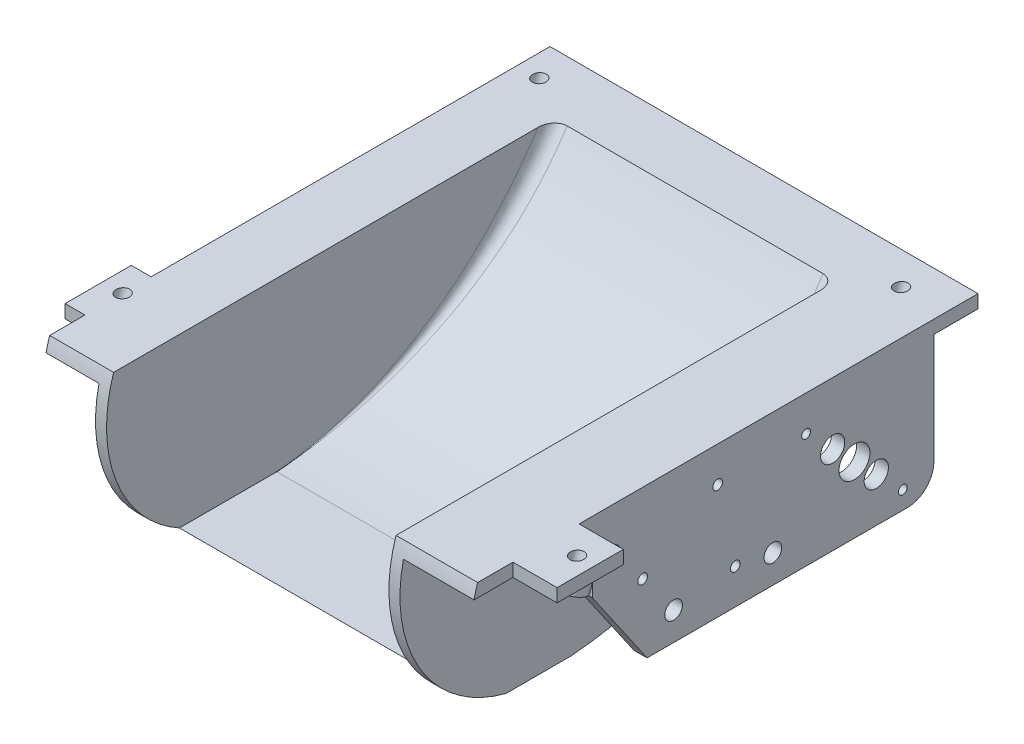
ISO-10303-21;
HEADER;
FILE_DESCRIPTION(('STEP AP214'),'2;1');
FILE_NAME('part.step','',(''),(''),'','','');
FILE_SCHEMA(('AUTOMOTIVE_DESIGN { 1 0 10303 214 1 1 1 1 }'));
ENDSEC;
DATA;
#1=APPLICATION_CONTEXT('core data for automotive mechanical design processes');
#2=APPLICATION_PROTOCOL_DEFINITION('international standard','automotive_design',2000,#1);
#3=PRODUCT_CONTEXT('',#1,'mechanical');
#4=PRODUCT('Part','Part','',(#3));
#5=PRODUCT_RELATED_PRODUCT_CATEGORY('part','',(#4));
#6=PRODUCT_DEFINITION_FORMATION('','',#4);
#7=PRODUCT_DEFINITION_CONTEXT('part definition',#1,'design');
#8=PRODUCT_DEFINITION('design','',#6,#7);
#9=PRODUCT_DEFINITION_SHAPE('','',#8);
#10=(LENGTH_UNIT() NAMED_UNIT(*) SI_UNIT(.MILLI.,.METRE.));
#11=(NAMED_UNIT(*) PLANE_ANGLE_UNIT() SI_UNIT($,.RADIAN.));
#12=(NAMED_UNIT(*) SI_UNIT($,.STERADIAN.) SOLID_ANGLE_UNIT());
#13=UNCERTAINTY_MEASURE_WITH_UNIT(LENGTH_MEASURE(1.E-05),#10,'distance_accuracy_value','');
#14=(GEOMETRIC_REPRESENTATION_CONTEXT(3) GLOBAL_UNCERTAINTY_ASSIGNED_CONTEXT((#13)) GLOBAL_UNIT_ASSIGNED_CONTEXT((#10,
#11,#12)) REPRESENTATION_CONTEXT('',''));
#15=CARTESIAN_POINT('',(0.,0.,0.));
#16=DIRECTION('',(0.,0.,1.));
#17=DIRECTION('',(1.,0.,0.));
#18=AXIS2_PLACEMENT_3D('',#15,#16,#17);
#19=CARTESIAN_POINT('',(34.5,7.,-71.));
#20=DIRECTION('',(0.,1.,0.));
#21=DIRECTION('',(0.,0.,1.));
#22=AXIS2_PLACEMENT_3D('',#19,#20,#21);
#23=PLANE('',#22);
#24=CARTESIAN_POINT('',(40.5,7.,-74.4865778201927));
#25=DIRECTION('',(0.,1.,0.));
#26=DIRECTION('',(0.,0.,1.));
#27=AXIS2_PLACEMENT_3D('',#24,#25,#26);
#28=ELLIPSE('',#27,3.7246222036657,3.5);
#29=CARTESIAN_POINT('',(40.5,7.,-70.761955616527));
#30=VERTEX_POINT('',#29);
#31=EDGE_CURVE('E1251',#30,#30,#28,.F.);
#32=ORIENTED_EDGE('',*,*,#31,.F.);
#33=EDGE_LOOP('',(#32));
#34=FACE_BOUND('',#33,.T.);
#35=CARTESIAN_POINT('',(-41.5,7.,-74.4865778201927));
#36=DIRECTION('',(0.,1.,0.));
#37=DIRECTION('',(0.,0.,1.));
#38=AXIS2_PLACEMENT_3D('',#35,#36,#37);
#39=ELLIPSE('',#38,3.7246222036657,3.5);
#40=CARTESIAN_POINT('',(-41.5,7.,-70.761955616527));
#41=VERTEX_POINT('',#40);
#42=EDGE_CURVE('E1221',#41,#41,#39,.F.);
#43=ORIENTED_EDGE('',*,*,#42,.F.);
#44=EDGE_LOOP('',(#43));
#45=FACE_BOUND('',#44,.T.);
#46=DIRECTION('',(0.,0.,-1.));
#47=VECTOR('',#46,1.);
#48=CARTESIAN_POINT('',(-38.,6.99999999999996,8.));
#49=LINE('',#48,#47);
#50=CARTESIAN_POINT('',(-38.,6.99999999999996,8.));
#51=VERTEX_POINT('',#50);
#52=CARTESIAN_POINT('',(-38.,6.99999999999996,-8.));
#53=VERTEX_POINT('',#52);
#54=EDGE_CURVE('E632',#51,#53,#49,.T.);
#55=ORIENTED_EDGE('',*,*,#54,.T.);
#56=DIRECTION('',(-1.,0.,0.));
#57=VECTOR('',#56,1.);
#58=CARTESIAN_POINT('',(-38.,6.99999999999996,-8.));
#59=LINE('',#58,#57);
#60=CARTESIAN_POINT('',(-41.,6.99999999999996,-8.));
#61=VERTEX_POINT('',#60);
#62=EDGE_CURVE('E642',#53,#61,#59,.T.);
#63=ORIENTED_EDGE('',*,*,#62,.T.);
#64=DIRECTION('',(0.,0.,-1.));
#65=VECTOR('',#64,1.);
#66=CARTESIAN_POINT('',(-41.,6.99999999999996,8.));
#67=LINE('',#66,#65);
#68=CARTESIAN_POINT('',(-41.,6.99999999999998,7.99999999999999));
#69=VERTEX_POINT('',#68);
#70=EDGE_CURVE('E621',#69,#61,#67,.T.);
#71=ORIENTED_EDGE('',*,*,#70,.F.);
#72=DIRECTION('',(-1.,0.,0.));
#73=VECTOR('',#72,1.);
#74=CARTESIAN_POINT('',(-38.,6.99999999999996,8.));
#75=LINE('',#74,#73);
#76=EDGE_CURVE('E645',#51,#69,#75,.T.);
#77=ORIENTED_EDGE('',*,*,#76,.F.);
#78=EDGE_LOOP('',(#55,#63,#71,#77));
#79=FACE_BOUND('',#78,.T.);
#80=DIRECTION('',(0.,0.,1.));
#81=VECTOR('',#80,1.);
#82=CARTESIAN_POINT('',(47.5,7.,4.39736830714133));
#83=LINE('',#82,#81);
#84=CARTESIAN_POINT('',(47.5,7.,-73.));
#85=VERTEX_POINT('',#84);
#86=CARTESIAN_POINT('',(47.5,7.,-60.));
#87=VERTEX_POINT('',#86);
#88=EDGE_CURVE('E706',#85,#87,#83,.T.);
#89=ORIENTED_EDGE('',*,*,#88,.T.);
#90=DIRECTION('',(1.,0.,0.));
#91=VECTOR('',#90,1.);
#92=CARTESIAN_POINT('',(27.2198901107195,7.,-60.));
#93=LINE('',#92,#91);
#94=CARTESIAN_POINT('',(34.5,7.,-60.));
#95=VERTEX_POINT('',#94);
#96=EDGE_CURVE('E513',#95,#87,#93,.T.);
#97=ORIENTED_EDGE('',*,*,#96,.F.);
#98=DIRECTION('',(0.,0.,-1.));
#99=VECTOR('',#98,1.);
#100=CARTESIAN_POINT('',(34.5,7.,32.001));
#101=LINE('',#100,#99);
#102=CARTESIAN_POINT('',(34.5,6.99999999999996,-71.));
#103=VERTEX_POINT('',#102);
#104=EDGE_CURVE('E476',#95,#103,#101,.T.);
#105=ORIENTED_EDGE('',*,*,#104,.T.);
#106=DIRECTION('',(-1.,0.,0.));
#107=VECTOR('',#106,1.);
#108=CARTESIAN_POINT('',(34.5,6.99999999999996,-71.));
#109=LINE('',#108,#107);
#110=CARTESIAN_POINT('',(32.,6.99999999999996,-71.));
#111=VERTEX_POINT('',#110);
#112=EDGE_CURVE('E867',#103,#111,#109,.T.);
#113=ORIENTED_EDGE('',*,*,#112,.T.);
#114=DIRECTION('',(1.,0.,0.));
#115=VECTOR('',#114,1.);
#116=CARTESIAN_POINT('',(-32.,6.99999999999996,-71.));
#117=LINE('',#116,#115);
#118=CARTESIAN_POINT('',(-32.,6.99999999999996,-71.));
#119=VERTEX_POINT('',#118);
#120=EDGE_CURVE('E974',#119,#111,#117,.T.);
#121=ORIENTED_EDGE('',*,*,#120,.F.);
#122=CARTESIAN_POINT('',(-34.5,6.99999999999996,-71.));
#123=VERTEX_POINT('',#122);
#124=EDGE_CURVE('E854',#119,#123,#109,.T.);
#125=ORIENTED_EDGE('',*,*,#124,.T.);
#126=DIRECTION('',(0.,0.,-1.));
#127=VECTOR('',#126,1.);
#128=CARTESIAN_POINT('',(-34.5,6.99999999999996,32.001));
#129=LINE('',#128,#127);
#130=CARTESIAN_POINT('',(-34.5,6.99999999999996,31.224989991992));
#131=VERTEX_POINT('',#130);
#132=EDGE_CURVE('E746',#131,#123,#129,.T.);
#133=ORIENTED_EDGE('',*,*,#132,.F.);
#134=DIRECTION('',(-1.,0.,0.));
#135=VECTOR('',#134,1.);
#136=CARTESIAN_POINT('',(34.5,6.99999999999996,31.224989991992));
#137=LINE('',#136,#135);
#138=CARTESIAN_POINT('',(-46.5,6.99999999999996,31.224989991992));
#139=VERTEX_POINT('',#138);
#140=EDGE_CURVE('E487',#139,#131,#137,.F.);
#141=ORIENTED_EDGE('',*,*,#140,.F.);
#142=DIRECTION('',(0.,0.,-1.));
#143=VECTOR('',#142,1.);
#144=CARTESIAN_POINT('',(-46.5,6.99999999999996,32.001));
#145=LINE('',#144,#143);
#146=CARTESIAN_POINT('',(-46.5,6.99999999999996,22.3973683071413));
#147=VERTEX_POINT('',#146);
#148=EDGE_CURVE('E1009',#139,#147,#145,.T.);
#149=ORIENTED_EDGE('',*,*,#148,.T.);
#150=DIRECTION('',(1.,0.,0.));
#151=VECTOR('',#150,1.);
#152=CARTESIAN_POINT('',(-51.,6.99999999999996,22.3973683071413));
#153=LINE('',#152,#151);
#154=CARTESIAN_POINT('',(-51.,6.99999999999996,22.3973683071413));
#155=VERTEX_POINT('',#154);
#156=EDGE_CURVE('E660',#155,#147,#153,.T.);
#157=ORIENTED_EDGE('',*,*,#156,.F.);
#158=DIRECTION('',(0.,0.,1.));
#159=VECTOR('',#158,1.);
#160=CARTESIAN_POINT('',(-51.,6.99999999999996,22.3973683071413));
#161=LINE('',#160,#159);
#162=CARTESIAN_POINT('',(-51.,6.99999999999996,7.39736830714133));
#163=VERTEX_POINT('',#162);
#164=EDGE_CURVE('E664',#163,#155,#161,.T.);
#165=ORIENTED_EDGE('',*,*,#164,.F.);
#166=DIRECTION('',(1.,0.,0.));
#167=VECTOR('',#166,1.);
#168=CARTESIAN_POINT('',(-51.,6.99999999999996,7.39736830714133));
#169=LINE('',#168,#167);
#170=CARTESIAN_POINT('',(-46.5,6.99999999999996,7.39736830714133));
#171=VERTEX_POINT('',#170);
#172=EDGE_CURVE('E663',#163,#171,#169,.T.);
#173=ORIENTED_EDGE('',*,*,#172,.T.);
#174=CARTESIAN_POINT('',(-46.5,6.99999999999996,-83.));
#175=VERTEX_POINT('',#174);
#176=EDGE_CURVE('E899',#171,#175,#145,.T.);
#177=ORIENTED_EDGE('',*,*,#176,.T.);
#178=DIRECTION('',(-1.,0.,0.));
#179=VECTOR('',#178,1.);
#180=CARTESIAN_POINT('',(34.5,7.,-83.));
#181=LINE('',#180,#179);
#182=CARTESIAN_POINT('',(50.5,7.,-83.));
#183=VERTEX_POINT('',#182);
#184=EDGE_CURVE('E825',#183,#175,#181,.T.);
#185=ORIENTED_EDGE('',*,*,#184,.F.);
#186=DIRECTION('',(0.,0.,-1.));
#187=VECTOR('',#186,1.);
#188=CARTESIAN_POINT('',(50.5,7.,32.001));
#189=LINE('',#188,#187);
#190=CARTESIAN_POINT('',(50.5,7.,-73.));
#191=VERTEX_POINT('',#190);
#192=EDGE_CURVE('E460',#191,#183,#189,.T.);
#193=ORIENTED_EDGE('',*,*,#192,.F.);
#194=DIRECTION('',(1.,0.,0.));
#195=VECTOR('',#194,1.);
#196=CARTESIAN_POINT('',(47.5,7.,-73.));
#197=LINE('',#196,#195);
#198=EDGE_CURVE('E728',#85,#191,#197,.T.);
#199=ORIENTED_EDGE('',*,*,#198,.F.);
#200=EDGE_LOOP('',(#89,#97,#105,#113,#121,#125,#133,#141,#149,#157,#165,#173,#177,#185,#193,#199));
#201=FACE_BOUND('',#200,.T.);
#202=CARTESIAN_POINT('',(-46.5,7.000000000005,14.9481238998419));
#203=DIRECTION('',(0.,1.,0.));
#204=DIRECTION('',(0.,0.,1.));
#205=AXIS2_PLACEMENT_3D('',#202,#203,#204);
#206=ELLIPSE('',#205,3.72462220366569,3.5);
#207=CARTESIAN_POINT('',(-46.5,7.000000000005,18.6727461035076));
#208=VERTEX_POINT('',#207);
#209=EDGE_CURVE('E11',#208,#208,#206,.F.);
#210=ORIENTED_EDGE('',*,*,#209,.F.);
#211=EDGE_LOOP('',(#210));
#212=FACE_BOUND('',#211,.T.);
#213=ADVANCED_FACE('F34',(#34,#45,#79,#201,#212),#23,.F.);
#214=CARTESIAN_POINT('',(34.5,7.,31.224989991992));
#215=VERTEX_POINT('',#214);
#216=CARTESIAN_POINT('',(34.5,7.,-22.5));
#217=VERTEX_POINT('',#216);
#218=EDGE_CURVE('E456',#215,#217,#101,.T.);
#219=ORIENTED_EDGE('',*,*,#218,.T.);
#220=DIRECTION('',(1.,0.,0.));
#221=VECTOR('',#220,1.);
#222=CARTESIAN_POINT('',(27.2198901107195,7.,-22.5));
#223=LINE('',#222,#221);
#224=CARTESIAN_POINT('',(47.5,7.,-22.5));
#225=VERTEX_POINT('',#224);
#226=EDGE_CURVE('E526',#217,#225,#223,.T.);
#227=ORIENTED_EDGE('',*,*,#226,.T.);
#228=CARTESIAN_POINT('',(47.5,7.,4.39736830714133));
#229=VERTEX_POINT('',#228);
#230=EDGE_CURVE('E696',#225,#229,#83,.T.);
#231=ORIENTED_EDGE('',*,*,#230,.T.);
#232=DIRECTION('',(1.,0.,0.));
#233=VECTOR('',#232,1.);
#234=CARTESIAN_POINT('',(47.5,7.,4.39736830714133));
#235=LINE('',#234,#233);
#236=CARTESIAN_POINT('',(50.5,7.,4.39736830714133));
#237=VERTEX_POINT('',#236);
#238=EDGE_CURVE('E727',#229,#237,#235,.T.);
#239=ORIENTED_EDGE('',*,*,#238,.T.);
#240=CARTESIAN_POINT('',(50.5,7.,7.39736830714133));
#241=VERTEX_POINT('',#240);
#242=EDGE_CURVE('E828',#241,#237,#189,.T.);
#243=ORIENTED_EDGE('',*,*,#242,.F.);
#244=DIRECTION('',(-1.,0.,0.));
#245=VECTOR('',#244,1.);
#246=CARTESIAN_POINT('',(60.5,7.,7.39736830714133));
#247=LINE('',#246,#245);
#248=CARTESIAN_POINT('',(60.5,7.,7.39736830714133));
#249=VERTEX_POINT('',#248);
#250=EDGE_CURVE('E788',#249,#241,#247,.T.);
#251=ORIENTED_EDGE('',*,*,#250,.F.);
#252=DIRECTION('',(0.,0.,-1.));
#253=VECTOR('',#252,1.);
#254=CARTESIAN_POINT('',(60.5,7.,22.3973683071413));
#255=LINE('',#254,#253);
#256=CARTESIAN_POINT('',(60.5,7.,22.3973683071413));
#257=VERTEX_POINT('',#256);
#258=EDGE_CURVE('E1098',#257,#249,#255,.T.);
#259=ORIENTED_EDGE('',*,*,#258,.F.);
#260=DIRECTION('',(-1.,0.,0.));
#261=VECTOR('',#260,1.);
#262=CARTESIAN_POINT('',(60.5,7.,22.3973683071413));
#263=LINE('',#262,#261);
#264=CARTESIAN_POINT('',(50.5,7.,22.3973683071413));
#265=VERTEX_POINT('',#264);
#266=EDGE_CURVE('E793',#257,#265,#263,.T.);
#267=ORIENTED_EDGE('',*,*,#266,.T.);
#268=CARTESIAN_POINT('',(50.5,7.,31.224989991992));
#269=VERTEX_POINT('',#268);
#270=EDGE_CURVE('E829',#269,#265,#189,.T.);
#271=ORIENTED_EDGE('',*,*,#270,.F.);
#272=DIRECTION('',(-1.,0.,0.));
#273=VECTOR('',#272,1.);
#274=CARTESIAN_POINT('',(34.5,7.,31.224989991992));
#275=LINE('',#274,#273);
#276=EDGE_CURVE('E840',#215,#269,#275,.F.);
#277=ORIENTED_EDGE('',*,*,#276,.F.);
#278=EDGE_LOOP('',(#219,#227,#231,#239,#243,#251,#259,#267,#271,#277));
#279=FACE_BOUND('',#278,.T.);
#280=CARTESIAN_POINT('',(56.5,7.000000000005,14.9481238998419));
#281=DIRECTION('',(0.,1.,0.));
#282=DIRECTION('',(0.,0.,1.));
#283=AXIS2_PLACEMENT_3D('',#280,#281,#282);
#284=ELLIPSE('',#283,3.72462220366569,3.5);
#285=CARTESIAN_POINT('',(56.5,7.000000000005,18.6727461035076));
#286=VERTEX_POINT('',#285);
#287=EDGE_CURVE('E42',#286,#286,#284,.F.);
#288=ORIENTED_EDGE('',*,*,#287,.F.);
#289=EDGE_LOOP('',(#288));
#290=FACE_BOUND('',#289,.T.);
#291=ADVANCED_FACE('F693',(#279,#290),#23,.F.);
#292=CARTESIAN_POINT('',(34.5,7.,-24.5));
#293=VERTEX_POINT('',#292);
#294=CARTESIAN_POINT('',(34.5,7.,-58.));
#295=VERTEX_POINT('',#294);
#296=EDGE_CURVE('E461',#293,#295,#101,.T.);
#297=ORIENTED_EDGE('',*,*,#296,.T.);
#298=DIRECTION('',(1.,0.,0.));
#299=VECTOR('',#298,1.);
#300=CARTESIAN_POINT('',(27.2198901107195,7.,-58.));
#301=LINE('',#300,#299);
#302=CARTESIAN_POINT('',(47.5,7.,-58.));
#303=VERTEX_POINT('',#302);
#304=EDGE_CURVE('E509',#295,#303,#301,.T.);
#305=ORIENTED_EDGE('',*,*,#304,.T.);
#306=CARTESIAN_POINT('',(47.5,7.,-24.5));
#307=VERTEX_POINT('',#306);
#308=EDGE_CURVE('E703',#303,#307,#83,.T.);
#309=ORIENTED_EDGE('',*,*,#308,.T.);
#310=DIRECTION('',(1.,0.,0.));
#311=VECTOR('',#310,1.);
#312=CARTESIAN_POINT('',(27.2198901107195,7.,-24.5));
#313=LINE('',#312,#311);
#314=EDGE_CURVE('E530',#293,#307,#313,.T.);
#315=ORIENTED_EDGE('',*,*,#314,.F.);
#316=EDGE_LOOP('',(#297,#305,#309,#315));
#317=FACE_BOUND('',#316,.T.);
#318=ADVANCED_FACE('F1056',(#317),#23,.F.);
#319=CARTESIAN_POINT('',(-46.5,6.99999999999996,32.001));
#320=DIRECTION('',(-1.,0.,0.));
#321=DIRECTION('',(0.,0.,1.));
#322=AXIS2_PLACEMENT_3D('',#319,#320,#321);
#323=PLANE('',#322);
#324=DIRECTION('',(0.,1.,0.));
#325=VECTOR('',#324,1.);
#326=CARTESIAN_POINT('',(-46.5,10.,22.3973683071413));
#327=LINE('',#326,#325);
#328=CARTESIAN_POINT('',(-46.5,10.,22.3973683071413));
#329=VERTEX_POINT('',#328);
#330=EDGE_CURVE('E641',#147,#329,#327,.T.);
#331=ORIENTED_EDGE('',*,*,#330,.F.);
#332=ORIENTED_EDGE('',*,*,#148,.F.);
#333=CARTESIAN_POINT('',(-46.5,0.,0.));
#334=DIRECTION('',(-1.,0.,0.));
#335=DIRECTION('',(0.,0.,1.));
#336=AXIS2_PLACEMENT_3D('',#333,#334,#335);
#337=CIRCLE('',#336,32.);
#338=CARTESIAN_POINT('',(-46.5,10.,30.3973683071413));
#339=VERTEX_POINT('',#338);
#340=EDGE_CURVE('E741',#339,#139,#337,.F.);
#341=ORIENTED_EDGE('',*,*,#340,.F.);
#342=DIRECTION('',(0.,0.,-1.));
#343=VECTOR('',#342,1.);
#344=CARTESIAN_POINT('',(-46.5,10.,32.001));
#345=LINE('',#344,#343);
#346=EDGE_CURVE('E743',#339,#329,#345,.T.);
#347=ORIENTED_EDGE('',*,*,#346,.T.);
#348=EDGE_LOOP('',(#331,#332,#341,#347));
#349=FACE_BOUND('',#348,.T.);
#350=ADVANCED_FACE('F1007',(#349),#323,.T.);
#351=CARTESIAN_POINT('',(50.5,10.,32.001));
#352=DIRECTION('',(1.,0.,0.));
#353=DIRECTION('',(0.,0.,-1.));
#354=AXIS2_PLACEMENT_3D('',#351,#352,#353);
#355=PLANE('',#354);
#356=DIRECTION('',(0.,-1.,0.));
#357=VECTOR('',#356,1.);
#358=CARTESIAN_POINT('',(50.5,10.,22.3973683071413));
#359=LINE('',#358,#357);
#360=CARTESIAN_POINT('',(50.5,10.,22.3973683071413));
#361=VERTEX_POINT('',#360);
#362=EDGE_CURVE('E764',#361,#265,#359,.T.);
#363=ORIENTED_EDGE('',*,*,#362,.F.);
#364=DIRECTION('',(0.,0.,-1.));
#365=VECTOR('',#364,1.);
#366=CARTESIAN_POINT('',(50.5,10.,32.001));
#367=LINE('',#366,#365);
#368=CARTESIAN_POINT('',(50.5,10.,30.3973683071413));
#369=VERTEX_POINT('',#368);
#370=EDGE_CURVE('E834',#369,#361,#367,.T.);
#371=ORIENTED_EDGE('',*,*,#370,.F.);
#372=CARTESIAN_POINT('',(50.5,0.,0.));
#373=DIRECTION('',(1.,0.,0.));
#374=DIRECTION('',(0.,0.,-1.));
#375=AXIS2_PLACEMENT_3D('',#372,#373,#374);
#376=CIRCLE('',#375,32.);
#377=EDGE_CURVE('E455',#269,#369,#376,.F.);
#378=ORIENTED_EDGE('',*,*,#377,.F.);
#379=ORIENTED_EDGE('',*,*,#270,.T.);
#380=EDGE_LOOP('',(#363,#371,#378,#379));
#381=FACE_BOUND('',#380,.T.);
#382=ADVANCED_FACE('F1069',(#381),#355,.T.);
#383=CARTESIAN_POINT('',(34.5,0.,0.));
#384=DIRECTION('',(-1.,0.,0.));
#385=DIRECTION('',(0.,0.,1.));
#386=AXIS2_PLACEMENT_3D('',#383,#384,#385);
#387=CYLINDRICAL_SURFACE('',#386,32.);
#388=CARTESIAN_POINT('',(-32.,0.,0.));
#389=DIRECTION('',(1.,0.,0.));
#390=DIRECTION('',(0.,0.,-1.));
#391=AXIS2_PLACEMENT_3D('',#388,#389,#390);
#392=CIRCLE('',#391,32.);
#393=CARTESIAN_POINT('',(-32.,10.,30.3973683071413));
#394=VERTEX_POINT('',#393);
#395=CARTESIAN_POINT('',(-32.,-28.,15.4919333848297));
#396=VERTEX_POINT('',#395);
#397=EDGE_CURVE('E382',#394,#396,#392,.T.);
#398=ORIENTED_EDGE('',*,*,#397,.F.);
#399=DIRECTION('',(-1.,0.,0.));
#400=VECTOR('',#399,1.);
#401=CARTESIAN_POINT('',(34.5,10.,30.3973683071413));
#402=LINE('',#401,#400);
#403=EDGE_CURVE('E857',#394,#339,#402,.T.);
#404=ORIENTED_EDGE('',*,*,#403,.T.);
#405=ORIENTED_EDGE('',*,*,#340,.T.);
#406=ORIENTED_EDGE('',*,*,#140,.T.);
#407=CARTESIAN_POINT('',(-34.5,0.,0.));
#408=DIRECTION('',(1.,0.,0.));
#409=DIRECTION('',(0.,0.,-1.));
#410=AXIS2_PLACEMENT_3D('',#407,#408,#409);
#411=CIRCLE('',#410,32.);
#412=CARTESIAN_POINT('',(-34.5,-31.,7.93725393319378));
#413=VERTEX_POINT('',#412);
#414=EDGE_CURVE('E874',#131,#413,#411,.T.);
#415=ORIENTED_EDGE('',*,*,#414,.T.);
#416=DIRECTION('',(-1.,0.,0.));
#417=VECTOR('',#416,1.);
#418=CARTESIAN_POINT('',(34.5,-31.,7.93725393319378));
#419=LINE('',#418,#417);
#420=CARTESIAN_POINT('',(34.5,-31.,7.93725393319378));
#421=VERTEX_POINT('',#420);
#422=EDGE_CURVE('E670',#421,#413,#419,.T.);
#423=ORIENTED_EDGE('',*,*,#422,.F.);
#424=CARTESIAN_POINT('',(34.5,0.,0.));
#425=DIRECTION('',(1.,0.,0.));
#426=DIRECTION('',(0.,0.,-1.));
#427=AXIS2_PLACEMENT_3D('',#424,#425,#426);
#428=CIRCLE('',#427,32.);
#429=EDGE_CURVE('E920',#215,#421,#428,.T.);
#430=ORIENTED_EDGE('',*,*,#429,.F.);
#431=ORIENTED_EDGE('',*,*,#276,.T.);
#432=ORIENTED_EDGE('',*,*,#377,.T.);
#433=CARTESIAN_POINT('',(32.,10.,30.3973683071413));
#434=VERTEX_POINT('',#433);
#435=EDGE_CURVE('E852',#369,#434,#402,.T.);
#436=ORIENTED_EDGE('',*,*,#435,.T.);
#437=CARTESIAN_POINT('',(32.,0.,0.));
#438=DIRECTION('',(1.,0.,0.));
#439=DIRECTION('',(0.,0.,-1.));
#440=AXIS2_PLACEMENT_3D('',#437,#438,#439);
#441=CIRCLE('',#440,32.);
#442=CARTESIAN_POINT('',(32.,-28.,15.4919333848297));
#443=VERTEX_POINT('',#442);
#444=EDGE_CURVE('E452',#434,#443,#441,.T.);
#445=ORIENTED_EDGE('',*,*,#444,.T.);
#446=DIRECTION('',(1.,0.,0.));
#447=VECTOR('',#446,1.);
#448=CARTESIAN_POINT('',(-32.,-28.,15.4919333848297));
#449=LINE('',#448,#447);
#450=EDGE_CURVE('E405',#396,#443,#449,.T.);
#451=ORIENTED_EDGE('',*,*,#450,.F.);
#452=EDGE_LOOP('',(#398,#404,#405,#406,#415,#423,#430,#431,#432,#436,#445,#451));
#453=FACE_BOUND('',#452,.T.);
#454=ADVANCED_FACE('F36',(#453),#387,.T.);
#455=CARTESIAN_POINT('',(34.5,10.,30.3973683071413));
#456=DIRECTION('',(0.,-1.,0.));
#457=DIRECTION('',(0.,0.,-1.));
#458=AXIS2_PLACEMENT_3D('',#455,#456,#457);
#459=PLANE('',#458);
#460=CARTESIAN_POINT('',(-46.5,10.,13.8562131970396));
#461=DIRECTION('',(0.,-1.,0.));
#462=DIRECTION('',(0.,0.,1.));
#463=AXIS2_PLACEMENT_3D('',#460,#461,#462);
#464=ELLIPSE('',#463,1.59626665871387,1.5);
#465=CARTESIAN_POINT('',(-46.5,10.,15.4524798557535));
#466=VERTEX_POINT('',#465);
#467=EDGE_CURVE('E1300',#466,#466,#464,.T.);
#468=ORIENTED_EDGE('',*,*,#467,.T.);
#469=EDGE_LOOP('',(#468));
#470=FACE_BOUND('',#469,.T.);
#471=CARTESIAN_POINT('',(56.5,10.,13.8562131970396));
#472=DIRECTION('',(0.,-1.,0.));
#473=DIRECTION('',(0.,0.,1.));
#474=AXIS2_PLACEMENT_3D('',#471,#472,#473);
#475=ELLIPSE('',#474,1.59626665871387,1.5);
#476=CARTESIAN_POINT('',(56.5,10.,15.4524798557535));
#477=VERTEX_POINT('',#476);
#478=EDGE_CURVE('E1304',#477,#477,#475,.T.);
#479=ORIENTED_EDGE('',*,*,#478,.T.);
#480=EDGE_LOOP('',(#479));
#481=FACE_BOUND('',#480,.T.);
#482=CARTESIAN_POINT('',(-41.5,10.,-75.5784885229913));
#483=DIRECTION('',(0.,-1.,0.));
#484=DIRECTION('',(0.,0.,1.));
#485=AXIS2_PLACEMENT_3D('',#482,#483,#484);
#486=ELLIPSE('',#485,1.59626665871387,1.5);
#487=CARTESIAN_POINT('',(-41.5,10.,-73.9822218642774));
#488=VERTEX_POINT('',#487);
#489=EDGE_CURVE('E1317',#488,#488,#486,.T.);
#490=ORIENTED_EDGE('',*,*,#489,.T.);
#491=EDGE_LOOP('',(#490));
#492=FACE_BOUND('',#491,.T.);
#493=CARTESIAN_POINT('',(40.5,10.,-75.5784885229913));
#494=DIRECTION('',(0.,-1.,0.));
#495=DIRECTION('',(0.,0.,1.));
#496=AXIS2_PLACEMENT_3D('',#493,#494,#495);
#497=ELLIPSE('',#496,1.59626665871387,1.5);
#498=CARTESIAN_POINT('',(40.5,10.,-73.9822218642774));
#499=VERTEX_POINT('',#498);
#500=EDGE_CURVE('E1218',#499,#499,#497,.T.);
#501=ORIENTED_EDGE('',*,*,#500,.T.);
#502=EDGE_LOOP('',(#501));
#503=FACE_BOUND('',#502,.T.);
#504=DIRECTION('',(0.,0.,1.));
#505=VECTOR('',#504,1.);
#506=CARTESIAN_POINT('',(-32.,10.,30.3973683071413));
#507=LINE('',#506,#505);
#508=CARTESIAN_POINT('',(-32.,10.,-65.7976119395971));
#509=VERTEX_POINT('',#508);
#510=EDGE_CURVE('E381',#509,#394,#507,.T.);
#511=ORIENTED_EDGE('',*,*,#510,.F.);
#512=CARTESIAN_POINT('',(-29.000066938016,10.,-69.3642536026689));
#513=CARTESIAN_POINT('',(-29.0348099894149,9.99999952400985,-69.3642540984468));
#514=CARTESIAN_POINT('',(-29.0695525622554,9.99998488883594,-69.3635306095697));
#515=CARTESIAN_POINT('',(-29.1392337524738,9.99993886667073,-69.3606382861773));
#516=CARTESIAN_POINT('',(-29.1741719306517,9.99990735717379,-69.3584588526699));
#517=CARTESIAN_POINT('',(-29.2441787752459,9.99983926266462,-69.3526367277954));
#518=CARTESIAN_POINT('',(-29.2792465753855,9.99980264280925,-69.3489836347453));
#519=CARTESIAN_POINT('',(-29.3494453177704,9.99973305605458,-69.3402009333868));
#520=CARTESIAN_POINT('',(-29.3845749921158,9.99970011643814,-69.3350611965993));
#521=CARTESIAN_POINT('',(-29.4548282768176,9.99964444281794,-69.3232958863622));
#522=CARTESIAN_POINT('',(-29.4899502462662,9.99962177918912,-69.3166605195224));
#523=CARTESIAN_POINT('',(-29.5601176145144,9.99959068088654,-69.3018989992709));
#524=CARTESIAN_POINT('',(-29.5951610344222,9.9995823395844,-69.2937634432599));
#525=CARTESIAN_POINT('',(-29.6650999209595,9.99958135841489,-69.276001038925));
#526=CARTESIAN_POINT('',(-29.6999931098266,9.99958881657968,-69.2663652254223));
#527=CARTESIAN_POINT('',(-29.7695597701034,9.99961827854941,-69.2456063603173));
#528=CARTESIAN_POINT('',(-29.8042307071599,9.99964036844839,-69.2344748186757));
#529=CARTESIAN_POINT('',(-29.8732812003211,9.99969526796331,-69.2107331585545));
#530=CARTESIAN_POINT('',(-29.9076580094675,9.99972813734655,-69.1981150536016));
#531=CARTESIAN_POINT('',(-29.9760492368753,9.99979813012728,-69.1714135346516));
#532=CARTESIAN_POINT('',(-30.0100607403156,9.9998352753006,-69.1573226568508));
#533=CARTESIAN_POINT('',(-30.0776513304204,9.99990458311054,-69.1276934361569));
#534=CARTESIAN_POINT('',(-30.111227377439,9.99993671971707,-69.1121481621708));
#535=CARTESIAN_POINT('',(-30.1778791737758,9.99998461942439,-69.0796324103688));
#536=CARTESIAN_POINT('',(-30.2109518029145,10.000000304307,-69.0626555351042));
#537=CARTESIAN_POINT('',(-30.2726155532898,9.999999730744,-69.0294130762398));
#538=CARTESIAN_POINT('',(-30.3012840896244,9.99998694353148,-69.013290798));
#539=CARTESIAN_POINT('',(-30.35854159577,9.99994701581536,-68.9797573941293));
#540=CARTESIAN_POINT('',(-30.3871201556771,9.99991962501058,-68.9623284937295));
#541=CARTESIAN_POINT('',(-30.4441405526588,9.99986016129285,-68.9261709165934));
#542=CARTESIAN_POINT('',(-30.4725714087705,9.99982801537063,-68.9074249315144));
#543=CARTESIAN_POINT('',(-30.529237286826,9.99976657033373,-68.8686250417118));
#544=CARTESIAN_POINT('',(-30.5574608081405,9.99973732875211,-68.848554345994));
#545=CARTESIAN_POINT('',(-30.6136509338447,9.99968743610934,-68.807100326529));
#546=CARTESIAN_POINT('',(-30.6416055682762,9.99966693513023,-68.7857007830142));
#547=CARTESIAN_POINT('',(-30.6971952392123,9.99963819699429,-68.74158789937));
#548=CARTESIAN_POINT('',(-30.7248178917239,9.99963016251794,-68.7188589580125));
#549=CARTESIAN_POINT('',(-30.7796796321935,9.99962787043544,-68.6720898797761));
#550=CARTESIAN_POINT('',(-30.8069059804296,9.99963383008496,-68.6480348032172));
#551=CARTESIAN_POINT('',(-30.8609102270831,9.99965872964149,-68.5986199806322));
#552=CARTESIAN_POINT('',(-30.8876750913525,9.9996778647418,-68.573245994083));
#553=CARTESIAN_POINT('',(-30.9406909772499,9.99972598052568,-68.5212039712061));
#554=CARTESIAN_POINT('',(-30.966928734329,9.99975510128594,-68.4945224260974));
#555=CARTESIAN_POINT('',(-31.0188248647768,9.99981735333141,-68.4398800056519));
#556=CARTESIAN_POINT('',(-31.0444698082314,9.99985053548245,-68.4119063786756));
#557=CARTESIAN_POINT('',(-31.0951153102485,9.99991336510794,-68.3546990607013));
#558=CARTESIAN_POINT('',(-31.1201023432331,9.99994295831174,-68.3254533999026));
#559=CARTESIAN_POINT('',(-31.169367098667,9.99998529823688,-68.2657244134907));
#560=CARTESIAN_POINT('',(-31.1936312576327,9.99999781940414,-68.2352298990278));
#561=CARTESIAN_POINT('',(-31.2377090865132,10.0000018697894,-68.1778271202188));
#562=CARTESIAN_POINT('',(-31.2576641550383,9.99999613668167,-68.1510272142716));
#563=CARTESIAN_POINT('',(-31.2973117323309,9.99998507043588,-68.096137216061));
#564=CARTESIAN_POINT('',(-31.3169830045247,9.99997975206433,-68.0680317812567));
#565=CARTESIAN_POINT('',(-31.3559875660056,9.99997173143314,-68.0105295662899));
#566=CARTESIAN_POINT('',(-31.3752992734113,9.99996909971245,-67.9811181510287));
#567=CARTESIAN_POINT('',(-31.4135084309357,9.99996878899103,-67.921008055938));
#568=CARTESIAN_POINT('',(-31.4323840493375,9.99997123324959,-67.8902955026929));
#569=CARTESIAN_POINT('',(-31.4696430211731,9.99997915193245,-67.8275917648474));
#570=CARTESIAN_POINT('',(-31.4880043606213,9.99998469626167,-67.7955874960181));
#571=CARTESIAN_POINT('',(-31.5241557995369,9.99999577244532,-67.730315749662));
#572=CARTESIAN_POINT('',(-31.5419237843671,10.0000013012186,-67.6970360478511));
#573=CARTESIAN_POINT('',(-31.589304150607,9.99999772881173,-67.6049434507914));
#574=CARTESIAN_POINT('',(-31.6178726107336,9.99997464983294,-67.5455897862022));
#575=CARTESIAN_POINT('',(-31.674390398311,9.99994187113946,-67.4199770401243));
#576=CARTESIAN_POINT('',(-31.7020419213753,9.99993359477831,-67.3535843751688));
#577=CARTESIAN_POINT('',(-31.7557452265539,9.99998262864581,-67.2139585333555));
#578=CARTESIAN_POINT('',(-31.7814875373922,10.0000452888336,-67.1406058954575));
#579=CARTESIAN_POINT('',(-31.8194702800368,9.99997229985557,-67.021286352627));
#580=CARTESIAN_POINT('',(-31.8330717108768,9.9999042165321,-66.9757474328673));
#581=CARTESIAN_POINT('',(-31.854747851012,9.99982940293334,-66.8982729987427));
#582=CARTESIAN_POINT('',(-31.8632373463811,9.99981025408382,-66.8664532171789));
#583=CARTESIAN_POINT('',(-31.8809218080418,9.9997967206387,-66.7968242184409));
#584=CARTESIAN_POINT('',(-31.8899650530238,9.99980746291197,-66.7589763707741));
#585=CARTESIAN_POINT('',(-31.908257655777,9.99985526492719,-66.6773391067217));
#586=CARTESIAN_POINT('',(-31.9173340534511,9.99989603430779,-66.6335109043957));
#587=CARTESIAN_POINT('',(-31.935126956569,9.99996246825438,-66.5400076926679));
#588=CARTESIAN_POINT('',(-31.9436518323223,9.99998556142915,-66.4902961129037));
#589=CARTESIAN_POINT('',(-31.957894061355,10.0000125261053,-66.3972019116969));
#590=CARTESIAN_POINT('',(-31.9638337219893,10.0000185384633,-66.3538531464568));
#591=CARTESIAN_POINT('',(-31.973974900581,10.0000473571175,-66.2702130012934));
#592=CARTESIAN_POINT('',(-31.9782726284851,10.0000688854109,-66.2299331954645));
#593=CARTESIAN_POINT('',(-31.988562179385,10.0001020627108,-66.1183696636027));
#594=CARTESIAN_POINT('',(-31.9933302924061,10.000093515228,-66.0469692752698));
#595=CARTESIAN_POINT('',(-31.9987685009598,10.0000537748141,-65.9162326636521));
#596=CARTESIAN_POINT('',(-31.9999995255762,10.0000266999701,-65.8569192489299));
#597=CARTESIAN_POINT('',(-32.,9.99999999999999,-65.7976119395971));
#598=B_SPLINE_CURVE_WITH_KNOTS('',3,(#512,#513,#514,#515,#516,#517,#518,#519,#520,#521,#522,
#523,#524,#525,#526,#527,#528,#529,#530,#531,#532,#533,#534,#535,#536,#537,#538,#539,#540,#541,
#542,#543,#544,#545,#546,#547,#548,#549,#550,#551,#552,#553,#554,#555,#556,#557,#558,#559,#560,
#561,#562,#563,#564,#565,#566,#567,#568,#569,#570,#571,#572,#573,#574,#575,#576,#577,#578,#579,
#580,#581,#582,#583,#584,#585,#586,#587,#588,#589,#590,#591,#592,#593,#594,#595,#596,#597),
.UNSPECIFIED.,.F.,.F.,(4,2,2,2,2,2,2,2,2,2,2,2,2,2,2,2,2,2,2,2,2,2,2,2,2,2,2,2,2,2,2,2,2,2,2,2,
2,2,2,2,2,2,4),(0.,0.104220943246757,0.209208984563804,0.314951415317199,0.421431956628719,
0.528631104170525,0.636526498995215,0.745093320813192,0.854304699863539,0.964132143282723,
1.07454597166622,1.18551576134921,1.29701078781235,1.39566349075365,1.49606414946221,
1.59820729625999,1.70208291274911,1.80767657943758,1.9149696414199,2.02393939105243,
2.13455926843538,2.24679908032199,2.36062523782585,2.4760010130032,2.59288681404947,
2.69311250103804,2.79601424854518,2.90155316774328,3.00968480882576,3.12035924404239,
3.2335211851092,3.43103763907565,3.64669333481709,3.87976282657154,4.02231581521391,
4.12110522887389,4.23782912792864,4.37208041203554,4.52335792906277,4.65459793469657,
4.77610890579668,4.99068905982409,5.1686114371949),.UNSPECIFIED.);
#599=CARTESIAN_POINT('',(-29.0000669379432,10.,-69.3642538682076));
#600=VERTEX_POINT('',#599);
#601=EDGE_CURVE('E1171',#509,#600,#598,.F.);
#602=ORIENTED_EDGE('',*,*,#601,.T.);
#603=DIRECTION('',(1.,0.,0.));
#604=VECTOR('',#603,1.);
#605=CARTESIAN_POINT('',(-32.,10.,-69.3642538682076));
#606=LINE('',#605,#604);
#607=CARTESIAN_POINT('',(29.0000669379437,10.,-69.3642538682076));
#608=VERTEX_POINT('',#607);
#609=EDGE_CURVE('E395',#600,#608,#606,.T.);
#610=ORIENTED_EDGE('',*,*,#609,.T.);
#611=CARTESIAN_POINT('',(32.,10.,-65.7976119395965));
#612=CARTESIAN_POINT('',(31.9999995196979,10.0000272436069,-65.8570742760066));
#613=CARTESIAN_POINT('',(31.9987620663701,10.000054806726,-65.9165427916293));
#614=CARTESIAN_POINT('',(31.9932911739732,10.0000953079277,-66.0477223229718));
#615=CARTESIAN_POINT('',(31.9884887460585,10.0001040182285,-66.1194101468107));
#616=CARTESIAN_POINT('',(31.9781194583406,10.0000702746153,-66.2314540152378));
#617=CARTESIAN_POINT('',(31.973785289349,10.0000483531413,-66.2719279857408));
#618=CARTESIAN_POINT('',(31.9635540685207,10.0000188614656,-66.35599047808));
#619=CARTESIAN_POINT('',(31.9575592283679,10.0000125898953,-66.3995671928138));
#620=CARTESIAN_POINT('',(31.9432554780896,9.99998562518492,-66.4926746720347));
#621=CARTESIAN_POINT('',(31.9347389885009,9.99996301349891,-66.542173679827));
#622=CARTESIAN_POINT('',(31.9169671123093,9.999897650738,-66.6353245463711));
#623=CARTESIAN_POINT('',(31.9079002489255,9.99985742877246,-66.6790124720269));
#624=CARTESIAN_POINT('',(31.8896213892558,9.99981016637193,-66.7604434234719));
#625=CARTESIAN_POINT('',(31.8805797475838,9.9997995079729,-66.798224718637));
#626=CARTESIAN_POINT('',(31.8628851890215,9.99981270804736,-66.867795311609));
#627=CARTESIAN_POINT('',(31.854381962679,9.99983156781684,-66.8996227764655));
#628=CARTESIAN_POINT('',(31.8326070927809,9.99990537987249,-66.9773453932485));
#629=CARTESIAN_POINT('',(31.8189122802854,9.99997275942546,-67.0231223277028));
#630=CARTESIAN_POINT('',(31.7807767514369,10.0000443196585,-67.1426965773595));
#631=CARTESIAN_POINT('',(31.7549820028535,9.99998238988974,-67.2160672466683));
#632=CARTESIAN_POINT('',(31.7011697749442,9.99993383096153,-67.3557340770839));
#633=CARTESIAN_POINT('',(31.6734614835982,9.99994193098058,-67.4221497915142));
#634=CARTESIAN_POINT('',(31.6168255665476,9.9999746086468,-67.5478135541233));
#635=CARTESIAN_POINT('',(31.5881955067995,9.99999774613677,-67.6071953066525));
#636=CARTESIAN_POINT('',(31.5406062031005,10.0000012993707,-67.6995379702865));
#637=CARTESIAN_POINT('',(31.5226861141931,9.99999565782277,-67.733038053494));
#638=CARTESIAN_POINT('',(31.4862210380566,9.99998432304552,-67.7987340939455));
#639=CARTESIAN_POINT('',(31.467698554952,9.99997863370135,-67.8309425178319));
#640=CARTESIAN_POINT('',(31.4301093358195,9.9999705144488,-67.8940377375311));
#641=CARTESIAN_POINT('',(31.4110650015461,9.99996801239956,-67.9249378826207));
#642=CARTESIAN_POINT('',(31.3725119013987,9.99996833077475,-67.9854061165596));
#643=CARTESIAN_POINT('',(31.3530253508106,9.9999710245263,-68.0149883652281));
#644=CARTESIAN_POINT('',(31.3136660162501,9.99997925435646,-68.0728151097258));
#645=CARTESIAN_POINT('',(31.2938151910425,9.99998471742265,-68.1010745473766));
#646=CARTESIAN_POINT('',(31.2538047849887,9.99999602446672,-68.1562554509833));
#647=CARTESIAN_POINT('',(31.2336668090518,10.0000018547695,-68.1831925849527));
#648=CARTESIAN_POINT('',(31.1894013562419,9.99999785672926,-68.2405971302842));
#649=CARTESIAN_POINT('',(31.1651405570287,9.99998545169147,-68.2709619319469));
#650=CARTESIAN_POINT('',(31.1158874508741,9.99994353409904,-68.3304363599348));
#651=CARTESIAN_POINT('',(31.0909085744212,9.99991424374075,-68.3595571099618));
#652=CARTESIAN_POINT('',(31.0402838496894,9.99985205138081,-68.416519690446));
#653=CARTESIAN_POINT('',(31.0146513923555,9.99981920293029,-68.4443734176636));
#654=CARTESIAN_POINT('',(30.9627842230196,9.99975757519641,-68.498781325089));
#655=CARTESIAN_POINT('',(30.9365628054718,9.99972874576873,-68.5253481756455));
#656=CARTESIAN_POINT('',(30.8835831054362,9.99968110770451,-68.5771662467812));
#657=CARTESIAN_POINT('',(30.8568379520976,9.99966216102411,-68.6024308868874));
#658=CARTESIAN_POINT('',(30.8028761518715,9.99963750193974,-68.6516325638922));
#659=CARTESIAN_POINT('',(30.7756724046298,9.99963159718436,-68.6755837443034));
#660=CARTESIAN_POINT('',(30.7208584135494,9.99963385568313,-68.7221506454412));
#661=CARTESIAN_POINT('',(30.6932607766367,9.99964180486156,-68.7447812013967));
#662=CARTESIAN_POINT('',(30.6377232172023,9.9996702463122,-68.7887029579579));
#663=CARTESIAN_POINT('',(30.6097955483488,9.99969053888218,-68.8100096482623));
#664=CARTESIAN_POINT('',(30.5536609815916,9.99973992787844,-68.8512835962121));
#665=CARTESIAN_POINT('',(30.5254659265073,9.99976887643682,-68.8712669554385));
#666=CARTESIAN_POINT('',(30.4688581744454,9.99982970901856,-68.9098977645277));
#667=CARTESIAN_POINT('',(30.4404568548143,9.99986153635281,-68.9285618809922));
#668=CARTESIAN_POINT('',(30.3834963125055,9.99992041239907,-68.9645612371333));
#669=CARTESIAN_POINT('',(30.3549479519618,9.9999475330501,-68.9819136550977));
#670=CARTESIAN_POINT('',(30.2977512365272,9.99998707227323,-69.015299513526));
#671=CARTESIAN_POINT('',(30.2691131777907,9.99999973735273,-69.0313505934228));
#672=CARTESIAN_POINT('',(30.2075618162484,10.0000002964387,-69.0644205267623));
#673=CARTESIAN_POINT('',(30.1745725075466,9.99998479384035,-69.0812982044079));
#674=CARTESIAN_POINT('',(30.1080918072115,9.99993744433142,-69.1136237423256));
#675=CARTESIAN_POINT('',(30.0746034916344,9.99990567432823,-69.1290779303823));
#676=CARTESIAN_POINT('',(30.0071922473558,9.99983715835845,-69.1585334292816));
#677=CARTESIAN_POINT('',(29.9732723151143,9.99980043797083,-69.1725415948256));
#678=CARTESIAN_POINT('',(29.905067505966,9.99973124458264,-69.1990863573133));
#679=CARTESIAN_POINT('',(29.8707855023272,9.99969875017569,-69.2116303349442));
#680=CARTESIAN_POINT('',(29.8019272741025,9.99964447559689,-69.2352325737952));
#681=CARTESIAN_POINT('',(29.767353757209,9.99962263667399,-69.2462987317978));
#682=CARTESIAN_POINT('',(29.6979839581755,9.99959350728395,-69.2669357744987));
#683=CARTESIAN_POINT('',(29.6631901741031,9.99958613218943,-69.2765150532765));
#684=CARTESIAN_POINT('',(29.593451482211,9.99958709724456,-69.2941733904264));
#685=CARTESIAN_POINT('',(29.5585088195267,9.99959534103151,-69.3022613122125));
#686=CARTESIAN_POINT('',(29.4885437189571,9.99962607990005,-69.3169365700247));
#687=CARTESIAN_POINT('',(29.4535232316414,9.99964848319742,-69.3235332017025));
#688=CARTESIAN_POINT('',(29.38347304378,9.99970351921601,-69.335229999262));
#689=CARTESIAN_POINT('',(29.348444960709,9.99973608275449,-69.340339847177));
#690=CARTESIAN_POINT('',(29.2784489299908,9.99980487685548,-69.3490716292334));
#691=CARTESIAN_POINT('',(29.2434822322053,9.9998410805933,-69.3527035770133));
#692=CARTESIAN_POINT('',(29.1736765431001,9.99990840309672,-69.3584921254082));
#693=CARTESIAN_POINT('',(29.1388384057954,9.99993955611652,-69.3606590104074));
#694=CARTESIAN_POINT('',(29.069355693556,9.99998505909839,-69.3635347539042));
#695=CARTESIAN_POINT('',(29.0347115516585,9.9999995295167,-69.3642540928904));
#696=CARTESIAN_POINT('',(29.0000669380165,9.99999999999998,-69.3642536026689));
#697=B_SPLINE_CURVE_WITH_KNOTS('',3,(#611,#612,#613,#614,#615,#616,#617,#618,#619,#620,#621,
#622,#623,#624,#625,#626,#627,#628,#629,#630,#631,#632,#633,#634,#635,#636,#637,#638,#639,#640,
#641,#642,#643,#644,#645,#646,#647,#648,#649,#650,#651,#652,#653,#654,#655,#656,#657,#658,#659,
#660,#661,#662,#663,#664,#665,#666,#667,#668,#669,#670,#671,#672,#673,#674,#675,#676,#677,#678,
#679,#680,#681,#682,#683,#684,#685,#686,#687,#688,#689,#690,#691,#692,#693,#694,#695,#696),
.UNSPECIFIED.,.F.,.F.,(4,2,2,2,2,2,2,2,2,2,2,2,2,2,2,2,2,2,2,2,2,2,2,2,2,2,2,2,2,2,2,2,2,2,2,2,
2,2,2,2,2,2,4),(0.,0.178387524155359,0.393833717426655,0.515935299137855,0.647874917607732,
0.798520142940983,0.932353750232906,1.04888242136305,1.1477047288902,1.29102156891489,
1.524194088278,1.7399788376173,1.93765118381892,2.0516109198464,2.16305685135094,2.271932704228,
2.37818769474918,2.4817766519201,2.58266010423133,2.69923553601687,2.81431085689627,
2.92784689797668,3.03980732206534,3.15015889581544,3.25887174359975,3.36591958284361,
3.47127994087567,3.57493435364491,3.6768685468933,3.77707260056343,3.87554109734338,
3.98667822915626,4.09729472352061,4.20736012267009,4.31684426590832,4.42571772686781,
4.53395224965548,4.64152117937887,4.74839988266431,4.85456615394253,4.96000060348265,
5.06468702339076,5.16861272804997),.UNSPECIFIED.);
#698=CARTESIAN_POINT('',(32.,10.,-65.7976119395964));
#699=VERTEX_POINT('',#698);
#700=EDGE_CURVE('E58',#608,#699,#697,.F.);
#701=ORIENTED_EDGE('',*,*,#700,.T.);
#702=DIRECTION('',(0.,0.,1.));
#703=VECTOR('',#702,1.);
#704=CARTESIAN_POINT('',(32.,10.,30.3973683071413));
#705=LINE('',#704,#703);
#706=EDGE_CURVE('E440',#699,#434,#705,.T.);
#707=ORIENTED_EDGE('',*,*,#706,.T.);
#708=ORIENTED_EDGE('',*,*,#435,.F.);
#709=ORIENTED_EDGE('',*,*,#370,.T.);
#710=DIRECTION('',(-1.,0.,0.));
#711=VECTOR('',#710,1.);
#712=CARTESIAN_POINT('',(60.5,10.,22.3973683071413));
#713=LINE('',#712,#711);
#714=CARTESIAN_POINT('',(60.5,10.,22.3973683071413));
#715=VERTEX_POINT('',#714);
#716=EDGE_CURVE('E759',#715,#361,#713,.T.);
#717=ORIENTED_EDGE('',*,*,#716,.F.);
#718=DIRECTION('',(0.,0.,1.));
#719=VECTOR('',#718,1.);
#720=CARTESIAN_POINT('',(60.5,10.,22.3973683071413));
#721=LINE('',#720,#719);
#722=CARTESIAN_POINT('',(60.5,10.,7.39736830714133));
#723=VERTEX_POINT('',#722);
#724=EDGE_CURVE('E763',#723,#715,#721,.T.);
#725=ORIENTED_EDGE('',*,*,#724,.F.);
#726=DIRECTION('',(-1.,0.,0.));
#727=VECTOR('',#726,1.);
#728=CARTESIAN_POINT('',(60.5,10.,7.39736830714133));
#729=LINE('',#728,#727);
#730=CARTESIAN_POINT('',(50.5,10.,7.39736830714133));
#731=VERTEX_POINT('',#730);
#732=EDGE_CURVE('E762',#723,#731,#729,.T.);
#733=ORIENTED_EDGE('',*,*,#732,.T.);
#734=CARTESIAN_POINT('',(50.5,10.,-83.));
#735=VERTEX_POINT('',#734);
#736=EDGE_CURVE('E784',#731,#735,#367,.T.);
#737=ORIENTED_EDGE('',*,*,#736,.T.);
#738=DIRECTION('',(-1.,0.,0.));
#739=VECTOR('',#738,1.);
#740=CARTESIAN_POINT('',(34.5,10.,-83.));
#741=LINE('',#740,#739);
#742=CARTESIAN_POINT('',(-46.5,10.,-83.));
#743=VERTEX_POINT('',#742);
#744=EDGE_CURVE('E846',#735,#743,#741,.T.);
#745=ORIENTED_EDGE('',*,*,#744,.T.);
#746=CARTESIAN_POINT('',(-46.5,10.,7.39736830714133));
#747=VERTEX_POINT('',#746);
#748=EDGE_CURVE('E753',#747,#743,#345,.T.);
#749=ORIENTED_EDGE('',*,*,#748,.F.);
#750=DIRECTION('',(1.,0.,0.));
#751=VECTOR('',#750,1.);
#752=CARTESIAN_POINT('',(-51.,10.,7.39736830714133));
#753=LINE('',#752,#751);
#754=CARTESIAN_POINT('',(-51.,10.,7.39736830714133));
#755=VERTEX_POINT('',#754);
#756=EDGE_CURVE('E1016',#755,#747,#753,.T.);
#757=ORIENTED_EDGE('',*,*,#756,.F.);
#758=DIRECTION('',(0.,0.,-1.));
#759=VECTOR('',#758,1.);
#760=CARTESIAN_POINT('',(-51.,10.,22.3973683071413));
#761=LINE('',#760,#759);
#762=CARTESIAN_POINT('',(-51.,10.,22.3973683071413));
#763=VERTEX_POINT('',#762);
#764=EDGE_CURVE('E1012',#763,#755,#761,.T.);
#765=ORIENTED_EDGE('',*,*,#764,.F.);
#766=DIRECTION('',(1.,0.,0.));
#767=VECTOR('',#766,1.);
#768=CARTESIAN_POINT('',(-51.,10.,22.3973683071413));
#769=LINE('',#768,#767);
#770=EDGE_CURVE('E769',#763,#329,#769,.T.);
#771=ORIENTED_EDGE('',*,*,#770,.T.);
#772=ORIENTED_EDGE('',*,*,#346,.F.);
#773=ORIENTED_EDGE('',*,*,#403,.F.);
#774=EDGE_LOOP('',(#511,#602,#610,#701,#707,#708,#709,#717,#725,#733,#737,#745,#749,#757,#765,
#771,#772,#773));
#775=FACE_BOUND('',#774,.T.);
#776=ADVANCED_FACE('F844',(#470,#481,#492,#503,#775),#459,.F.);
#777=CARTESIAN_POINT('',(34.5,-27.5070982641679,-25.));
#778=DIRECTION('',(0.,0.,-1.));
#779=DIRECTION('',(0.,1.,0.));
#780=AXIS2_PLACEMENT_3D('',#777,#778,#779);
#781=PLANE('',#780);
#782=DIRECTION('',(0.,-1.,0.));
#783=VECTOR('',#782,1.);
#784=CARTESIAN_POINT('',(-32.,-27.5070982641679,-25.));
#785=LINE('',#784,#783);
#786=CARTESIAN_POINT('',(-32.,-27.5070982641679,-25.));
#787=VERTEX_POINT('',#786);
#788=CARTESIAN_POINT('',(-32.,-31.,-25.));
#789=VERTEX_POINT('',#788);
#790=EDGE_CURVE('E967',#787,#789,#785,.T.);
#791=ORIENTED_EDGE('',*,*,#790,.F.);
#792=DIRECTION('',(-1.,0.,0.));
#793=VECTOR('',#792,1.);
#794=CARTESIAN_POINT('',(34.5,-27.5070982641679,-25.));
#795=LINE('',#794,#793);
#796=CARTESIAN_POINT('',(-34.5,-27.5070982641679,-25.));
#797=VERTEX_POINT('',#796);
#798=EDGE_CURVE('E908',#787,#797,#795,.T.);
#799=ORIENTED_EDGE('',*,*,#798,.T.);
#800=DIRECTION('',(0.,-1.,0.));
#801=VECTOR('',#800,1.);
#802=CARTESIAN_POINT('',(-34.5,-27.5070982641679,-25.));
#803=LINE('',#802,#801);
#804=CARTESIAN_POINT('',(-34.5,-31.,-25.));
#805=VERTEX_POINT('',#804);
#806=EDGE_CURVE('E977',#797,#805,#803,.T.);
#807=ORIENTED_EDGE('',*,*,#806,.T.);
#808=DIRECTION('',(-1.,0.,0.));
#809=VECTOR('',#808,1.);
#810=CARTESIAN_POINT('',(34.5,-31.,-25.));
#811=LINE('',#810,#809);
#812=EDGE_CURVE('E941',#789,#805,#811,.T.);
#813=ORIENTED_EDGE('',*,*,#812,.F.);
#814=EDGE_LOOP('',(#791,#799,#807,#813));
#815=FACE_BOUND('',#814,.T.);
#816=ADVANCED_FACE('F989',(#815),#781,.F.);
#817=CARTESIAN_POINT('',(34.5,-31.,-25.));
#818=DIRECTION('',(0.,1.,0.));
#819=DIRECTION('',(0.,0.,1.));
#820=AXIS2_PLACEMENT_3D('',#817,#818,#819);
#821=PLANE('',#820);
#822=DIRECTION('',(0.,0.,-1.));
#823=VECTOR('',#822,1.);
#824=CARTESIAN_POINT('',(-32.,-31.,-25.));
#825=LINE('',#824,#823);
#826=CARTESIAN_POINT('',(-32.,-31.,-55.));
#827=VERTEX_POINT('',#826);
#828=EDGE_CURVE('E969',#789,#827,#825,.T.);
#829=ORIENTED_EDGE('',*,*,#828,.F.);
#830=ORIENTED_EDGE('',*,*,#812,.T.);
#831=DIRECTION('',(0.,0.,-1.));
#832=VECTOR('',#831,1.);
#833=CARTESIAN_POINT('',(-34.5,-31.,-25.));
#834=LINE('',#833,#832);
#835=CARTESIAN_POINT('',(-34.5,-31.,-55.));
#836=VERTEX_POINT('',#835);
#837=EDGE_CURVE('E881',#805,#836,#834,.T.);
#838=ORIENTED_EDGE('',*,*,#837,.T.);
#839=DIRECTION('',(-1.,0.,0.));
#840=VECTOR('',#839,1.);
#841=CARTESIAN_POINT('',(34.5,-31.,-55.));
#842=LINE('',#841,#840);
#843=EDGE_CURVE('E928',#827,#836,#842,.T.);
#844=ORIENTED_EDGE('',*,*,#843,.F.);
#845=EDGE_LOOP('',(#829,#830,#838,#844));
#846=FACE_BOUND('',#845,.T.);
#847=ADVANCED_FACE('F980',(#846),#821,.F.);
#848=CARTESIAN_POINT('',(34.5,-31.,-55.));
#849=DIRECTION('',(0.,0.388057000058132,0.921635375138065));
#850=DIRECTION('',(0.,-0.921635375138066,0.388057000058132));
#851=AXIS2_PLACEMENT_3D('',#848,#849,#850);
#852=PLANE('',#851);
#853=DIRECTION('',(0.,0.921635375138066,-0.388057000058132));
#854=VECTOR('',#853,1.);
#855=CARTESIAN_POINT('',(-32.,-31.,-55.));
#856=LINE('',#855,#854);
#857=EDGE_CURVE('E971',#827,#119,#856,.T.);
#858=ORIENTED_EDGE('',*,*,#857,.F.);
#859=ORIENTED_EDGE('',*,*,#843,.T.);
#860=DIRECTION('',(0.,0.921635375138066,-0.388057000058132));
#861=VECTOR('',#860,1.);
#862=CARTESIAN_POINT('',(-34.5,-31.,-55.));
#863=LINE('',#862,#861);
#864=EDGE_CURVE('E877',#836,#123,#863,.T.);
#865=ORIENTED_EDGE('',*,*,#864,.T.);
#866=ORIENTED_EDGE('',*,*,#124,.F.);
#867=EDGE_LOOP('',(#858,#859,#865,#866));
#868=FACE_BOUND('',#867,.T.);
#869=ADVANCED_FACE('F984',(#868),#852,.F.);
#870=CARTESIAN_POINT('',(34.5,53.7332857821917,0.));
#871=DIRECTION('',(-1.,0.,0.));
#872=DIRECTION('',(0.,0.,1.));
#873=AXIS2_PLACEMENT_3D('',#870,#871,#872);
#874=CYLINDRICAL_SURFACE('',#873,85.);
#875=CARTESIAN_POINT('',(34.5,-27.5070982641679,-25.));
#876=VERTEX_POINT('',#875);
#877=CARTESIAN_POINT('',(32.,-27.5070982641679,-25.));
#878=VERTEX_POINT('',#877);
#879=EDGE_CURVE('E904',#876,#878,#795,.T.);
#880=ORIENTED_EDGE('',*,*,#879,.F.);
#881=CARTESIAN_POINT('',(34.5,53.7332857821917,0.));
#882=DIRECTION('',(1.,0.,0.));
#883=DIRECTION('',(0.,0.,-1.));
#884=AXIS2_PLACEMENT_3D('',#881,#882,#883);
#885=CIRCLE('',#884,85.);
#886=CARTESIAN_POINT('',(34.5,-31.,-6.72831929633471));
#887=VERTEX_POINT('',#886);
#888=EDGE_CURVE('E997',#887,#876,#885,.T.);
#889=ORIENTED_EDGE('',*,*,#888,.F.);
#890=DIRECTION('',(-1.,0.,0.));
#891=VECTOR('',#890,1.);
#892=CARTESIAN_POINT('',(34.5,-31.,-6.72831929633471));
#893=LINE('',#892,#891);
#894=CARTESIAN_POINT('',(-34.5,-31.,-6.72831929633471));
#895=VERTEX_POINT('',#894);
#896=EDGE_CURVE('E863',#887,#895,#893,.T.);
#897=ORIENTED_EDGE('',*,*,#896,.T.);
#898=CARTESIAN_POINT('',(-34.5,53.7332857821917,0.));
#899=DIRECTION('',(1.,0.,0.));
#900=DIRECTION('',(0.,0.,-1.));
#901=AXIS2_PLACEMENT_3D('',#898,#899,#900);
#902=CIRCLE('',#901,85.);
#903=EDGE_CURVE('E905',#895,#797,#902,.T.);
#904=ORIENTED_EDGE('',*,*,#903,.T.);
#905=ORIENTED_EDGE('',*,*,#798,.F.);
#906=CARTESIAN_POINT('',(-32.,53.7332857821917,0.));
#907=DIRECTION('',(-1.,0.,0.));
#908=DIRECTION('',(0.,0.,-1.));
#909=AXIS2_PLACEMENT_3D('',#906,#907,#908);
#910=CIRCLE('',#909,85.);
#911=EDGE_CURVE('E965',#119,#787,#910,.T.);
#912=ORIENTED_EDGE('',*,*,#911,.F.);
#913=ORIENTED_EDGE('',*,*,#120,.T.);
#914=CARTESIAN_POINT('',(32.,53.7332857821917,0.));
#915=DIRECTION('',(-1.,0.,0.));
#916=DIRECTION('',(0.,0.,-1.));
#917=AXIS2_PLACEMENT_3D('',#914,#915,#916);
#918=CIRCLE('',#917,85.);
#919=EDGE_CURVE('E398',#111,#878,#918,.T.);
#920=ORIENTED_EDGE('',*,*,#919,.T.);
#921=EDGE_LOOP('',(#880,#889,#897,#904,#905,#912,#913,#920));
#922=FACE_BOUND('',#921,.T.);
#923=ADVANCED_FACE('F993',(#922),#874,.T.);
#924=CARTESIAN_POINT('',(34.5,-31.,7.93725393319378));
#925=DIRECTION('',(0.,1.,0.));
#926=DIRECTION('',(0.,0.,1.));
#927=AXIS2_PLACEMENT_3D('',#924,#925,#926);
#928=PLANE('',#927);
#929=DIRECTION('',(0.,0.,-1.));
#930=VECTOR('',#929,1.);
#931=CARTESIAN_POINT('',(-34.5,-31.,7.93725393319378));
#932=LINE('',#931,#930);
#933=EDGE_CURVE('E902',#413,#895,#932,.T.);
#934=ORIENTED_EDGE('',*,*,#933,.T.);
#935=ORIENTED_EDGE('',*,*,#896,.F.);
#936=DIRECTION('',(0.,0.,-1.));
#937=VECTOR('',#936,1.);
#938=CARTESIAN_POINT('',(34.5,-31.,7.93725393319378));
#939=LINE('',#938,#937);
#940=EDGE_CURVE('E923',#421,#887,#939,.T.);
#941=ORIENTED_EDGE('',*,*,#940,.F.);
#942=ORIENTED_EDGE('',*,*,#422,.T.);
#943=EDGE_LOOP('',(#934,#935,#941,#942));
#944=FACE_BOUND('',#943,.T.);
#945=ADVANCED_FACE('F1850',(#944),#928,.F.);
#946=CARTESIAN_POINT('',(34.5,7.,-83.));
#947=DIRECTION('',(0.,0.,1.));
#948=DIRECTION('',(1.,0.,0.));
#949=AXIS2_PLACEMENT_3D('',#946,#947,#948);
#950=PLANE('',#949);
#951=ORIENTED_EDGE('',*,*,#184,.T.);
#952=DIRECTION('',(0.,1.,0.));
#953=VECTOR('',#952,1.);
#954=CARTESIAN_POINT('',(-46.5,6.99999999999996,-83.));
#955=LINE('',#954,#953);
#956=EDGE_CURVE('E731',#175,#743,#955,.T.);
#957=ORIENTED_EDGE('',*,*,#956,.T.);
#958=ORIENTED_EDGE('',*,*,#744,.F.);
#959=DIRECTION('',(0.,-1.,0.));
#960=VECTOR('',#959,1.);
#961=CARTESIAN_POINT('',(50.5,10.,-83.));
#962=LINE('',#961,#960);
#963=EDGE_CURVE('E466',#735,#183,#962,.T.);
#964=ORIENTED_EDGE('',*,*,#963,.T.);
#965=EDGE_LOOP('',(#951,#957,#958,#964));
#966=FACE_BOUND('',#965,.T.);
#967=ADVANCED_FACE('F850',(#966),#950,.F.);
#968=CARTESIAN_POINT('',(34.5,0.,0.));
#969=DIRECTION('',(1.,0.,0.));
#970=DIRECTION('',(0.,0.,-1.));
#971=AXIS2_PLACEMENT_3D('',#968,#969,#970);
#972=PLANE('',#971);
#973=DIRECTION('',(0.,1.,0.));
#974=VECTOR('',#973,1.);
#975=CARTESIAN_POINT('',(34.5,7.,-58.));
#976=LINE('',#975,#974);
#977=CARTESIAN_POINT('',(34.5,0.,-58.));
#978=VERTEX_POINT('',#977);
#979=EDGE_CURVE('E508',#978,#295,#976,.T.);
#980=ORIENTED_EDGE('',*,*,#979,.T.);
#981=ORIENTED_EDGE('',*,*,#296,.F.);
#982=DIRECTION('',(0.,-1.,0.));
#983=VECTOR('',#982,1.);
#984=CARTESIAN_POINT('',(34.5,7.,-24.5));
#985=LINE('',#984,#983);
#986=CARTESIAN_POINT('',(34.5,0.,-24.5));
#987=VERTEX_POINT('',#986);
#988=EDGE_CURVE('E523',#293,#987,#985,.T.);
#989=ORIENTED_EDGE('',*,*,#988,.T.);
#990=DIRECTION('',(0.,0.,1.));
#991=VECTOR('',#990,1.);
#992=CARTESIAN_POINT('',(34.5,0.,-22.5));
#993=LINE('',#992,#991);
#994=CARTESIAN_POINT('',(34.5,0.,-22.5));
#995=VERTEX_POINT('',#994);
#996=EDGE_CURVE('E528',#987,#995,#993,.T.);
#997=ORIENTED_EDGE('',*,*,#996,.T.);
#998=DIRECTION('',(0.,1.,0.));
#999=VECTOR('',#998,1.);
#1000=CARTESIAN_POINT('',(34.5,7.,-22.5));
#1001=LINE('',#1000,#999);
#1002=EDGE_CURVE('E525',#995,#217,#1001,.T.);
#1003=ORIENTED_EDGE('',*,*,#1002,.T.);
#1004=ORIENTED_EDGE('',*,*,#218,.F.);
#1005=ORIENTED_EDGE('',*,*,#429,.T.);
#1006=ORIENTED_EDGE('',*,*,#940,.T.);
#1007=ORIENTED_EDGE('',*,*,#888,.T.);
#1008=DIRECTION('',(0.,-1.,0.));
#1009=VECTOR('',#1008,1.);
#1010=CARTESIAN_POINT('',(34.5,-27.5070982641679,-25.));
#1011=LINE('',#1010,#1009);
#1012=CARTESIAN_POINT('',(34.5,-31.,-25.));
#1013=VERTEX_POINT('',#1012);
#1014=EDGE_CURVE('E880',#876,#1013,#1011,.T.);
#1015=ORIENTED_EDGE('',*,*,#1014,.T.);
#1016=DIRECTION('',(0.,0.,-1.));
#1017=VECTOR('',#1016,1.);
#1018=CARTESIAN_POINT('',(34.5,-31.,-25.));
#1019=LINE('',#1018,#1017);
#1020=CARTESIAN_POINT('',(34.5,-31.,-55.));
#1021=VERTEX_POINT('',#1020);
#1022=EDGE_CURVE('E929',#1013,#1021,#1019,.T.);
#1023=ORIENTED_EDGE('',*,*,#1022,.T.);
#1024=DIRECTION('',(0.,0.921635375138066,-0.388057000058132));
#1025=VECTOR('',#1024,1.);
#1026=CARTESIAN_POINT('',(34.5,-31.,-55.));
#1027=LINE('',#1026,#1025);
#1028=EDGE_CURVE('E926',#1021,#103,#1027,.T.);
#1029=ORIENTED_EDGE('',*,*,#1028,.T.);
#1030=ORIENTED_EDGE('',*,*,#104,.F.);
#1031=DIRECTION('',(0.,-1.,0.));
#1032=VECTOR('',#1031,1.);
#1033=CARTESIAN_POINT('',(34.5,7.,-60.));
#1034=LINE('',#1033,#1032);
#1035=CARTESIAN_POINT('',(34.5,0.,-60.));
#1036=VERTEX_POINT('',#1035);
#1037=EDGE_CURVE('E506',#95,#1036,#1034,.T.);
#1038=ORIENTED_EDGE('',*,*,#1037,.T.);
#1039=DIRECTION('',(0.,0.,1.));
#1040=VECTOR('',#1039,1.);
#1041=CARTESIAN_POINT('',(34.5,0.,-58.));
#1042=LINE('',#1041,#1040);
#1043=EDGE_CURVE('E511',#1036,#978,#1042,.T.);
#1044=ORIENTED_EDGE('',*,*,#1043,.T.);
#1045=EDGE_LOOP('',(#980,#981,#989,#997,#1003,#1004,#1005,#1006,#1007,#1015,#1023,#1029,#1030,
#1038,#1044));
#1046=FACE_BOUND('',#1045,.T.);
#1047=CARTESIAN_POINT('',(34.5,0.,0.));
#1048=DIRECTION('',(1.,0.,0.));
#1049=DIRECTION('',(0.,0.,-1.));
#1050=AXIS2_PLACEMENT_3D('',#1047,#1048,#1049);
#1051=CIRCLE('',#1050,2.);
#1052=CARTESIAN_POINT('',(34.5,0.,-2.));
#1053=VERTEX_POINT('',#1052);
#1054=EDGE_CURVE('E538',#1053,#1053,#1051,.T.);
#1055=ORIENTED_EDGE('',*,*,#1054,.F.);
#1056=EDGE_LOOP('',(#1055));
#1057=FACE_BOUND('',#1056,.T.);
#1058=CARTESIAN_POINT('',(34.5,-17.6093734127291,-14.0057119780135));
#1059=DIRECTION('',(1.,0.,0.));
#1060=DIRECTION('',(0.,0.,-1.));
#1061=AXIS2_PLACEMENT_3D('',#1058,#1059,#1060);
#1062=CIRCLE('',#1061,2.00000000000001);
#1063=CARTESIAN_POINT('',(34.5,-17.6093734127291,-16.0057119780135));
#1064=VERTEX_POINT('',#1063);
#1065=EDGE_CURVE('E544',#1064,#1064,#1062,.T.);
#1066=ORIENTED_EDGE('',*,*,#1065,.F.);
#1067=EDGE_LOOP('',(#1066));
#1068=FACE_BOUND('',#1067,.T.);
#1069=CARTESIAN_POINT('',(34.5,-17.6093734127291,-36.5057119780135));
#1070=DIRECTION('',(1.,0.,0.));
#1071=DIRECTION('',(0.,0.,-1.));
#1072=AXIS2_PLACEMENT_3D('',#1069,#1070,#1071);
#1073=CIRCLE('',#1072,2.);
#1074=CARTESIAN_POINT('',(34.5,-17.6093734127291,-38.5057119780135));
#1075=VERTEX_POINT('',#1074);
#1076=EDGE_CURVE('E550',#1075,#1075,#1073,.T.);
#1077=ORIENTED_EDGE('',*,*,#1076,.F.);
#1078=EDGE_LOOP('',(#1077));
#1079=FACE_BOUND('',#1078,.T.);
#1080=ADVANCED_FACE('F686',(#1046,#1057,#1068,#1079),#972,.T.);
#1081=CARTESIAN_POINT('',(-34.5,0.,0.));
#1082=DIRECTION('',(1.,0.,0.));
#1083=DIRECTION('',(0.,0.,-1.));
#1084=AXIS2_PLACEMENT_3D('',#1081,#1082,#1083);
#1085=PLANE('',#1084);
#1086=CARTESIAN_POINT('',(-34.5,0.,0.));
#1087=DIRECTION('',(1.,0.,0.));
#1088=DIRECTION('',(0.,0.,-1.));
#1089=AXIS2_PLACEMENT_3D('',#1086,#1087,#1088);
#1090=CIRCLE('',#1089,2.);
#1091=CARTESIAN_POINT('',(-34.5,0.,-2.));
#1092=VERTEX_POINT('',#1091);
#1093=EDGE_CURVE('E613',#1092,#1092,#1090,.T.);
#1094=ORIENTED_EDGE('',*,*,#1093,.T.);
#1095=EDGE_LOOP('',(#1094));
#1096=FACE_BOUND('',#1095,.T.);
#1097=ORIENTED_EDGE('',*,*,#414,.F.);
#1098=ORIENTED_EDGE('',*,*,#132,.T.);
#1099=ORIENTED_EDGE('',*,*,#864,.F.);
#1100=ORIENTED_EDGE('',*,*,#837,.F.);
#1101=ORIENTED_EDGE('',*,*,#806,.F.);
#1102=ORIENTED_EDGE('',*,*,#903,.F.);
#1103=ORIENTED_EDGE('',*,*,#933,.F.);
#1104=EDGE_LOOP('',(#1097,#1098,#1099,#1100,#1101,#1102,#1103));
#1105=FACE_BOUND('',#1104,.T.);
#1106=ADVANCED_FACE('F900',(#1096,#1105),#1085,.F.);
#1107=ORIENTED_EDGE('',*,*,#879,.T.);
#1108=DIRECTION('',(0.,-1.,0.));
#1109=VECTOR('',#1108,1.);
#1110=CARTESIAN_POINT('',(32.,-27.5070982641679,-25.));
#1111=LINE('',#1110,#1109);
#1112=CARTESIAN_POINT('',(32.,-31.,-25.));
#1113=VERTEX_POINT('',#1112);
#1114=EDGE_CURVE('E956',#878,#1113,#1111,.T.);
#1115=ORIENTED_EDGE('',*,*,#1114,.T.);
#1116=EDGE_CURVE('E913',#1013,#1113,#811,.T.);
#1117=ORIENTED_EDGE('',*,*,#1116,.F.);
#1118=ORIENTED_EDGE('',*,*,#1014,.F.);
#1119=EDGE_LOOP('',(#1107,#1115,#1117,#1118));
#1120=FACE_BOUND('',#1119,.T.);
#1121=ADVANCED_FACE('F955',(#1120),#781,.F.);
#1122=ORIENTED_EDGE('',*,*,#1116,.T.);
#1123=DIRECTION('',(0.,0.,-1.));
#1124=VECTOR('',#1123,1.);
#1125=CARTESIAN_POINT('',(32.,-31.,-25.));
#1126=LINE('',#1125,#1124);
#1127=CARTESIAN_POINT('',(32.,-31.,-55.));
#1128=VERTEX_POINT('',#1127);
#1129=EDGE_CURVE('E954',#1113,#1128,#1126,.T.);
#1130=ORIENTED_EDGE('',*,*,#1129,.T.);
#1131=EDGE_CURVE('E934',#1021,#1128,#842,.T.);
#1132=ORIENTED_EDGE('',*,*,#1131,.F.);
#1133=ORIENTED_EDGE('',*,*,#1022,.F.);
#1134=EDGE_LOOP('',(#1122,#1130,#1132,#1133));
#1135=FACE_BOUND('',#1134,.T.);
#1136=ADVANCED_FACE('F953',(#1135),#821,.F.);
#1137=ORIENTED_EDGE('',*,*,#1131,.T.);
#1138=DIRECTION('',(0.,0.921635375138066,-0.388057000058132));
#1139=VECTOR('',#1138,1.);
#1140=CARTESIAN_POINT('',(32.,-31.,-55.));
#1141=LINE('',#1140,#1139);
#1142=EDGE_CURVE('E960',#1128,#111,#1141,.T.);
#1143=ORIENTED_EDGE('',*,*,#1142,.T.);
#1144=ORIENTED_EDGE('',*,*,#112,.F.);
#1145=ORIENTED_EDGE('',*,*,#1028,.F.);
#1146=EDGE_LOOP('',(#1137,#1143,#1144,#1145));
#1147=FACE_BOUND('',#1146,.T.);
#1148=ADVANCED_FACE('F1001',(#1147),#852,.F.);
#1149=CARTESIAN_POINT('',(-32.,53.7332857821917,0.));
#1150=DIRECTION('',(1.,0.,0.));
#1151=DIRECTION('',(0.,0.,-1.));
#1152=AXIS2_PLACEMENT_3D('',#1149,#1150,#1151);
#1153=PLANE('',#1152);
#1154=ORIENTED_EDGE('',*,*,#911,.T.);
#1155=ORIENTED_EDGE('',*,*,#790,.T.);
#1156=ORIENTED_EDGE('',*,*,#828,.T.);
#1157=ORIENTED_EDGE('',*,*,#857,.T.);
#1158=EDGE_LOOP('',(#1154,#1155,#1156,#1157));
#1159=FACE_BOUND('',#1158,.T.);
#1160=ADVANCED_FACE('F986',(#1159),#1153,.T.);
#1161=CARTESIAN_POINT('',(32.,53.7332857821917,0.));
#1162=DIRECTION('',(1.,0.,0.));
#1163=DIRECTION('',(0.,0.,-1.));
#1164=AXIS2_PLACEMENT_3D('',#1161,#1162,#1163);
#1165=PLANE('',#1164);
#1166=ORIENTED_EDGE('',*,*,#919,.F.);
#1167=ORIENTED_EDGE('',*,*,#1142,.F.);
#1168=ORIENTED_EDGE('',*,*,#1129,.F.);
#1169=ORIENTED_EDGE('',*,*,#1114,.F.);
#1170=EDGE_LOOP('',(#1166,#1167,#1168,#1169));
#1171=FACE_BOUND('',#1170,.T.);
#1172=ADVANCED_FACE('F426',(#1171),#1165,.F.);
#1173=CARTESIAN_POINT('',(-32.,53.7332857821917,0.));
#1174=DIRECTION('',(1.,0.,0.));
#1175=DIRECTION('',(0.,0.,-1.));
#1176=AXIS2_PLACEMENT_3D('',#1173,#1174,#1175);
#1177=CYLINDRICAL_SURFACE('',#1176,82.);
#1178=DIRECTION('',(1.,0.,0.));
#1179=VECTOR('',#1178,1.);
#1180=CARTESIAN_POINT('',(-32.,-28.,-6.60832771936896));
#1181=LINE('',#1180,#1179);
#1182=CARTESIAN_POINT('',(-31.9501834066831,-28.,-6.60832771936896));
#1183=VERTEX_POINT('',#1182);
#1184=CARTESIAN_POINT('',(31.9501834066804,-28.,-6.60832771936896));
#1185=VERTEX_POINT('',#1184);
#1186=EDGE_CURVE('E399',#1183,#1185,#1181,.T.);
#1187=ORIENTED_EDGE('',*,*,#1186,.T.);
#1188=CARTESIAN_POINT('',(29.,13.2912333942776,-71.3333049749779));
#1189=CARTESIAN_POINT('',(29.,12.5265763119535,-70.8997865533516));
#1190=CARTESIAN_POINT('',(29.,11.7688905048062,-70.4539719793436));
#1191=CARTESIAN_POINT('',(29.,10.2682448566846,-69.5382114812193));
#1192=CARTESIAN_POINT('',(28.9993299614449,9.52528504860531,-69.0682655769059));
#1193=CARTESIAN_POINT('',(29.0107147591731,7.31964701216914,-67.622959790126));
#1194=CARTESIAN_POINT('',(29.0319511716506,5.88021864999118,-66.6121199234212));
#1195=CARTESIAN_POINT('',(29.1306995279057,1.66385067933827,-63.4439606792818));
#1196=CARTESIAN_POINT('',(29.2432505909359,-1.01101719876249,-61.1508259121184));
#1197=CARTESIAN_POINT('',(29.5303209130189,-6.0445141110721,-56.2403490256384));
#1198=CARTESIAN_POINT('',(29.7048401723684,-8.40312019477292,-53.623029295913));
#1199=CARTESIAN_POINT('',(30.0843774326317,-12.7651171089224,-48.1074280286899));
#1200=CARTESIAN_POINT('',(30.2893954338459,-14.7684880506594,-45.2091716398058));
#1201=CARTESIAN_POINT('',(30.6984607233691,-18.3869078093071,-39.1795851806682));
#1202=CARTESIAN_POINT('',(30.9025080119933,-20.0019401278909,-36.0482826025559));
#1203=CARTESIAN_POINT('',(31.2781624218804,-22.8169923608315,-29.6043431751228));
#1204=CARTESIAN_POINT('',(31.4497695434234,-24.0169994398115,-26.2917357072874));
#1205=CARTESIAN_POINT('',(31.7290741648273,-25.98216853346,-19.5399222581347));
#1206=CARTESIAN_POINT('',(31.836771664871,-26.7473215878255,-16.1007470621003));
#1207=CARTESIAN_POINT('',(31.9267836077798,-27.5594318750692,-10.8896561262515));
#1208=CARTESIAN_POINT('',(31.9448652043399,-27.7742557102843,-9.14391789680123));
#1209=CARTESIAN_POINT('',(31.9511537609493,-28.0120059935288,-6.51766147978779));
#1210=CARTESIAN_POINT('',(31.95,-28.0771788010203,-5.64096829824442));
#1211=CARTESIAN_POINT('',(31.95,-28.1793024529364,-3.88593969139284));
#1212=CARTESIAN_POINT('',(31.95,-28.2162532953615,-3.00760430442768));
#1213=CARTESIAN_POINT('',(31.95,-28.2390740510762,-2.12890191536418));
#1214=(BOUNDED_CURVE() B_SPLINE_CURVE(3,(#1188,#1189,#1190,#1191,#1192,#1193,#1194,#1195,#1196,
#1197,#1198,#1199,#1200,#1201,#1202,#1203,#1204,#1205,#1206,#1207,#1208,#1209,#1210,#1211,#1212,
#1213),.UNSPECIFIED.,.F.,.F.) B_SPLINE_CURVE_WITH_KNOTS((4,2,2,2,2,2,2,2,2,2,2,2,4),
(4.73835411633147,4.77051260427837,4.80267109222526,4.86698806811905,4.99562201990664,
5.12425597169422,5.25288992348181,5.38152387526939,5.51015782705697,5.63879177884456,
5.70310875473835,5.73526724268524,5.76742573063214),
.UNSPECIFIED.) CURVE() GEOMETRIC_REPRESENTATION_ITEM() RATIONAL_B_SPLINE_CURVE((1.,1.,1.,1.,1.,
1.,1.,1.,1.,1.,1.,1.,1.,1.,1.,1.,1.,1.,1.,1.,1.,1.,1.,1.,1.,1.)) REPRESENTATION_ITEM(''));
#1215=EDGE_CURVE('E1120',#1185,#608,#1214,.F.);
#1216=ORIENTED_EDGE('',*,*,#1215,.T.);
#1217=ORIENTED_EDGE('',*,*,#609,.F.);
#1218=CARTESIAN_POINT('',(-31.95,-28.2390740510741,-2.1289019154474));
#1219=CARTESIAN_POINT('',(-31.95,-28.2162532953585,-3.00760430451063));
#1220=CARTESIAN_POINT('',(-31.95,-28.1793024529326,-3.88593969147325));
#1221=CARTESIAN_POINT('',(-31.95,-28.0771788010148,-5.64096829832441));
#1222=CARTESIAN_POINT('',(-31.9511537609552,-28.0120059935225,-6.5176614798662));
#1223=CARTESIAN_POINT('',(-31.9448652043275,-27.7742557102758,-9.14391789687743));
#1224=CARTESIAN_POINT('',(-31.9267836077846,-27.5594318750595,-10.8896561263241));
#1225=CARTESIAN_POINT('',(-31.8367716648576,-26.7473215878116,-16.1007470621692));
#1226=CARTESIAN_POINT('',(-31.7290741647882,-25.9821685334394,-19.5399222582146));
#1227=CARTESIAN_POINT('',(-31.4497695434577,-24.0169994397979,-26.2917357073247));
#1228=CARTESIAN_POINT('',(-31.2781624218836,-22.8169923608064,-29.6043431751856));
#1229=CARTESIAN_POINT('',(-30.9025080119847,-20.0019401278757,-36.0482826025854));
#1230=CARTESIAN_POINT('',(-30.6984607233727,-18.3869078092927,-39.1795851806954));
#1231=CARTESIAN_POINT('',(-30.2893954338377,-14.7684880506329,-45.2091716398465));
#1232=CARTESIAN_POINT('',(-30.08437743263,-12.765117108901,-48.107428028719));
#1233=CARTESIAN_POINT('',(-29.704840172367,-8.40312019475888,-53.6230292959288));
#1234=CARTESIAN_POINT('',(-29.5303209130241,-6.04451411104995,-56.2403490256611));
#1235=CARTESIAN_POINT('',(-29.2432505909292,-1.01101719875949,-61.1508259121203));
#1236=CARTESIAN_POINT('',(-29.1306995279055,1.6638506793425,-63.4439606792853));
#1237=CARTESIAN_POINT('',(-29.0319511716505,5.88021864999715,-66.6121199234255));
#1238=CARTESIAN_POINT('',(-29.0107147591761,7.31964701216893,-67.6229597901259));
#1239=CARTESIAN_POINT('',(-28.9993299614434,9.52528504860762,-69.0682655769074));
#1240=CARTESIAN_POINT('',(-29.,10.2682448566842,-69.538211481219));
#1241=CARTESIAN_POINT('',(-29.,11.7688905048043,-70.4539719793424));
#1242=CARTESIAN_POINT('',(-29.,12.5265763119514,-70.8997865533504));
#1243=CARTESIAN_POINT('',(-29.,13.291233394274,-71.3333049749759));
#1244=(BOUNDED_CURVE() B_SPLINE_CURVE(3,(#1218,#1219,#1220,#1221,#1222,#1223,#1224,#1225,#1226,
#1227,#1228,#1229,#1230,#1231,#1232,#1233,#1234,#1235,#1236,#1237,#1238,#1239,#1240,#1241,#1242,
#1243),.UNSPECIFIED.,.F.,.F.) B_SPLINE_CURVE_WITH_KNOTS((4,2,2,2,2,2,2,2,2,2,2,2,4),
(4.73835411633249,4.77051260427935,4.80267109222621,4.86698806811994,4.99562201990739,
5.12425597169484,5.25288992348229,5.38152387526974,5.51015782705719,5.63879177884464,
5.70310875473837,5.73526724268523,5.76742573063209),
.UNSPECIFIED.) CURVE() GEOMETRIC_REPRESENTATION_ITEM() RATIONAL_B_SPLINE_CURVE((1.,1.,1.,1.,1.,
1.,1.,1.,1.,1.,1.,1.,1.,1.,1.,1.,1.,1.,1.,1.,1.,1.,1.,1.,1.,1.)) REPRESENTATION_ITEM(''));
#1245=EDGE_CURVE('E374',#600,#1183,#1244,.F.);
#1246=ORIENTED_EDGE('',*,*,#1245,.T.);
#1247=EDGE_LOOP('',(#1187,#1216,#1217,#1246));
#1248=FACE_BOUND('',#1247,.T.);
#1249=ADVANCED_FACE('F416',(#1248),#1177,.F.);
#1250=CARTESIAN_POINT('',(-32.,-28.,15.4919333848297));
#1251=DIRECTION('',(0.,-1.,0.));
#1252=DIRECTION('',(0.,0.,-1.));
#1253=AXIS2_PLACEMENT_3D('',#1250,#1251,#1252);
#1254=PLANE('',#1253);
#1255=DIRECTION('',(0.,0.,-1.));
#1256=VECTOR('',#1255,1.);
#1257=CARTESIAN_POINT('',(32.,-28.,15.4919333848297));
#1258=LINE('',#1257,#1256);
#1259=CARTESIAN_POINT('',(32.,-28.,-5.96003142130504));
#1260=VERTEX_POINT('',#1259);
#1261=EDGE_CURVE('E447',#443,#1260,#1258,.T.);
#1262=ORIENTED_EDGE('',*,*,#1261,.T.);
#1263=CARTESIAN_POINT('',(31.9501834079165,-28.,-6.60832572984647));
#1264=CARTESIAN_POINT('',(31.9502373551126,-27.9999999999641,-6.60832573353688));
#1265=CARTESIAN_POINT('',(31.9502913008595,-28.0000000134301,-6.60832447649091));
#1266=CARTESIAN_POINT('',(31.9503992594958,-28.0000000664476,-6.60831946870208));
#1267=CARTESIAN_POINT('',(31.9504532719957,-28.0000001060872,-6.60831570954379));
#1268=CARTESIAN_POINT('',(31.9505613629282,-28.0000002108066,-6.60830569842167));
#1269=CARTESIAN_POINT('',(31.9506154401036,-28.0000002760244,-6.60829943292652));
#1270=CARTESIAN_POINT('',(31.9507236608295,-28.0000004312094,-6.60828441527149));
#1271=CARTESIAN_POINT('',(31.9507778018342,-28.0000005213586,-6.60827564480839));
#1272=CARTESIAN_POINT('',(31.9508861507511,-28.0000007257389,-6.60825562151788));
#1273=CARTESIAN_POINT('',(31.9509403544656,-28.0000008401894,-6.60824434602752));
#1274=CARTESIAN_POINT('',(31.9510488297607,-28.0000010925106,-6.60821931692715));
#1275=CARTESIAN_POINT('',(31.9511030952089,-28.0000012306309,-6.60820553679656));
#1276=CARTESIAN_POINT('',(31.9512116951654,-28.0000015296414,-6.60817550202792));
#1277=CARTESIAN_POINT('',(31.9512660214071,-28.0000016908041,-6.60815921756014));
#1278=CARTESIAN_POINT('',(31.9513747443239,-28.0000020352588,-6.6081241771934));
#1279=CARTESIAN_POINT('',(31.9514291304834,-28.0000022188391,-6.60810538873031));
#1280=CARTESIAN_POINT('',(31.9515379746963,-28.0000026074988,-6.60806534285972));
#1281=CARTESIAN_POINT('',(31.9515924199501,-28.0000028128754,-6.60804405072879));
#1282=CARTESIAN_POINT('',(31.9517013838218,-28.0000032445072,-6.60799899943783));
#1283=CARTESIAN_POINT('',(31.9517558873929,-28.0000034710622,-6.6079752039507));
#1284=CARTESIAN_POINT('',(31.951864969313,-28.0000039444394,-6.60792514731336));
#1285=CARTESIAN_POINT('',(31.9519195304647,-28.0000041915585,-6.60789884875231));
#1286=CARTESIAN_POINT('',(31.9520287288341,-28.000004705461,-6.60784378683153));
#1287=CARTESIAN_POINT('',(31.952083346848,-28.0000049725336,-6.60781498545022));
#1288=CARTESIAN_POINT('',(31.9521926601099,-28.000005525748,-6.60775491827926));
#1289=CARTESIAN_POINT('',(31.9522473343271,-28.0000058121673,-6.60772361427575));
#1290=CARTESIAN_POINT('',(31.9523567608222,-28.0000064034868,-6.60765854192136));
#1291=CARTESIAN_POINT('',(31.9524114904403,-28.0000067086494,-6.60762473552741));
#1292=CARTESIAN_POINT('',(31.9525210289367,-28.0000073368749,-6.60755465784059));
#1293=CARTESIAN_POINT('',(31.9525758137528,-28.0000076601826,-6.60751834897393));
#1294=CARTESIAN_POINT('',(31.9526854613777,-28.0000083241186,-6.60744326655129));
#1295=CARTESIAN_POINT('',(31.9527402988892,-28.0000086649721,-6.60740445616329));
#1296=CARTESIAN_POINT('',(31.9529068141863,-28.000009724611,-6.60728295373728));
#1297=CARTESIAN_POINT('',(31.9530166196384,-28.0000104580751,-6.60719768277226));
#1298=CARTESIAN_POINT('',(31.9532366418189,-28.0000119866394,-6.60701741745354));
#1299=CARTESIAN_POINT('',(31.9533466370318,-28.0000127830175,-6.60692215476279));
#1300=CARTESIAN_POINT('',(31.9535670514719,-28.0000144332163,-6.60672187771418));
#1301=CARTESIAN_POINT('',(31.9536772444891,-28.000015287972,-6.60661661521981));
#1302=CARTESIAN_POINT('',(31.9538980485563,-28.0000170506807,-6.60639631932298));
#1303=CARTESIAN_POINT('',(31.9540084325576,-28.0000179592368,-6.60628105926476));
#1304=CARTESIAN_POINT('',(31.954229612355,-28.0000198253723,-6.60604074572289));
#1305=CARTESIAN_POINT('',(31.9543401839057,-28.0000207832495,-6.60591548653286));
#1306=CARTESIAN_POINT('',(31.9545617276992,-28.0000227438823,-6.60565515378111));
#1307=CARTESIAN_POINT('',(31.9546724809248,-28.0000237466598,-6.60551989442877));
#1308=CARTESIAN_POINT('',(31.9548943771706,-28.000025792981,-6.60523954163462));
#1309=CARTESIAN_POINT('',(31.9550053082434,-28.0000268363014,-6.60509428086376));
#1310=CARTESIAN_POINT('',(31.9552275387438,-28.0000289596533,-6.6047939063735));
#1311=CARTESIAN_POINT('',(31.9553386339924,-28.0000300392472,-6.60463864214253));
#1312=CARTESIAN_POINT('',(31.9556796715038,-28.0000333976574,-6.60414771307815));
#1313=CARTESIAN_POINT('',(31.9559018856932,-28.0000356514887,-6.60380666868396));
#1314=CARTESIAN_POINT('',(31.9563483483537,-28.0000402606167,-6.60308554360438));
#1315=CARTESIAN_POINT('',(31.9565711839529,-28.0000426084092,-6.6027045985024));
#1316=CARTESIAN_POINT('',(31.9570187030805,-28.0000473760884,-6.60190343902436));
#1317=CARTESIAN_POINT('',(31.9572421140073,-28.0000497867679,-6.60148251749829));
#1318=CARTESIAN_POINT('',(31.9576905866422,-28.0000546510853,-6.600601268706));
#1319=CARTESIAN_POINT('',(31.9579145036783,-28.0000570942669,-6.60014036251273));
#1320=CARTESIAN_POINT('',(31.9583638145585,-28.0000619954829,-6.59917902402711));
#1321=CARTESIAN_POINT('',(31.9585881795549,-28.0000644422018,-6.5986781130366));
#1322=CARTESIAN_POINT('',(31.9590381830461,-28.0000693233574,-6.59763666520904));
#1323=CARTESIAN_POINT('',(31.9592628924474,-28.0000717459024,-6.59709572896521));
#1324=CARTESIAN_POINT('',(31.9599598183,-28.000079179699,-6.59536131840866));
#1325=CARTESIAN_POINT('',(31.9604079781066,-28.0000838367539,-6.59415818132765));
#1326=CARTESIAN_POINT('',(31.9613108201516,-28.000092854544,-6.59159402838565));
#1327=CARTESIAN_POINT('',(31.9617600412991,-28.0000971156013,-6.59023112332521));
#1328=CARTESIAN_POINT('',(31.9626632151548,-28.0001051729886,-6.58734663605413));
#1329=CARTESIAN_POINT('',(31.963112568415,-28.0001088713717,-6.58582362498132));
#1330=CARTESIAN_POINT('',(31.9645297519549,-28.0001195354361,-6.58079313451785));
#1331=CARTESIAN_POINT('',(31.9654176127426,-28.0001245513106,-6.57726327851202));
#1332=CARTESIAN_POINT('',(31.9672123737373,-28.0001316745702,-6.56956951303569));
#1333=CARTESIAN_POINT('',(31.9680965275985,-28.0001331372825,-6.565400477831));
#1334=CARTESIAN_POINT('',(31.9698718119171,-28.000132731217,-6.55642533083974));
#1335=CARTESIAN_POINT('',(31.9707448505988,-28.0001303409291,-6.5516156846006));
#1336=CARTESIAN_POINT('',(31.9735247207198,-28.0001177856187,-6.53529878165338));
#1337=CARTESIAN_POINT('',(31.9751867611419,-28.0001014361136,-6.52375045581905));
#1338=CARTESIAN_POINT('',(31.9784986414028,-28.0000633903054,-6.49810546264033));
#1339=CARTESIAN_POINT('',(31.9800677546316,-28.0000413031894,-6.48399898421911));
#1340=CARTESIAN_POINT('',(31.982877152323,-28.0000104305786,-6.45576424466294));
#1341=CARTESIAN_POINT('',(31.9841176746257,-28.0000016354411,-6.44163600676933));
#1342=CARTESIAN_POINT('',(31.9859443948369,-27.9999989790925,-6.4186739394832));
#1343=CARTESIAN_POINT('',(31.9866013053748,-28.0000007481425,-6.4098455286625));
#1344=CARTESIAN_POINT('',(31.988459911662,-28.000003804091,-6.3834448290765));
#1345=CARTESIAN_POINT('',(31.9895574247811,-28.0000028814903,-6.36586515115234));
#1346=CARTESIAN_POINT('',(31.9916855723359,-28.0000041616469,-6.32799867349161));
#1347=CARTESIAN_POINT('',(31.9926801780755,-28.0000068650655,-6.30770990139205));
#1348=CARTESIAN_POINT('',(31.9943180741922,-27.9999941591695,-6.27015070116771));
#1349=CARTESIAN_POINT('',(31.9949916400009,-27.9999813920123,-6.25288156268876));
#1350=CARTESIAN_POINT('',(31.996212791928,-27.9999351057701,-6.21797406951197));
#1351=CARTESIAN_POINT('',(31.9967574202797,-27.9999011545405,-6.20033561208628));
#1352=CARTESIAN_POINT('',(31.9977176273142,-27.9998361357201,-6.16469074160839));
#1353=CARTESIAN_POINT('',(31.9981303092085,-27.9998051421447,-6.14668425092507));
#1354=CARTESIAN_POINT('',(31.9988310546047,-27.9997598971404,-6.11030459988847));
#1355=CARTESIAN_POINT('',(31.9991164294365,-27.9997459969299,-6.09193138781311));
#1356=CARTESIAN_POINT('',(31.9995682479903,-27.9997498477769,-6.0548193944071));
#1357=CARTESIAN_POINT('',(31.999732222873,-27.9997682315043,-6.03608058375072));
#1358=CARTESIAN_POINT('',(31.9999491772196,-27.9998481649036,-5.99823826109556));
#1359=CARTESIAN_POINT('',(31.9999999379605,-27.9999105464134,-5.97913473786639));
#1360=CARTESIAN_POINT('',(32.,-28.,-5.96003142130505));
#1361=B_SPLINE_CURVE_WITH_KNOTS('',3,(#1263,#1264,#1265,#1266,#1267,#1268,#1269,#1270,#1271,
#1272,#1273,#1274,#1275,#1276,#1277,#1278,#1279,#1280,#1281,#1282,#1283,#1284,#1285,#1286,#1287,
#1288,#1289,#1290,#1291,#1292,#1293,#1294,#1295,#1296,#1297,#1298,#1299,#1300,#1301,#1302,#1303,
#1304,#1305,#1306,#1307,#1308,#1309,#1310,#1311,#1312,#1313,#1314,#1315,#1316,#1317,#1318,#1319,
#1320,#1321,#1322,#1323,#1324,#1325,#1326,#1327,#1328,#1329,#1330,#1331,#1332,#1333,#1334,#1335,
#1336,#1337,#1338,#1339,#1340,#1341,#1342,#1343,#1344,#1345,#1346,#1347,#1348,#1349,#1350,#1351,
#1352,#1353,#1354,#1355,#1356,#1357,#1358,#1359,#1360),.UNSPECIFIED.,.F.,.F.,(4,2,2,2,2,2,2,2,2,
2,2,2,2,2,2,2,2,2,2,2,2,2,2,2,2,2,2,2,2,2,2,2,2,2,2,2,2,2,2,2,2,2,2,2,2,2,2,2,4),(0.,
0.000161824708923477,0.000324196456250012,0.000487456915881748,0.000651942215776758,
0.000817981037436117,0.000985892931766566,0.0011559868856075,0.00132856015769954,
0.00150389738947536,0.00168226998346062,0.00186393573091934,0.0020491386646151,
0.0022381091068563,0.00243106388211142,0.0026282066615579,0.00282972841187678,
0.00324657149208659,0.00368293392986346,0.00413994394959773,0.00461858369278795,
0.00511970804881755,0.00564406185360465,0.00619229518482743,0.00676497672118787,
0.00798551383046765,0.00930912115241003,0.0107383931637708,0.0122753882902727,0.013921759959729,
0.0156788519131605,0.0195291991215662,0.0238335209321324,0.028596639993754,0.0395118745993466,
0.0522951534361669,0.0669581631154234,0.101949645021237,0.144525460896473,0.187070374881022,
0.213628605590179,0.266468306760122,0.327406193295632,0.379252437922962,0.432192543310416,
0.486225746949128,0.541351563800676,0.597569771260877,0.654880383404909),.UNSPECIFIED.);
#1362=EDGE_CURVE('E1113',#1260,#1185,#1361,.F.);
#1363=ORIENTED_EDGE('',*,*,#1362,.T.);
#1364=ORIENTED_EDGE('',*,*,#1186,.F.);
#1365=CARTESIAN_POINT('',(-32.,-28.0000000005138,-5.96003141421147));
#1366=CARTESIAN_POINT('',(-32.0000002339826,-28.0000019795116,-5.98716063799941));
#1367=CARTESIAN_POINT('',(-31.9998824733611,-28.000031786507,-6.01428992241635));
#1368=CARTESIAN_POINT('',(-31.9993845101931,-28.0001102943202,-6.06865182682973));
#1369=CARTESIAN_POINT('',(-31.9990032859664,-28.0001590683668,-6.09588443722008));
#1370=CARTESIAN_POINT('',(-31.9979495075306,-28.0002383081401,-6.15044972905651));
#1371=CARTESIAN_POINT('',(-31.9972758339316,-28.0002687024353,-6.17778239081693));
#1372=CARTESIAN_POINT('',(-31.995649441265,-28.0001965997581,-6.23254198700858));
#1373=CARTESIAN_POINT('',(-31.9946956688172,-28.0000935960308,-6.25996888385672));
#1374=CARTESIAN_POINT('',(-31.9916374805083,-27.999840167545,-6.33422100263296));
#1375=CARTESIAN_POINT('',(-31.9891964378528,-27.9997077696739,-6.38103826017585));
#1376=CARTESIAN_POINT('',(-31.9839992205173,-27.9997721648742,-6.44616722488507));
#1377=CARTESIAN_POINT('',(-31.9823301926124,-27.9998181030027,-6.4645625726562));
#1378=CARTESIAN_POINT('',(-31.9787277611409,-27.9999109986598,-6.49800695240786));
#1379=CARTESIAN_POINT('',(-31.9768950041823,-27.9999563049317,-6.51306614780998));
#1380=CARTESIAN_POINT('',(-31.9737808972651,-28.0000137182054,-6.53435499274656));
#1381=CARTESIAN_POINT('',(-31.9727984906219,-28.0000298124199,-6.54062767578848));
#1382=CARTESIAN_POINT('',(-31.9707897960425,-28.0000554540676,-6.55233372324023));
#1383=CARTESIAN_POINT('',(-31.9697855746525,-28.000065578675,-6.55777082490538));
#1384=CARTESIAN_POINT('',(-31.9677384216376,-28.00007880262,-6.56780549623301));
#1385=CARTESIAN_POINT('',(-31.9667230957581,-28.0000827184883,-6.57240849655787));
#1386=CARTESIAN_POINT('',(-31.9650957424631,-28.0000835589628,-6.57897418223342));
#1387=CARTESIAN_POINT('',(-31.964579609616,-28.0000831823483,-6.58096048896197));
#1388=CARTESIAN_POINT('',(-31.9635409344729,-28.0000810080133,-6.58472276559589));
#1389=CARTESIAN_POINT('',(-31.9630239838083,-28.0000793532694,-6.58650026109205));
#1390=CARTESIAN_POINT('',(-31.9619838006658,-28.0000748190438,-6.58984449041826));
#1391=CARTESIAN_POINT('',(-31.9614672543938,-28.0000720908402,-6.59141328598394));
#1392=CARTESIAN_POINT('',(-31.9604275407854,-28.0000656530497,-6.59433986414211));
#1393=CARTESIAN_POINT('',(-31.9599125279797,-28.000062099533,-6.59570047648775));
#1394=CARTESIAN_POINT('',(-31.9591063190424,-28.000056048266,-6.59764868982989));
#1395=CARTESIAN_POINT('',(-31.9588478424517,-28.0000540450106,-6.59824980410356));
#1396=CARTESIAN_POINT('',(-31.958329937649,-28.0000499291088,-6.59939920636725));
#1397=CARTESIAN_POINT('',(-31.9580719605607,-28.0000478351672,-6.59994814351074));
#1398=CARTESIAN_POINT('',(-31.9575550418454,-28.0000435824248,-6.60099306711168));
#1399=CARTESIAN_POINT('',(-31.9572977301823,-28.0000414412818,-6.60148985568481));
#1400=CARTESIAN_POINT('',(-31.9567820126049,-28.0000371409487,-6.60243038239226));
#1401=CARTESIAN_POINT('',(-31.9565254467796,-28.0000349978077,-6.60287511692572));
#1402=CARTESIAN_POINT('',(-31.956130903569,-28.0000317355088,-6.60351639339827));
#1403=CARTESIAN_POINT('',(-31.9560025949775,-28.0000306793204,-6.60371889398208));
#1404=CARTESIAN_POINT('',(-31.9557459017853,-28.0000285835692,-6.60411066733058));
#1405=CARTESIAN_POINT('',(-31.9556177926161,-28.0000275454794,-6.60430011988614));
#1406=CARTESIAN_POINT('',(-31.9553615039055,-28.0000254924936,-6.60466577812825));
#1407=CARTESIAN_POINT('',(-31.9552336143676,-28.0000244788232,-6.60484218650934));
#1408=CARTESIAN_POINT('',(-31.9549777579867,-28.0000224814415,-6.60518173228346));
#1409=CARTESIAN_POINT('',(-31.9548500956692,-28.0000214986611,-6.60534509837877));
#1410=CARTESIAN_POINT('',(-31.9545946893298,-28.0000195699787,-6.60565853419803));
#1411=CARTESIAN_POINT('',(-31.9544672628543,-28.0000186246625,-6.60580886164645));
#1412=CARTESIAN_POINT('',(-31.9542123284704,-28.0000167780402,-6.6060961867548));
#1413=CARTESIAN_POINT('',(-31.9540851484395,-28.0000158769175,-6.60623347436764));
#1414=CARTESIAN_POINT('',(-31.9538306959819,-28.0000141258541,-6.60649469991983));
#1415=CARTESIAN_POINT('',(-31.9537037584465,-28.000013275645,-6.60661896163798));
#1416=CARTESIAN_POINT('',(-31.9535108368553,-28.0000120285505,-6.60679757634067));
#1417=CARTESIAN_POINT('',(-31.9534474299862,-28.0000116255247,-6.60685472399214));
#1418=CARTESIAN_POINT('',(-31.9533206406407,-28.000010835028,-6.60696570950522));
#1419=CARTESIAN_POINT('',(-31.9532572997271,-28.0000104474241,-6.6070195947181));
#1420=CARTESIAN_POINT('',(-31.9531306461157,-28.0000096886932,-6.60712405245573));
#1421=CARTESIAN_POINT('',(-31.9530673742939,-28.0000093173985,-6.60717467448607));
#1422=CARTESIAN_POINT('',(-31.952940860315,-28.0000085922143,-6.60727260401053));
#1423=CARTESIAN_POINT('',(-31.952877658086,-28.0000082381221,-6.60731996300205));
#1424=CARTESIAN_POINT('',(-31.9527512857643,-28.0000075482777,-6.60741136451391));
#1425=CARTESIAN_POINT('',(-31.9526881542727,-28.0000072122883,-6.60745546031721));
#1426=CARTESIAN_POINT('',(-31.9525619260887,-28.00000655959,-6.60754033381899));
#1427=CARTESIAN_POINT('',(-31.9524988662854,-28.0000062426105,-6.60758116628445));
#1428=CARTESIAN_POINT('',(-31.9523727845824,-28.0000056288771,-6.60765951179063));
#1429=CARTESIAN_POINT('',(-31.9523097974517,-28.0000053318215,-6.60769708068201));
#1430=CARTESIAN_POINT('',(-31.9521838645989,-28.0000047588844,-6.60776889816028));
#1431=CARTESIAN_POINT('',(-31.9521209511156,-28.0000044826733,-6.6078032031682));
#1432=CARTESIAN_POINT('',(-31.9519951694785,-28.0000039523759,-6.60786849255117));
#1433=CARTESIAN_POINT('',(-31.9519323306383,-28.0000036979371,-6.6078995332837));
#1434=CARTESIAN_POINT('',(-31.9518067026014,-28.000003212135,-6.60795829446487));
#1435=CARTESIAN_POINT('',(-31.9517439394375,-28.0000029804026,-6.60798607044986));
#1436=CARTESIAN_POINT('',(-31.9516184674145,-28.0000025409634,-6.60803830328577));
#1437=CARTESIAN_POINT('',(-31.9515557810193,-28.0000023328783,-6.60806281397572));
#1438=CARTESIAN_POINT('',(-31.9514304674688,-28.0000019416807,-6.60810851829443));
#1439=CARTESIAN_POINT('',(-31.9513678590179,-28.0000017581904,-6.60812976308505));
#1440=CARTESIAN_POINT('',(-31.9512427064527,-28.0000014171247,-6.60816893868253));
#1441=CARTESIAN_POINT('',(-31.9511801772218,-28.0000012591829,-6.60818691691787));
#1442=CARTESIAN_POINT('',(-31.9510551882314,-28.0000009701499,-6.60821956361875));
#1443=CARTESIAN_POINT('',(-31.9509927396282,-28.0000008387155,-6.6082342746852));
#1444=CARTESIAN_POINT('',(-31.9508679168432,-28.0000006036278,-6.60826039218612));
#1445=CARTESIAN_POINT('',(-31.950805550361,-28.0000004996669,-6.60827183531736));
#1446=CARTESIAN_POINT('',(-31.9506808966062,-28.0000003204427,-6.60829142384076));
#1447=CARTESIAN_POINT('',(-31.9506186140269,-28.0000002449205,-6.60829959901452));
#1448=CARTESIAN_POINT('',(-31.9504941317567,-28.0000001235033,-6.60831265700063));
#1449=CARTESIAN_POINT('',(-31.9504319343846,-28.0000000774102,-6.60831756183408));
#1450=CARTESIAN_POINT('',(-31.9503076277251,-28.0000000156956,-6.60832409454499));
#1451=CARTESIAN_POINT('',(-31.9502455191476,-27.9999999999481,-6.60832573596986));
#1452=CARTESIAN_POINT('',(-31.9501834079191,-28.,-6.60832572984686));
#1453=B_SPLINE_CURVE_WITH_KNOTS('',3,(#1365,#1366,#1367,#1368,#1369,#1370,#1371,#1372,#1373,
#1374,#1375,#1376,#1377,#1378,#1379,#1380,#1381,#1382,#1383,#1384,#1385,#1386,#1387,#1388,#1389,
#1390,#1391,#1392,#1393,#1394,#1395,#1396,#1397,#1398,#1399,#1400,#1401,#1402,#1403,#1404,#1405,
#1406,#1407,#1408,#1409,#1410,#1411,#1412,#1413,#1414,#1415,#1416,#1417,#1418,#1419,#1420,#1421,
#1422,#1423,#1424,#1425,#1426,#1427,#1428,#1429,#1430,#1431,#1432,#1433,#1434,#1435,#1436,#1437,
#1438,#1439,#1440,#1441,#1442,#1443,#1444,#1445,#1446,#1447,#1448,#1449,#1450,#1451,#1452),
.UNSPECIFIED.,.F.,.F.,(4,2,2,2,2,2,2,2,2,2,2,2,2,2,2,2,2,2,2,2,2,2,2,2,2,2,2,2,2,2,2,2,2,2,2,2,
2,2,2,2,2,2,2,4),(0.,0.0813874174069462,0.163092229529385,0.245112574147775,0.327445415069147,
0.468043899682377,0.523450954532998,0.568950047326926,0.587995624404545,0.604580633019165,
0.618716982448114,0.624873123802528,0.630425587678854,0.635379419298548,0.639741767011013,
0.641704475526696,0.643523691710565,0.645201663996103,0.646741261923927,0.647460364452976,
0.648146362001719,0.648799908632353,0.649421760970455,0.650012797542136,0.650574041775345,
0.651106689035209,0.65136274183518,0.651612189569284,0.651855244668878,0.652092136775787,
0.652323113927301,0.652548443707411,0.652768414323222,0.652983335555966,0.653193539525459,
0.653399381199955,0.65360123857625,0.653799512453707,0.653994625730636,0.654187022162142,
0.654377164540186,0.654565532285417,0.654752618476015,0.654938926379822),.UNSPECIFIED.);
#1454=CARTESIAN_POINT('',(-32.,-28.,-5.96003141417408));
#1455=VERTEX_POINT('',#1454);
#1456=EDGE_CURVE('E1191',#1183,#1455,#1453,.F.);
#1457=ORIENTED_EDGE('',*,*,#1456,.T.);
#1458=DIRECTION('',(0.,0.,-1.));
#1459=VECTOR('',#1458,1.);
#1460=CARTESIAN_POINT('',(-32.,-28.,15.4919333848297));
#1461=LINE('',#1460,#1459);
#1462=EDGE_CURVE('E377',#396,#1455,#1461,.T.);
#1463=ORIENTED_EDGE('',*,*,#1462,.F.);
#1464=ORIENTED_EDGE('',*,*,#450,.T.);
#1465=EDGE_LOOP('',(#1262,#1363,#1364,#1457,#1463,#1464));
#1466=FACE_BOUND('',#1465,.T.);
#1467=ADVANCED_FACE('F425',(#1466),#1254,.F.);
#1468=CARTESIAN_POINT('',(-32.,0.,0.));
#1469=DIRECTION('',(1.,0.,0.));
#1470=DIRECTION('',(0.,0.,-1.));
#1471=AXIS2_PLACEMENT_3D('',#1468,#1469,#1470);
#1472=PLANE('',#1471);
#1473=ORIENTED_EDGE('',*,*,#1462,.T.);
#1474=CARTESIAN_POINT('',(-32.,14.7708206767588,-68.7235499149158));
#1475=CARTESIAN_POINT('',(-32.,14.0341388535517,-68.3058919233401));
#1476=CARTESIAN_POINT('',(-32.,13.3041732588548,-67.8763876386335));
#1477=CARTESIAN_POINT('',(-32.,11.8584292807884,-66.9941305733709));
#1478=CARTESIAN_POINT('',(-32.,11.1430461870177,-66.5408357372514));
#1479=CARTESIAN_POINT('',(-32.,9.0117783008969,-65.1578743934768));
#1480=CARTESIAN_POINT('',(-32.,7.61285891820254,-64.2014703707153));
#1481=CARTESIAN_POINT('',(-32.,3.48809340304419,-61.2256589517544));
#1482=CARTESIAN_POINT('',(-32.,0.833831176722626,-59.0993004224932));
#1483=CARTESIAN_POINT('',(-32.,-4.23971869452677,-54.5507977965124));
#1484=CARTESIAN_POINT('',(-32.,-6.65889009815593,-52.1285161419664));
#1485=CARTESIAN_POINT('',(-32.,-11.2065838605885,-46.989960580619));
#1486=CARTESIAN_POINT('',(-32.,-13.3349576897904,-44.2735814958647));
#1487=CARTESIAN_POINT('',(-32.,-17.237672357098,-38.5652297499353));
#1488=CARTESIAN_POINT('',(-32.,-19.0118402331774,-35.5731908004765));
#1489=CARTESIAN_POINT('',(-32.,-22.1399040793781,-29.351119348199));
#1490=CARTESIAN_POINT('',(-32.,-23.4936116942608,-26.1210642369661));
#1491=CARTESIAN_POINT('',(-32.,-25.7171173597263,-19.4811122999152));
#1492=CARTESIAN_POINT('',(-32.,-26.5867215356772,-16.0712394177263));
#1493=CARTESIAN_POINT('',(-32.,-27.4867479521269,-10.8805685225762));
#1494=CARTESIAN_POINT('',(-32.,-27.7194439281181,-9.13785926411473));
#1495=CARTESIAN_POINT('',(-32.,-27.9633094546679,-6.51380137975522));
#1496=CARTESIAN_POINT('',(-32.,-28.0272943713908,-5.63752868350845));
#1497=CARTESIAN_POINT('',(-32.,-28.1293557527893,-3.88357021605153));
#1498=CARTESIAN_POINT('',(-32.,-28.1662840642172,-3.00577039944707));
#1499=CARTESIAN_POINT('',(-32.,-28.1890909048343,-2.12760380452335));
#1500=(BOUNDED_CURVE() B_SPLINE_CURVE(3,(#1474,#1475,#1476,#1477,#1478,#1479,#1480,#1481,#1482,
#1483,#1484,#1485,#1486,#1487,#1488,#1489,#1490,#1491,#1492,#1493,#1494,#1495,#1496,#1497,#1498,
#1499),.UNSPECIFIED.,.F.,.F.) B_SPLINE_CURVE_WITH_KNOTS((4,2,2,2,2,2,2,2,2,2,2,2,4),
(4.73835411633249,4.77051260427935,4.80267109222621,4.86698806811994,4.99562201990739,
5.12425597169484,5.25288992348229,5.38152387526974,5.51015782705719,5.63879177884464,
5.70310875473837,5.73526724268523,5.76742573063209),
.UNSPECIFIED.) CURVE() GEOMETRIC_REPRESENTATION_ITEM() RATIONAL_B_SPLINE_CURVE((1.,1.,1.,1.,1.,
1.,1.,1.,1.,1.,1.,1.,1.,1.,1.,1.,1.,1.,1.,1.,1.,1.,1.,1.,1.,1.)) REPRESENTATION_ITEM(''));
#1501=EDGE_CURVE('E371',#1455,#509,#1500,.F.);
#1502=ORIENTED_EDGE('',*,*,#1501,.T.);
#1503=ORIENTED_EDGE('',*,*,#510,.T.);
#1504=ORIENTED_EDGE('',*,*,#397,.T.);
#1505=EDGE_LOOP('',(#1473,#1502,#1503,#1504));
#1506=FACE_BOUND('',#1505,.T.);
#1507=ADVANCED_FACE('F427',(#1506),#1472,.T.);
#1508=CARTESIAN_POINT('',(32.,0.,0.));
#1509=DIRECTION('',(1.,0.,0.));
#1510=DIRECTION('',(0.,0.,-1.));
#1511=AXIS2_PLACEMENT_3D('',#1508,#1509,#1510);
#1512=PLANE('',#1511);
#1513=ORIENTED_EDGE('',*,*,#706,.F.);
#1514=CARTESIAN_POINT('',(32.,-28.1890909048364,-2.12760380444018));
#1515=CARTESIAN_POINT('',(32.,-28.1662840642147,-3.00577039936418));
#1516=CARTESIAN_POINT('',(32.,-28.1293557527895,-3.88357021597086));
#1517=CARTESIAN_POINT('',(32.,-28.0272943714,-5.63752868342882));
#1518=CARTESIAN_POINT('',(32.,-27.9633094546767,-6.5138013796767));
#1519=CARTESIAN_POINT('',(32.,-27.7194439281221,-9.13785926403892));
#1520=CARTESIAN_POINT('',(32.,-27.4867479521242,-10.8805685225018));
#1521=CARTESIAN_POINT('',(32.,-26.5867215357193,-16.0712394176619));
#1522=CARTESIAN_POINT('',(32.,-25.7171173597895,-19.4811122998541));
#1523=CARTESIAN_POINT('',(32.,-23.4936116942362,-26.1210642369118));
#1524=CARTESIAN_POINT('',(32.,-22.1399040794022,-29.351119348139));
#1525=CARTESIAN_POINT('',(32.,-19.0118402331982,-35.5731908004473));
#1526=CARTESIAN_POINT('',(32.,-17.2376723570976,-38.5652297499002));
#1527=CARTESIAN_POINT('',(32.,-13.3349576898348,-44.2735814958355));
#1528=CARTESIAN_POINT('',(32.,-11.2065838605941,-46.9899605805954));
#1529=CARTESIAN_POINT('',(32.,-6.65889009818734,-52.1285161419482));
#1530=CARTESIAN_POINT('',(32.,-4.23971869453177,-54.5507977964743));
#1531=CARTESIAN_POINT('',(32.,0.833831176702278,-59.0993004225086));
#1532=CARTESIAN_POINT('',(32.,3.48809340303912,-61.2256589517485));
#1533=CARTESIAN_POINT('',(32.,7.61285891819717,-64.2014703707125));
#1534=CARTESIAN_POINT('',(32.,9.01177830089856,-65.1578743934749));
#1535=CARTESIAN_POINT('',(32.,11.1430461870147,-66.540835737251));
#1536=CARTESIAN_POINT('',(32.,11.858429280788,-66.9941305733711));
#1537=CARTESIAN_POINT('',(32.,13.3041732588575,-67.8763876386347));
#1538=CARTESIAN_POINT('',(32.,14.03413885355,-68.3058919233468));
#1539=CARTESIAN_POINT('',(32.,14.7708206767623,-68.7235499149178));
#1540=(BOUNDED_CURVE() B_SPLINE_CURVE(3,(#1514,#1515,#1516,#1517,#1518,#1519,#1520,#1521,#1522,
#1523,#1524,#1525,#1526,#1527,#1528,#1529,#1530,#1531,#1532,#1533,#1534,#1535,#1536,#1537,#1538,
#1539),.UNSPECIFIED.,.F.,.F.) B_SPLINE_CURVE_WITH_KNOTS((4,2,2,2,2,2,2,2,2,2,2,2,4),
(4.73835411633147,4.77051260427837,4.80267109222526,4.86698806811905,4.99562201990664,
5.12425597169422,5.25288992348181,5.38152387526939,5.51015782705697,5.63879177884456,
5.70310875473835,5.73526724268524,5.76742573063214),
.UNSPECIFIED.) CURVE() GEOMETRIC_REPRESENTATION_ITEM() RATIONAL_B_SPLINE_CURVE((1.,1.,1.,1.,1.,
1.,1.,1.,1.,1.,1.,1.,1.,1.,1.,1.,1.,1.,1.,1.,1.,1.,1.,1.,1.,1.)) REPRESENTATION_ITEM(''));
#1541=EDGE_CURVE('E49',#699,#1260,#1540,.F.);
#1542=ORIENTED_EDGE('',*,*,#1541,.T.);
#1543=ORIENTED_EDGE('',*,*,#1261,.F.);
#1544=ORIENTED_EDGE('',*,*,#444,.F.);
#1545=EDGE_LOOP('',(#1513,#1542,#1543,#1544));
#1546=FACE_BOUND('',#1545,.T.);
#1547=ADVANCED_FACE('F1110',(#1546),#1512,.F.);
#1548=CARTESIAN_POINT('',(50.5,2.,-24.));
#1549=DIRECTION('',(1.,0.,0.));
#1550=DIRECTION('',(0.,0.,-1.));
#1551=AXIS2_PLACEMENT_3D('',#1548,#1549,#1550);
#1552=CIRCLE('',#1551,1.1);
#1553=CARTESIAN_POINT('',(50.5,2.,-25.1));
#1554=VERTEX_POINT('',#1553);
#1555=EDGE_CURVE('E364',#1554,#1554,#1552,.T.);
#1556=ORIENTED_EDGE('',*,*,#1555,.F.);
#1557=EDGE_LOOP('',(#1556));
#1558=FACE_BOUND('',#1557,.T.);
#1559=CARTESIAN_POINT('',(50.5,-16.,-28.));
#1560=DIRECTION('',(1.,0.,0.));
#1561=DIRECTION('',(0.,0.,-1.));
#1562=AXIS2_PLACEMENT_3D('',#1559,#1560,#1561);
#1563=CIRCLE('',#1562,1.1);
#1564=CARTESIAN_POINT('',(50.5,-16.,-29.1));
#1565=VERTEX_POINT('',#1564);
#1566=EDGE_CURVE('E495',#1565,#1565,#1563,.T.);
#1567=ORIENTED_EDGE('',*,*,#1566,.F.);
#1568=EDGE_LOOP('',(#1567));
#1569=FACE_BOUND('',#1568,.T.);
#1570=CARTESIAN_POINT('',(50.5,-8.,-7.));
#1571=DIRECTION('',(1.,0.,0.));
#1572=DIRECTION('',(0.,0.,-1.));
#1573=AXIS2_PLACEMENT_3D('',#1570,#1571,#1572);
#1574=CIRCLE('',#1573,1.1);
#1575=CARTESIAN_POINT('',(50.5,-8.,-8.1));
#1576=VERTEX_POINT('',#1575);
#1577=EDGE_CURVE('E492',#1576,#1576,#1574,.T.);
#1578=ORIENTED_EDGE('',*,*,#1577,.F.);
#1579=EDGE_LOOP('',(#1578));
#1580=FACE_BOUND('',#1579,.T.);
#1581=CARTESIAN_POINT('',(50.5,-19.9601551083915,-65.9601551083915));
#1582=DIRECTION('',(1.,0.,0.));
#1583=DIRECTION('',(0.,0.,-1.));
#1584=AXIS2_PLACEMENT_3D('',#1581,#1582,#1583);
#1585=CIRCLE('',#1584,0.999999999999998);
#1586=CARTESIAN_POINT('',(50.5,-19.9601551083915,-66.9601551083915));
#1587=VERTEX_POINT('',#1586);
#1588=EDGE_CURVE('E557',#1587,#1587,#1585,.T.);
#1589=ORIENTED_EDGE('',*,*,#1588,.F.);
#1590=EDGE_LOOP('',(#1589));
#1591=FACE_BOUND('',#1590,.T.);
#1592=CARTESIAN_POINT('',(50.5,1.9601551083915,-44.0398448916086));
#1593=DIRECTION('',(1.,0.,0.));
#1594=DIRECTION('',(0.,0.,-1.));
#1595=AXIS2_PLACEMENT_3D('',#1592,#1593,#1594);
#1596=CIRCLE('',#1595,0.999999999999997);
#1597=CARTESIAN_POINT('',(50.5,1.9601551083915,-45.0398448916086));
#1598=VERTEX_POINT('',#1597);
#1599=EDGE_CURVE('E560',#1598,#1598,#1596,.T.);
#1600=ORIENTED_EDGE('',*,*,#1599,.F.);
#1601=EDGE_LOOP('',(#1600));
#1602=FACE_BOUND('',#1601,.T.);
#1603=CARTESIAN_POINT('',(50.5,-4.05025253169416,-50.0502525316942));
#1604=DIRECTION('',(1.,0.,0.));
#1605=DIRECTION('',(0.,0.,-1.));
#1606=AXIS2_PLACEMENT_3D('',#1603,#1604,#1605);
#1607=CIRCLE('',#1606,2.75);
#1608=CARTESIAN_POINT('',(50.5,-4.05025253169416,-52.8002525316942));
#1609=VERTEX_POINT('',#1608);
#1610=EDGE_CURVE('E566',#1609,#1609,#1607,.T.);
#1611=ORIENTED_EDGE('',*,*,#1610,.F.);
#1612=EDGE_LOOP('',(#1611));
#1613=FACE_BOUND('',#1612,.T.);
#1614=CARTESIAN_POINT('',(50.5,-13.9497474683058,-59.9497474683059));
#1615=DIRECTION('',(1.,0.,0.));
#1616=DIRECTION('',(0.,0.,-1.));
#1617=AXIS2_PLACEMENT_3D('',#1614,#1615,#1616);
#1618=CIRCLE('',#1617,2.75000000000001);
#1619=CARTESIAN_POINT('',(50.5,-13.9497474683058,-62.6997474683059));
#1620=VERTEX_POINT('',#1619);
#1621=EDGE_CURVE('E572',#1620,#1620,#1618,.T.);
#1622=ORIENTED_EDGE('',*,*,#1621,.F.);
#1623=EDGE_LOOP('',(#1622));
#1624=FACE_BOUND('',#1623,.T.);
#1625=CARTESIAN_POINT('',(50.5,-9.,-55.));
#1626=DIRECTION('',(1.,0.,0.));
#1627=DIRECTION('',(0.,0.,-1.));
#1628=AXIS2_PLACEMENT_3D('',#1625,#1626,#1627);
#1629=CIRCLE('',#1628,3.5);
#1630=CARTESIAN_POINT('',(50.5,-9.,-58.5));
#1631=VERTEX_POINT('',#1630);
#1632=EDGE_CURVE('E578',#1631,#1631,#1629,.T.);
#1633=ORIENTED_EDGE('',*,*,#1632,.F.);
#1634=EDGE_LOOP('',(#1633));
#1635=FACE_BOUND('',#1634,.T.);
#1636=CARTESIAN_POINT('',(50.5,-17.6093734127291,-36.5057119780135));
#1637=DIRECTION('',(1.,0.,0.));
#1638=DIRECTION('',(0.,0.,-1.));
#1639=AXIS2_PLACEMENT_3D('',#1636,#1637,#1638);
#1640=CIRCLE('',#1639,2.);
#1641=CARTESIAN_POINT('',(50.5,-17.6093734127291,-38.5057119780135));
#1642=VERTEX_POINT('',#1641);
#1643=EDGE_CURVE('E584',#1642,#1642,#1640,.T.);
#1644=ORIENTED_EDGE('',*,*,#1643,.F.);
#1645=EDGE_LOOP('',(#1644));
#1646=FACE_BOUND('',#1645,.T.);
#1647=CARTESIAN_POINT('',(50.5,-17.6093734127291,-14.0057119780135));
#1648=DIRECTION('',(1.,0.,0.));
#1649=DIRECTION('',(0.,0.,-1.));
#1650=AXIS2_PLACEMENT_3D('',#1647,#1648,#1649);
#1651=CIRCLE('',#1650,2.00000000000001);
#1652=CARTESIAN_POINT('',(50.5,-17.6093734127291,-16.0057119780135));
#1653=VERTEX_POINT('',#1652);
#1654=EDGE_CURVE('E590',#1653,#1653,#1651,.T.);
#1655=ORIENTED_EDGE('',*,*,#1654,.F.);
#1656=EDGE_LOOP('',(#1655));
#1657=FACE_BOUND('',#1656,.T.);
#1658=CARTESIAN_POINT('',(50.5,0.,0.));
#1659=DIRECTION('',(1.,0.,0.));
#1660=DIRECTION('',(0.,0.,-1.));
#1661=AXIS2_PLACEMENT_3D('',#1658,#1659,#1660);
#1662=CIRCLE('',#1661,2.);
#1663=CARTESIAN_POINT('',(50.5,0.,-2.));
#1664=VERTEX_POINT('',#1663);
#1665=EDGE_CURVE('E596',#1664,#1664,#1662,.T.);
#1666=ORIENTED_EDGE('',*,*,#1665,.F.);
#1667=EDGE_LOOP('',(#1666));
#1668=FACE_BOUND('',#1667,.T.);
#1669=DIRECTION('',(0.,1.,0.));
#1670=VECTOR('',#1669,1.);
#1671=CARTESIAN_POINT('',(50.5,10.,7.39736830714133));
#1672=LINE('',#1671,#1670);
#1673=EDGE_CURVE('E768',#241,#731,#1672,.T.);
#1674=ORIENTED_EDGE('',*,*,#1673,.F.);
#1675=ORIENTED_EDGE('',*,*,#242,.T.);
#1676=DIRECTION('',(0.,-1.,0.));
#1677=VECTOR('',#1676,1.);
#1678=CARTESIAN_POINT('',(50.5,-6.,4.39736830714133));
#1679=LINE('',#1678,#1677);
#1680=CARTESIAN_POINT('',(50.5,-6.,4.39736830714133));
#1681=VERTEX_POINT('',#1680);
#1682=EDGE_CURVE('E796',#237,#1681,#1679,.T.);
#1683=ORIENTED_EDGE('',*,*,#1682,.T.);
#1684=DIRECTION('',(0.,-0.823563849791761,-0.567223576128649));
#1685=VECTOR('',#1684,1.);
#1686=CARTESIAN_POINT('',(50.5,-24.,-8.00000000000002));
#1687=LINE('',#1686,#1685);
#1688=CARTESIAN_POINT('',(50.5,-24.,-8.00000000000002));
#1689=VERTEX_POINT('',#1688);
#1690=EDGE_CURVE('E800',#1681,#1689,#1687,.T.);
#1691=ORIENTED_EDGE('',*,*,#1690,.T.);
#1692=DIRECTION('',(0.,0.,-1.));
#1693=VECTOR('',#1692,1.);
#1694=CARTESIAN_POINT('',(50.5,-24.,-67.));
#1695=LINE('',#1694,#1693);
#1696=CARTESIAN_POINT('',(50.5,-24.,-67.));
#1697=VERTEX_POINT('',#1696);
#1698=EDGE_CURVE('E805',#1689,#1697,#1695,.T.);
#1699=ORIENTED_EDGE('',*,*,#1698,.T.);
#1700=CARTESIAN_POINT('',(50.5,-18.,-67.));
#1701=DIRECTION('',(1.,0.,0.));
#1702=DIRECTION('',(0.,0.,1.));
#1703=AXIS2_PLACEMENT_3D('',#1700,#1701,#1702);
#1704=CIRCLE('',#1703,6.);
#1705=CARTESIAN_POINT('',(50.5,-18.,-73.));
#1706=VERTEX_POINT('',#1705);
#1707=EDGE_CURVE('E707',#1697,#1706,#1704,.T.);
#1708=ORIENTED_EDGE('',*,*,#1707,.T.);
#1709=DIRECTION('',(0.,1.,0.));
#1710=VECTOR('',#1709,1.);
#1711=CARTESIAN_POINT('',(50.5,7.,-73.));
#1712=LINE('',#1711,#1710);
#1713=EDGE_CURVE('E704',#1706,#191,#1712,.T.);
#1714=ORIENTED_EDGE('',*,*,#1713,.T.);
#1715=ORIENTED_EDGE('',*,*,#192,.T.);
#1716=ORIENTED_EDGE('',*,*,#963,.F.);
#1717=ORIENTED_EDGE('',*,*,#736,.F.);
#1718=EDGE_LOOP('',(#1674,#1675,#1683,#1691,#1699,#1708,#1714,#1715,#1716,#1717));
#1719=FACE_BOUND('',#1718,.T.);
#1720=ADVANCED_FACE('F815',(#1558,#1569,#1580,#1591,#1602,#1613,#1624,#1635,#1646,#1657,#1668,
#1719),#355,.T.);
#1721=DIRECTION('',(0.,-1.,0.));
#1722=VECTOR('',#1721,1.);
#1723=CARTESIAN_POINT('',(-46.5,10.,7.39736830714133));
#1724=LINE('',#1723,#1722);
#1725=EDGE_CURVE('E657',#747,#171,#1724,.T.);
#1726=ORIENTED_EDGE('',*,*,#1725,.F.);
#1727=ORIENTED_EDGE('',*,*,#748,.T.);
#1728=ORIENTED_EDGE('',*,*,#956,.F.);
#1729=ORIENTED_EDGE('',*,*,#176,.F.);
#1730=EDGE_LOOP('',(#1726,#1727,#1728,#1729));
#1731=FACE_BOUND('',#1730,.T.);
#1732=ADVANCED_FACE('F1038',(#1731),#323,.T.);
#1733=CARTESIAN_POINT('',(47.5,7.,-73.));
#1734=DIRECTION('',(0.,0.,-1.));
#1735=DIRECTION('',(0.,1.,0.));
#1736=AXIS2_PLACEMENT_3D('',#1733,#1734,#1735);
#1737=PLANE('',#1736);
#1738=ORIENTED_EDGE('',*,*,#1713,.F.);
#1739=DIRECTION('',(1.,0.,0.));
#1740=VECTOR('',#1739,1.);
#1741=CARTESIAN_POINT('',(47.5,-18.,-73.));
#1742=LINE('',#1741,#1740);
#1743=CARTESIAN_POINT('',(47.5,-18.,-73.));
#1744=VERTEX_POINT('',#1743);
#1745=EDGE_CURVE('E732',#1744,#1706,#1742,.T.);
#1746=ORIENTED_EDGE('',*,*,#1745,.F.);
#1747=DIRECTION('',(0.,1.,0.));
#1748=VECTOR('',#1747,1.);
#1749=CARTESIAN_POINT('',(47.5,7.,-73.));
#1750=LINE('',#1749,#1748);
#1751=EDGE_CURVE('E724',#1744,#85,#1750,.T.);
#1752=ORIENTED_EDGE('',*,*,#1751,.T.);
#1753=ORIENTED_EDGE('',*,*,#198,.T.);
#1754=EDGE_LOOP('',(#1738,#1746,#1752,#1753));
#1755=FACE_BOUND('',#1754,.T.);
#1756=ADVANCED_FACE('F819',(#1755),#1737,.T.);
#1757=CARTESIAN_POINT('',(47.5,-18.,-67.));
#1758=DIRECTION('',(1.,0.,0.));
#1759=DIRECTION('',(0.,0.,-1.));
#1760=AXIS2_PLACEMENT_3D('',#1757,#1758,#1759);
#1761=CYLINDRICAL_SURFACE('',#1760,6.);
#1762=ORIENTED_EDGE('',*,*,#1707,.F.);
#1763=DIRECTION('',(1.,0.,0.));
#1764=VECTOR('',#1763,1.);
#1765=CARTESIAN_POINT('',(47.5,-24.,-67.));
#1766=LINE('',#1765,#1764);
#1767=CARTESIAN_POINT('',(47.5,-24.,-67.));
#1768=VERTEX_POINT('',#1767);
#1769=EDGE_CURVE('E734',#1768,#1697,#1766,.T.);
#1770=ORIENTED_EDGE('',*,*,#1769,.F.);
#1771=CARTESIAN_POINT('',(47.5,-18.,-67.));
#1772=DIRECTION('',(1.,0.,0.));
#1773=DIRECTION('',(0.,0.,1.));
#1774=AXIS2_PLACEMENT_3D('',#1771,#1772,#1773);
#1775=CIRCLE('',#1774,6.);
#1776=EDGE_CURVE('E721',#1768,#1744,#1775,.T.);
#1777=ORIENTED_EDGE('',*,*,#1776,.T.);
#1778=ORIENTED_EDGE('',*,*,#1745,.T.);
#1779=EDGE_LOOP('',(#1762,#1770,#1777,#1778));
#1780=FACE_BOUND('',#1779,.T.);
#1781=ADVANCED_FACE('F1878',(#1780),#1761,.T.);
#1782=CARTESIAN_POINT('',(47.5,-24.,-67.));
#1783=DIRECTION('',(0.,-1.,0.));
#1784=DIRECTION('',(0.,0.,-1.));
#1785=AXIS2_PLACEMENT_3D('',#1782,#1783,#1784);
#1786=PLANE('',#1785);
#1787=ORIENTED_EDGE('',*,*,#1698,.F.);
#1788=DIRECTION('',(1.,0.,0.));
#1789=VECTOR('',#1788,1.);
#1790=CARTESIAN_POINT('',(47.5,-24.,-8.00000000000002));
#1791=LINE('',#1790,#1789);
#1792=CARTESIAN_POINT('',(47.5,-24.,-8.00000000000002));
#1793=VERTEX_POINT('',#1792);
#1794=EDGE_CURVE('E736',#1793,#1689,#1791,.T.);
#1795=ORIENTED_EDGE('',*,*,#1794,.F.);
#1796=DIRECTION('',(0.,0.,-1.));
#1797=VECTOR('',#1796,1.);
#1798=CARTESIAN_POINT('',(47.5,-24.,-67.));
#1799=LINE('',#1798,#1797);
#1800=EDGE_CURVE('E716',#1793,#1768,#1799,.T.);
#1801=ORIENTED_EDGE('',*,*,#1800,.T.);
#1802=ORIENTED_EDGE('',*,*,#1769,.T.);
#1803=EDGE_LOOP('',(#1787,#1795,#1801,#1802));
#1804=FACE_BOUND('',#1803,.T.);
#1805=ADVANCED_FACE('F1087',(#1804),#1786,.T.);
#1806=CARTESIAN_POINT('',(47.5,-24.,-8.00000000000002));
#1807=DIRECTION('',(0.,-0.567223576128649,0.823563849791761));
#1808=DIRECTION('',(0.,-0.823563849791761,-0.56722357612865));
#1809=AXIS2_PLACEMENT_3D('',#1806,#1807,#1808);
#1810=PLANE('',#1809);
#1811=ORIENTED_EDGE('',*,*,#1690,.F.);
#1812=DIRECTION('',(1.,0.,0.));
#1813=VECTOR('',#1812,1.);
#1814=CARTESIAN_POINT('',(47.5,-6.,4.39736830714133));
#1815=LINE('',#1814,#1813);
#1816=CARTESIAN_POINT('',(47.5,-6.,4.39736830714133));
#1817=VERTEX_POINT('',#1816);
#1818=EDGE_CURVE('E738',#1817,#1681,#1815,.T.);
#1819=ORIENTED_EDGE('',*,*,#1818,.F.);
#1820=DIRECTION('',(0.,-0.823563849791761,-0.567223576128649));
#1821=VECTOR('',#1820,1.);
#1822=CARTESIAN_POINT('',(47.5,-24.,-8.00000000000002));
#1823=LINE('',#1822,#1821);
#1824=EDGE_CURVE('E713',#1817,#1793,#1823,.T.);
#1825=ORIENTED_EDGE('',*,*,#1824,.T.);
#1826=ORIENTED_EDGE('',*,*,#1794,.T.);
#1827=EDGE_LOOP('',(#1811,#1819,#1825,#1826));
#1828=FACE_BOUND('',#1827,.T.);
#1829=ADVANCED_FACE('F1090',(#1828),#1810,.T.);
#1830=CARTESIAN_POINT('',(47.5,-6.,4.39736830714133));
#1831=DIRECTION('',(0.,0.,1.));
#1832=DIRECTION('',(0.,-1.,0.));
#1833=AXIS2_PLACEMENT_3D('',#1830,#1831,#1832);
#1834=PLANE('',#1833);
#1835=ORIENTED_EDGE('',*,*,#1682,.F.);
#1836=ORIENTED_EDGE('',*,*,#238,.F.);
#1837=DIRECTION('',(0.,-1.,0.));
#1838=VECTOR('',#1837,1.);
#1839=CARTESIAN_POINT('',(47.5,-6.,4.39736830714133));
#1840=LINE('',#1839,#1838);
#1841=EDGE_CURVE('E702',#229,#1817,#1840,.T.);
#1842=ORIENTED_EDGE('',*,*,#1841,.T.);
#1843=ORIENTED_EDGE('',*,*,#1818,.T.);
#1844=EDGE_LOOP('',(#1835,#1836,#1842,#1843));
#1845=FACE_BOUND('',#1844,.T.);
#1846=ADVANCED_FACE('F1091',(#1845),#1834,.T.);
#1847=CARTESIAN_POINT('',(47.5,-18.,-67.));
#1848=DIRECTION('',(-1.,0.,0.));
#1849=DIRECTION('',(0.,0.,1.));
#1850=AXIS2_PLACEMENT_3D('',#1847,#1848,#1849);
#1851=PLANE('',#1850);
#1852=CARTESIAN_POINT('',(47.5,2.,-24.));
#1853=DIRECTION('',(-1.,0.,0.));
#1854=DIRECTION('',(0.,0.,1.));
#1855=AXIS2_PLACEMENT_3D('',#1852,#1853,#1854);
#1856=CIRCLE('',#1855,1.1);
#1857=CARTESIAN_POINT('',(47.5,2.97979589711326,-24.5));
#1858=VERTEX_POINT('',#1857);
#1859=CARTESIAN_POINT('',(47.5,1.02020410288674,-24.5));
#1860=VERTEX_POINT('',#1859);
#1861=EDGE_CURVE('E363',#1858,#1860,#1856,.T.);
#1862=ORIENTED_EDGE('',*,*,#1861,.F.);
#1863=DIRECTION('',(0.,-1.,0.));
#1864=VECTOR('',#1863,1.);
#1865=CARTESIAN_POINT('',(47.5,-18.,-24.5));
#1866=LINE('',#1865,#1864);
#1867=EDGE_CURVE('E370',#307,#1858,#1866,.T.);
#1868=ORIENTED_EDGE('',*,*,#1867,.F.);
#1869=ORIENTED_EDGE('',*,*,#308,.F.);
#1870=DIRECTION('',(0.,1.,0.));
#1871=VECTOR('',#1870,1.);
#1872=CARTESIAN_POINT('',(47.5,-18.,-58.));
#1873=LINE('',#1872,#1871);
#1874=CARTESIAN_POINT('',(47.5,0.,-58.));
#1875=VERTEX_POINT('',#1874);
#1876=EDGE_CURVE('E356',#1875,#303,#1873,.T.);
#1877=ORIENTED_EDGE('',*,*,#1876,.F.);
#1878=DIRECTION('',(0.,0.,1.));
#1879=VECTOR('',#1878,1.);
#1880=CARTESIAN_POINT('',(47.5,0.,-67.));
#1881=LINE('',#1880,#1879);
#1882=CARTESIAN_POINT('',(47.5,0.,-60.));
#1883=VERTEX_POINT('',#1882);
#1884=EDGE_CURVE('E479',#1883,#1875,#1881,.T.);
#1885=ORIENTED_EDGE('',*,*,#1884,.F.);
#1886=DIRECTION('',(0.,-1.,0.));
#1887=VECTOR('',#1886,1.);
#1888=CARTESIAN_POINT('',(47.5,-18.,-60.));
#1889=LINE('',#1888,#1887);
#1890=EDGE_CURVE('E482',#87,#1883,#1889,.T.);
#1891=ORIENTED_EDGE('',*,*,#1890,.F.);
#1892=ORIENTED_EDGE('',*,*,#88,.F.);
#1893=ORIENTED_EDGE('',*,*,#1751,.F.);
#1894=ORIENTED_EDGE('',*,*,#1776,.F.);
#1895=ORIENTED_EDGE('',*,*,#1800,.F.);
#1896=ORIENTED_EDGE('',*,*,#1824,.F.);
#1897=ORIENTED_EDGE('',*,*,#1841,.F.);
#1898=ORIENTED_EDGE('',*,*,#230,.F.);
#1899=DIRECTION('',(0.,1.,0.));
#1900=VECTOR('',#1899,1.);
#1901=CARTESIAN_POINT('',(47.5,-18.,-22.5));
#1902=LINE('',#1901,#1900);
#1903=CARTESIAN_POINT('',(47.5,0.,-22.5));
#1904=VERTEX_POINT('',#1903);
#1905=EDGE_CURVE('E477',#1904,#225,#1902,.T.);
#1906=ORIENTED_EDGE('',*,*,#1905,.F.);
#1907=DIRECTION('',(0.,0.,1.));
#1908=VECTOR('',#1907,1.);
#1909=CARTESIAN_POINT('',(47.5,0.,-67.));
#1910=LINE('',#1909,#1908);
#1911=CARTESIAN_POINT('',(47.5,0.,-24.5));
#1912=VERTEX_POINT('',#1911);
#1913=EDGE_CURVE('E667',#1912,#1904,#1910,.T.);
#1914=ORIENTED_EDGE('',*,*,#1913,.F.);
#1915=EDGE_CURVE('E669',#1860,#1912,#1866,.T.);
#1916=ORIENTED_EDGE('',*,*,#1915,.F.);
#1917=EDGE_LOOP('',(#1862,#1868,#1869,#1877,#1885,#1891,#1892,#1893,#1894,#1895,#1896,#1897,
#1898,#1906,#1914,#1916));
#1918=FACE_BOUND('',#1917,.T.);
#1919=CARTESIAN_POINT('',(47.5,-16.,-28.));
#1920=DIRECTION('',(-1.,0.,0.));
#1921=DIRECTION('',(0.,0.,1.));
#1922=AXIS2_PLACEMENT_3D('',#1919,#1920,#1921);
#1923=CIRCLE('',#1922,1.1);
#1924=CARTESIAN_POINT('',(47.5,-16.,-26.9));
#1925=VERTEX_POINT('',#1924);
#1926=EDGE_CURVE('E493',#1925,#1925,#1923,.T.);
#1927=ORIENTED_EDGE('',*,*,#1926,.F.);
#1928=EDGE_LOOP('',(#1927));
#1929=FACE_BOUND('',#1928,.T.);
#1930=CARTESIAN_POINT('',(47.5,-8.,-7.));
#1931=DIRECTION('',(-1.,0.,0.));
#1932=DIRECTION('',(0.,0.,1.));
#1933=AXIS2_PLACEMENT_3D('',#1930,#1931,#1932);
#1934=CIRCLE('',#1933,1.1);
#1935=CARTESIAN_POINT('',(47.5,-8.,-5.9));
#1936=VERTEX_POINT('',#1935);
#1937=EDGE_CURVE('E488',#1936,#1936,#1934,.T.);
#1938=ORIENTED_EDGE('',*,*,#1937,.F.);
#1939=EDGE_LOOP('',(#1938));
#1940=FACE_BOUND('',#1939,.T.);
#1941=CARTESIAN_POINT('',(47.5,-19.9601551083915,-65.9601551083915));
#1942=DIRECTION('',(-1.,0.,0.));
#1943=DIRECTION('',(0.,0.,1.));
#1944=AXIS2_PLACEMENT_3D('',#1941,#1942,#1943);
#1945=CIRCLE('',#1944,0.999999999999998);
#1946=CARTESIAN_POINT('',(47.5,-19.9601551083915,-64.9601551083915));
#1947=VERTEX_POINT('',#1946);
#1948=EDGE_CURVE('E556',#1947,#1947,#1945,.F.);
#1949=ORIENTED_EDGE('',*,*,#1948,.T.);
#1950=EDGE_LOOP('',(#1949));
#1951=FACE_BOUND('',#1950,.T.);
#1952=CARTESIAN_POINT('',(47.5,1.9601551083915,-44.0398448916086));
#1953=DIRECTION('',(-1.,0.,0.));
#1954=DIRECTION('',(0.,0.,1.));
#1955=AXIS2_PLACEMENT_3D('',#1952,#1953,#1954);
#1956=CIRCLE('',#1955,0.999999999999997);
#1957=CARTESIAN_POINT('',(47.5,1.9601551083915,-43.0398448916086));
#1958=VERTEX_POINT('',#1957);
#1959=EDGE_CURVE('E563',#1958,#1958,#1956,.F.);
#1960=ORIENTED_EDGE('',*,*,#1959,.T.);
#1961=EDGE_LOOP('',(#1960));
#1962=FACE_BOUND('',#1961,.T.);
#1963=CARTESIAN_POINT('',(47.5,-4.05025253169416,-50.0502525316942));
#1964=DIRECTION('',(-1.,0.,0.));
#1965=DIRECTION('',(0.,0.,1.));
#1966=AXIS2_PLACEMENT_3D('',#1963,#1964,#1965);
#1967=CIRCLE('',#1966,2.75);
#1968=CARTESIAN_POINT('',(47.5,-4.05025253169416,-47.3002525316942));
#1969=VERTEX_POINT('',#1968);
#1970=EDGE_CURVE('E569',#1969,#1969,#1967,.F.);
#1971=ORIENTED_EDGE('',*,*,#1970,.T.);
#1972=EDGE_LOOP('',(#1971));
#1973=FACE_BOUND('',#1972,.T.);
#1974=CARTESIAN_POINT('',(47.5,-13.9497474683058,-59.9497474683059));
#1975=DIRECTION('',(-1.,0.,0.));
#1976=DIRECTION('',(0.,0.,1.));
#1977=AXIS2_PLACEMENT_3D('',#1974,#1975,#1976);
#1978=CIRCLE('',#1977,2.75000000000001);
#1979=CARTESIAN_POINT('',(47.5,-13.9497474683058,-57.1997474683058));
#1980=VERTEX_POINT('',#1979);
#1981=EDGE_CURVE('E575',#1980,#1980,#1978,.F.);
#1982=ORIENTED_EDGE('',*,*,#1981,.T.);
#1983=EDGE_LOOP('',(#1982));
#1984=FACE_BOUND('',#1983,.T.);
#1985=CARTESIAN_POINT('',(47.5,-9.,-55.));
#1986=DIRECTION('',(-1.,0.,0.));
#1987=DIRECTION('',(0.,0.,1.));
#1988=AXIS2_PLACEMENT_3D('',#1985,#1986,#1987);
#1989=CIRCLE('',#1988,3.5);
#1990=CARTESIAN_POINT('',(47.5,-9.,-51.5));
#1991=VERTEX_POINT('',#1990);
#1992=EDGE_CURVE('E581',#1991,#1991,#1989,.F.);
#1993=ORIENTED_EDGE('',*,*,#1992,.T.);
#1994=EDGE_LOOP('',(#1993));
#1995=FACE_BOUND('',#1994,.T.);
#1996=CARTESIAN_POINT('',(47.5,-17.6093734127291,-36.5057119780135));
#1997=DIRECTION('',(-1.,0.,0.));
#1998=DIRECTION('',(0.,0.,1.));
#1999=AXIS2_PLACEMENT_3D('',#1996,#1997,#1998);
#2000=CIRCLE('',#1999,2.);
#2001=CARTESIAN_POINT('',(47.5,-17.6093734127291,-34.5057119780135));
#2002=VERTEX_POINT('',#2001);
#2003=EDGE_CURVE('E587',#2002,#2002,#2000,.F.);
#2004=ORIENTED_EDGE('',*,*,#2003,.T.);
#2005=EDGE_LOOP('',(#2004));
#2006=FACE_BOUND('',#2005,.T.);
#2007=CARTESIAN_POINT('',(47.5,-17.6093734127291,-14.0057119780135));
#2008=DIRECTION('',(-1.,0.,0.));
#2009=DIRECTION('',(0.,0.,1.));
#2010=AXIS2_PLACEMENT_3D('',#2007,#2008,#2009);
#2011=CIRCLE('',#2010,2.00000000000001);
#2012=CARTESIAN_POINT('',(47.5,-17.6093734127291,-12.0057119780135));
#2013=VERTEX_POINT('',#2012);
#2014=EDGE_CURVE('E593',#2013,#2013,#2011,.F.);
#2015=ORIENTED_EDGE('',*,*,#2014,.T.);
#2016=EDGE_LOOP('',(#2015));
#2017=FACE_BOUND('',#2016,.T.);
#2018=CARTESIAN_POINT('',(47.5,0.,0.));
#2019=DIRECTION('',(-1.,0.,0.));
#2020=DIRECTION('',(0.,0.,1.));
#2021=AXIS2_PLACEMENT_3D('',#2018,#2019,#2020);
#2022=CIRCLE('',#2021,2.);
#2023=CARTESIAN_POINT('',(47.5,0.,2.));
#2024=VERTEX_POINT('',#2023);
#2025=EDGE_CURVE('E599',#2024,#2024,#2022,.F.);
#2026=ORIENTED_EDGE('',*,*,#2025,.T.);
#2027=EDGE_LOOP('',(#2026));
#2028=FACE_BOUND('',#2027,.T.);
#2029=ADVANCED_FACE('F678',(#1918,#1929,#1940,#1951,#1962,#1973,#1984,#1995,#2006,#2017,#2028),
#1851,.T.);
#2030=CARTESIAN_POINT('',(60.5,10.,22.3973683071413));
#2031=DIRECTION('',(0.,0.,-1.));
#2032=DIRECTION('',(-1.,0.,0.));
#2033=AXIS2_PLACEMENT_3D('',#2030,#2031,#2032);
#2034=PLANE('',#2033);
#2035=ORIENTED_EDGE('',*,*,#362,.T.);
#2036=ORIENTED_EDGE('',*,*,#266,.F.);
#2037=DIRECTION('',(0.,-1.,0.));
#2038=VECTOR('',#2037,1.);
#2039=CARTESIAN_POINT('',(60.5,10.,22.3973683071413));
#2040=LINE('',#2039,#2038);
#2041=EDGE_CURVE('E778',#715,#257,#2040,.T.);
#2042=ORIENTED_EDGE('',*,*,#2041,.F.);
#2043=ORIENTED_EDGE('',*,*,#716,.T.);
#2044=EDGE_LOOP('',(#2035,#2036,#2042,#2043));
#2045=FACE_BOUND('',#2044,.T.);
#2046=ADVANCED_FACE('F1103',(#2045),#2034,.F.);
#2047=CARTESIAN_POINT('',(60.5,10.,7.39736830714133));
#2048=DIRECTION('',(0.,0.,1.));
#2049=DIRECTION('',(0.,-1.,0.));
#2050=AXIS2_PLACEMENT_3D('',#2047,#2048,#2049);
#2051=PLANE('',#2050);
#2052=ORIENTED_EDGE('',*,*,#1673,.T.);
#2053=ORIENTED_EDGE('',*,*,#732,.F.);
#2054=DIRECTION('',(0.,1.,0.));
#2055=VECTOR('',#2054,1.);
#2056=CARTESIAN_POINT('',(60.5,10.,7.39736830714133));
#2057=LINE('',#2056,#2055);
#2058=EDGE_CURVE('E1096',#249,#723,#2057,.T.);
#2059=ORIENTED_EDGE('',*,*,#2058,.F.);
#2060=ORIENTED_EDGE('',*,*,#250,.T.);
#2061=EDGE_LOOP('',(#2052,#2053,#2059,#2060));
#2062=FACE_BOUND('',#2061,.T.);
#2063=ADVANCED_FACE('F1095',(#2062),#2051,.F.);
#2064=CARTESIAN_POINT('',(60.5,7.,22.3973683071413));
#2065=DIRECTION('',(1.,0.,0.));
#2066=DIRECTION('',(0.,0.,-1.));
#2067=AXIS2_PLACEMENT_3D('',#2064,#2065,#2066);
#2068=PLANE('',#2067);
#2069=ORIENTED_EDGE('',*,*,#2041,.T.);
#2070=ORIENTED_EDGE('',*,*,#258,.T.);
#2071=ORIENTED_EDGE('',*,*,#2058,.T.);
#2072=ORIENTED_EDGE('',*,*,#724,.T.);
#2073=EDGE_LOOP('',(#2069,#2070,#2071,#2072));
#2074=FACE_BOUND('',#2073,.T.);
#2075=ADVANCED_FACE('F1101',(#2074),#2068,.T.);
#2076=CARTESIAN_POINT('',(-51.,10.,22.3973683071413));
#2077=DIRECTION('',(0.,0.,-1.));
#2078=DIRECTION('',(-1.,0.,0.));
#2079=AXIS2_PLACEMENT_3D('',#2076,#2077,#2078);
#2080=PLANE('',#2079);
#2081=ORIENTED_EDGE('',*,*,#330,.T.);
#2082=ORIENTED_EDGE('',*,*,#770,.F.);
#2083=DIRECTION('',(0.,1.,0.));
#2084=VECTOR('',#2083,1.);
#2085=CARTESIAN_POINT('',(-51.,10.,22.3973683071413));
#2086=LINE('',#2085,#2084);
#2087=EDGE_CURVE('E1024',#155,#763,#2086,.T.);
#2088=ORIENTED_EDGE('',*,*,#2087,.F.);
#2089=ORIENTED_EDGE('',*,*,#156,.T.);
#2090=EDGE_LOOP('',(#2081,#2082,#2088,#2089));
#2091=FACE_BOUND('',#2090,.T.);
#2092=ADVANCED_FACE('F1017',(#2091),#2080,.F.);
#2093=CARTESIAN_POINT('',(-51.,10.,7.39736830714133));
#2094=DIRECTION('',(0.,0.,1.));
#2095=DIRECTION('',(1.,0.,0.));
#2096=AXIS2_PLACEMENT_3D('',#2093,#2094,#2095);
#2097=PLANE('',#2096);
#2098=ORIENTED_EDGE('',*,*,#1725,.T.);
#2099=ORIENTED_EDGE('',*,*,#172,.F.);
#2100=DIRECTION('',(0.,-1.,0.));
#2101=VECTOR('',#2100,1.);
#2102=CARTESIAN_POINT('',(-51.,10.,7.39736830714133));
#2103=LINE('',#2102,#2101);
#2104=EDGE_CURVE('E1036',#755,#163,#2103,.T.);
#2105=ORIENTED_EDGE('',*,*,#2104,.F.);
#2106=ORIENTED_EDGE('',*,*,#756,.T.);
#2107=EDGE_LOOP('',(#2098,#2099,#2105,#2106));
#2108=FACE_BOUND('',#2107,.T.);
#2109=ADVANCED_FACE('F1034',(#2108),#2097,.F.);
#2110=CARTESIAN_POINT('',(-51.,6.99999999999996,22.3973683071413));
#2111=DIRECTION('',(1.,0.,0.));
#2112=DIRECTION('',(0.,0.,-1.));
#2113=AXIS2_PLACEMENT_3D('',#2110,#2111,#2112);
#2114=PLANE('',#2113);
#2115=ORIENTED_EDGE('',*,*,#2087,.T.);
#2116=ORIENTED_EDGE('',*,*,#764,.T.);
#2117=ORIENTED_EDGE('',*,*,#2104,.T.);
#2118=ORIENTED_EDGE('',*,*,#164,.T.);
#2119=EDGE_LOOP('',(#2115,#2116,#2117,#2118));
#2120=FACE_BOUND('',#2119,.T.);
#2121=ADVANCED_FACE('F1041',(#2120),#2114,.F.);
#2122=CARTESIAN_POINT('',(-38.,0.,0.));
#2123=DIRECTION('',(-1.,0.,0.));
#2124=DIRECTION('',(0.,0.,1.));
#2125=AXIS2_PLACEMENT_3D('',#2122,#2123,#2124);
#2126=CYLINDRICAL_SURFACE('',#2125,8.);
#2127=CARTESIAN_POINT('',(-41.,0.,0.));
#2128=DIRECTION('',(-1.,0.,0.));
#2129=DIRECTION('',(0.,0.,1.));
#2130=AXIS2_PLACEMENT_3D('',#2127,#2128,#2129);
#2131=CIRCLE('',#2130,8.);
#2132=CARTESIAN_POINT('',(-41.,0.,-8.));
#2133=VERTEX_POINT('',#2132);
#2134=CARTESIAN_POINT('',(-41.,0.,8.));
#2135=VERTEX_POINT('',#2134);
#2136=EDGE_CURVE('E616',#2133,#2135,#2131,.T.);
#2137=ORIENTED_EDGE('',*,*,#2136,.F.);
#2138=DIRECTION('',(-1.,0.,0.));
#2139=VECTOR('',#2138,1.);
#2140=CARTESIAN_POINT('',(-38.,0.,-8.));
#2141=LINE('',#2140,#2139);
#2142=CARTESIAN_POINT('',(-38.,0.,-8.));
#2143=VERTEX_POINT('',#2142);
#2144=EDGE_CURVE('E639',#2143,#2133,#2141,.T.);
#2145=ORIENTED_EDGE('',*,*,#2144,.F.);
#2146=CARTESIAN_POINT('',(-38.,0.,0.));
#2147=DIRECTION('',(-1.,0.,0.));
#2148=DIRECTION('',(0.,0.,1.));
#2149=AXIS2_PLACEMENT_3D('',#2146,#2147,#2148);
#2150=CIRCLE('',#2149,8.);
#2151=CARTESIAN_POINT('',(-38.,0.,8.));
#2152=VERTEX_POINT('',#2151);
#2153=EDGE_CURVE('E626',#2143,#2152,#2150,.T.);
#2154=ORIENTED_EDGE('',*,*,#2153,.T.);
#2155=DIRECTION('',(-1.,0.,0.));
#2156=VECTOR('',#2155,1.);
#2157=CARTESIAN_POINT('',(-38.,0.,8.));
#2158=LINE('',#2157,#2156);
#2159=EDGE_CURVE('E638',#2152,#2135,#2158,.T.);
#2160=ORIENTED_EDGE('',*,*,#2159,.T.);
#2161=EDGE_LOOP('',(#2137,#2145,#2154,#2160));
#2162=FACE_BOUND('',#2161,.T.);
#2163=ADVANCED_FACE('F1043',(#2162),#2126,.T.);
#2164=CARTESIAN_POINT('',(-38.,0.,-8.));
#2165=DIRECTION('',(0.,0.,-1.));
#2166=DIRECTION('',(-1.,0.,0.));
#2167=AXIS2_PLACEMENT_3D('',#2164,#2165,#2166);
#2168=PLANE('',#2167);
#2169=DIRECTION('',(0.,-1.,0.));
#2170=VECTOR('',#2169,1.);
#2171=CARTESIAN_POINT('',(-41.,0.,-8.));
#2172=LINE('',#2171,#2170);
#2173=EDGE_CURVE('E623',#61,#2133,#2172,.T.);
#2174=ORIENTED_EDGE('',*,*,#2173,.F.);
#2175=ORIENTED_EDGE('',*,*,#62,.F.);
#2176=DIRECTION('',(0.,-1.,0.));
#2177=VECTOR('',#2176,1.);
#2178=CARTESIAN_POINT('',(-38.,0.,-8.));
#2179=LINE('',#2178,#2177);
#2180=EDGE_CURVE('E635',#53,#2143,#2179,.T.);
#2181=ORIENTED_EDGE('',*,*,#2180,.T.);
#2182=ORIENTED_EDGE('',*,*,#2144,.T.);
#2183=EDGE_LOOP('',(#2174,#2175,#2181,#2182));
#2184=FACE_BOUND('',#2183,.T.);
#2185=ADVANCED_FACE('F1049',(#2184),#2168,.T.);
#2186=CARTESIAN_POINT('',(-38.,0.,8.));
#2187=DIRECTION('',(0.,0.,1.));
#2188=DIRECTION('',(1.,0.,0.));
#2189=AXIS2_PLACEMENT_3D('',#2186,#2187,#2188);
#2190=PLANE('',#2189);
#2191=DIRECTION('',(0.,1.,0.));
#2192=VECTOR('',#2191,1.);
#2193=CARTESIAN_POINT('',(-41.,0.,8.));
#2194=LINE('',#2193,#2192);
#2195=EDGE_CURVE('E619',#2135,#69,#2194,.T.);
#2196=ORIENTED_EDGE('',*,*,#2195,.F.);
#2197=ORIENTED_EDGE('',*,*,#2159,.F.);
#2198=DIRECTION('',(0.,1.,0.));
#2199=VECTOR('',#2198,1.);
#2200=CARTESIAN_POINT('',(-38.,0.,8.));
#2201=LINE('',#2200,#2199);
#2202=EDGE_CURVE('E629',#2152,#51,#2201,.T.);
#2203=ORIENTED_EDGE('',*,*,#2202,.T.);
#2204=ORIENTED_EDGE('',*,*,#76,.T.);
#2205=EDGE_LOOP('',(#2196,#2197,#2203,#2204));
#2206=FACE_BOUND('',#2205,.T.);
#2207=ADVANCED_FACE('F1364',(#2206),#2190,.T.);
#2208=CARTESIAN_POINT('',(-38.,0.,0.));
#2209=DIRECTION('',(-1.,0.,0.));
#2210=DIRECTION('',(0.,0.,1.));
#2211=AXIS2_PLACEMENT_3D('',#2208,#2209,#2210);
#2212=PLANE('',#2211);
#2213=CARTESIAN_POINT('',(-38.,0.,0.));
#2214=DIRECTION('',(-1.,0.,0.));
#2215=DIRECTION('',(0.,0.,1.));
#2216=AXIS2_PLACEMENT_3D('',#2213,#2214,#2215);
#2217=CIRCLE('',#2216,2.);
#2218=CARTESIAN_POINT('',(-38.,0.,2.));
#2219=VERTEX_POINT('',#2218);
#2220=EDGE_CURVE('E610',#2219,#2219,#2217,.T.);
#2221=ORIENTED_EDGE('',*,*,#2220,.T.);
#2222=EDGE_LOOP('',(#2221));
#2223=FACE_BOUND('',#2222,.T.);
#2224=ORIENTED_EDGE('',*,*,#2153,.F.);
#2225=ORIENTED_EDGE('',*,*,#2180,.F.);
#2226=ORIENTED_EDGE('',*,*,#54,.F.);
#2227=ORIENTED_EDGE('',*,*,#2202,.F.);
#2228=EDGE_LOOP('',(#2224,#2225,#2226,#2227));
#2229=FACE_BOUND('',#2228,.T.);
#2230=ADVANCED_FACE('F1361',(#2223,#2229),#2212,.F.);
#2231=CARTESIAN_POINT('',(-41.,0.,0.));
#2232=DIRECTION('',(-1.,0.,0.));
#2233=DIRECTION('',(0.,0.,1.));
#2234=AXIS2_PLACEMENT_3D('',#2231,#2232,#2233);
#2235=PLANE('',#2234);
#2236=CARTESIAN_POINT('',(-41.,0.,0.));
#2237=DIRECTION('',(-1.,0.,0.));
#2238=DIRECTION('',(0.,0.,1.));
#2239=AXIS2_PLACEMENT_3D('',#2236,#2237,#2238);
#2240=CIRCLE('',#2239,2.);
#2241=CARTESIAN_POINT('',(-41.,0.,2.));
#2242=VERTEX_POINT('',#2241);
#2243=EDGE_CURVE('E602',#2242,#2242,#2240,.T.);
#2244=ORIENTED_EDGE('',*,*,#2243,.F.);
#2245=EDGE_LOOP('',(#2244));
#2246=FACE_BOUND('',#2245,.T.);
#2247=ORIENTED_EDGE('',*,*,#2136,.T.);
#2248=ORIENTED_EDGE('',*,*,#2195,.T.);
#2249=ORIENTED_EDGE('',*,*,#70,.T.);
#2250=ORIENTED_EDGE('',*,*,#2173,.T.);
#2251=EDGE_LOOP('',(#2247,#2248,#2249,#2250));
#2252=FACE_BOUND('',#2251,.T.);
#2253=ADVANCED_FACE('F1369',(#2246,#2252),#2235,.T.);
#2254=CARTESIAN_POINT('',(-33.,0.,0.));
#2255=DIRECTION('',(-1.,0.,0.));
#2256=DIRECTION('',(0.,0.,1.));
#2257=AXIS2_PLACEMENT_3D('',#2254,#2255,#2256);
#2258=CYLINDRICAL_SURFACE('',#2257,2.);
#2259=ORIENTED_EDGE('',*,*,#2243,.T.);
#2260=EDGE_LOOP('',(#2259));
#2261=FACE_BOUND('',#2260,.T.);
#2262=ORIENTED_EDGE('',*,*,#2220,.F.);
#2263=EDGE_LOOP('',(#2262));
#2264=FACE_BOUND('',#2263,.T.);
#2265=ADVANCED_FACE('F1371',(#2261,#2264),#2258,.F.);
#2266=CARTESIAN_POINT('',(-33.,0.,0.));
#2267=DIRECTION('',(-1.,0.,0.));
#2268=DIRECTION('',(0.,0.,1.));
#2269=AXIS2_PLACEMENT_3D('',#2266,#2267,#2268);
#2270=CIRCLE('',#2269,2.);
#2271=CARTESIAN_POINT('',(-33.,0.,2.));
#2272=VERTEX_POINT('',#2271);
#2273=EDGE_CURVE('E607',#2272,#2272,#2270,.T.);
#2274=ORIENTED_EDGE('',*,*,#2273,.F.);
#2275=EDGE_LOOP('',(#2274));
#2276=FACE_BOUND('',#2275,.T.);
#2277=ORIENTED_EDGE('',*,*,#1093,.F.);
#2278=EDGE_LOOP('',(#2277));
#2279=FACE_BOUND('',#2278,.T.);
#2280=ADVANCED_FACE('F1378',(#2276,#2279),#2258,.F.);
#2281=CARTESIAN_POINT('',(-33.,0.,0.));
#2282=DIRECTION('',(-1.,0.,0.));
#2283=DIRECTION('',(0.,0.,1.));
#2284=AXIS2_PLACEMENT_3D('',#2281,#2282,#2283);
#2285=PLANE('',#2284);
#2286=ORIENTED_EDGE('',*,*,#2273,.T.);
#2287=EDGE_LOOP('',(#2286));
#2288=FACE_BOUND('',#2287,.T.);
#2289=ADVANCED_FACE('F1420',(#2288),#2285,.T.);
#2290=CARTESIAN_POINT('',(-51.001025,0.,0.));
#2291=DIRECTION('',(1.,0.,0.));
#2292=DIRECTION('',(0.,0.,-1.));
#2293=AXIS2_PLACEMENT_3D('',#2290,#2291,#2292);
#2294=CYLINDRICAL_SURFACE('',#2293,2.);
#2295=ORIENTED_EDGE('',*,*,#2025,.F.);
#2296=EDGE_LOOP('',(#2295));
#2297=FACE_BOUND('',#2296,.T.);
#2298=ORIENTED_EDGE('',*,*,#1665,.T.);
#2299=EDGE_LOOP('',(#2298));
#2300=FACE_BOUND('',#2299,.T.);
#2301=ADVANCED_FACE('F1429',(#2297,#2300),#2294,.F.);
#2302=CARTESIAN_POINT('',(-51.001025,-17.6093734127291,-14.0057119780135));
#2303=DIRECTION('',(1.,0.,0.));
#2304=DIRECTION('',(0.,0.,-1.));
#2305=AXIS2_PLACEMENT_3D('',#2302,#2303,#2304);
#2306=CYLINDRICAL_SURFACE('',#2305,2.00000000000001);
#2307=ORIENTED_EDGE('',*,*,#2014,.F.);
#2308=EDGE_LOOP('',(#2307));
#2309=FACE_BOUND('',#2308,.T.);
#2310=ORIENTED_EDGE('',*,*,#1654,.T.);
#2311=EDGE_LOOP('',(#2310));
#2312=FACE_BOUND('',#2311,.T.);
#2313=ADVANCED_FACE('F1438',(#2309,#2312),#2306,.F.);
#2314=CARTESIAN_POINT('',(-51.001025,-17.6093734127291,-36.5057119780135));
#2315=DIRECTION('',(1.,0.,0.));
#2316=DIRECTION('',(0.,0.,-1.));
#2317=AXIS2_PLACEMENT_3D('',#2314,#2315,#2316);
#2318=CYLINDRICAL_SURFACE('',#2317,2.);
#2319=ORIENTED_EDGE('',*,*,#2003,.F.);
#2320=EDGE_LOOP('',(#2319));
#2321=FACE_BOUND('',#2320,.T.);
#2322=ORIENTED_EDGE('',*,*,#1643,.T.);
#2323=EDGE_LOOP('',(#2322));
#2324=FACE_BOUND('',#2323,.T.);
#2325=ADVANCED_FACE('F1448',(#2321,#2324),#2318,.F.);
#2326=CARTESIAN_POINT('',(-51.001025,-9.,-55.));
#2327=DIRECTION('',(1.,0.,0.));
#2328=DIRECTION('',(0.,0.,-1.));
#2329=AXIS2_PLACEMENT_3D('',#2326,#2327,#2328);
#2330=CYLINDRICAL_SURFACE('',#2329,3.5);
#2331=ORIENTED_EDGE('',*,*,#1992,.F.);
#2332=EDGE_LOOP('',(#2331));
#2333=FACE_BOUND('',#2332,.T.);
#2334=ORIENTED_EDGE('',*,*,#1632,.T.);
#2335=EDGE_LOOP('',(#2334));
#2336=FACE_BOUND('',#2335,.T.);
#2337=ADVANCED_FACE('F1458',(#2333,#2336),#2330,.F.);
#2338=CARTESIAN_POINT('',(-51.001025,-13.9497474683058,-59.9497474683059));
#2339=DIRECTION('',(1.,0.,0.));
#2340=DIRECTION('',(0.,0.,-1.));
#2341=AXIS2_PLACEMENT_3D('',#2338,#2339,#2340);
#2342=CYLINDRICAL_SURFACE('',#2341,2.75000000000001);
#2343=ORIENTED_EDGE('',*,*,#1981,.F.);
#2344=EDGE_LOOP('',(#2343));
#2345=FACE_BOUND('',#2344,.T.);
#2346=ORIENTED_EDGE('',*,*,#1621,.T.);
#2347=EDGE_LOOP('',(#2346));
#2348=FACE_BOUND('',#2347,.T.);
#2349=ADVANCED_FACE('F1468',(#2345,#2348),#2342,.F.);
#2350=CARTESIAN_POINT('',(-51.001025,-4.05025253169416,-50.0502525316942));
#2351=DIRECTION('',(1.,0.,0.));
#2352=DIRECTION('',(0.,0.,-1.));
#2353=AXIS2_PLACEMENT_3D('',#2350,#2351,#2352);
#2354=CYLINDRICAL_SURFACE('',#2353,2.75);
#2355=ORIENTED_EDGE('',*,*,#1970,.F.);
#2356=EDGE_LOOP('',(#2355));
#2357=FACE_BOUND('',#2356,.T.);
#2358=ORIENTED_EDGE('',*,*,#1610,.T.);
#2359=EDGE_LOOP('',(#2358));
#2360=FACE_BOUND('',#2359,.T.);
#2361=ADVANCED_FACE('F1478',(#2357,#2360),#2354,.F.);
#2362=CARTESIAN_POINT('',(-51.001025,1.9601551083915,-44.0398448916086));
#2363=DIRECTION('',(1.,0.,0.));
#2364=DIRECTION('',(0.,0.,-1.));
#2365=AXIS2_PLACEMENT_3D('',#2362,#2363,#2364);
#2366=CYLINDRICAL_SURFACE('',#2365,0.999999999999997);
#2367=ORIENTED_EDGE('',*,*,#1959,.F.);
#2368=EDGE_LOOP('',(#2367));
#2369=FACE_BOUND('',#2368,.T.);
#2370=ORIENTED_EDGE('',*,*,#1599,.T.);
#2371=EDGE_LOOP('',(#2370));
#2372=FACE_BOUND('',#2371,.T.);
#2373=ADVANCED_FACE('F1488',(#2369,#2372),#2366,.F.);
#2374=CARTESIAN_POINT('',(-51.001025,-19.9601551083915,-65.9601551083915));
#2375=DIRECTION('',(1.,0.,0.));
#2376=DIRECTION('',(0.,0.,-1.));
#2377=AXIS2_PLACEMENT_3D('',#2374,#2375,#2376);
#2378=CYLINDRICAL_SURFACE('',#2377,0.999999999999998);
#2379=ORIENTED_EDGE('',*,*,#1948,.F.);
#2380=EDGE_LOOP('',(#2379));
#2381=FACE_BOUND('',#2380,.T.);
#2382=ORIENTED_EDGE('',*,*,#1588,.T.);
#2383=EDGE_LOOP('',(#2382));
#2384=FACE_BOUND('',#2383,.T.);
#2385=ADVANCED_FACE('F1498',(#2381,#2384),#2378,.F.);
#2386=CARTESIAN_POINT('',(32.5,-17.6093734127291,-36.5057119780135));
#2387=DIRECTION('',(1.,0.,0.));
#2388=DIRECTION('',(0.,0.,-1.));
#2389=AXIS2_PLACEMENT_3D('',#2386,#2387,#2388);
#2390=CYLINDRICAL_SURFACE('',#2389,2.);
#2391=CARTESIAN_POINT('',(32.5,-17.6093734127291,-36.5057119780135));
#2392=DIRECTION('',(1.,0.,0.));
#2393=DIRECTION('',(0.,0.,-1.));
#2394=AXIS2_PLACEMENT_3D('',#2391,#2392,#2393);
#2395=CIRCLE('',#2394,2.);
#2396=CARTESIAN_POINT('',(32.5,-17.6093734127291,-38.5057119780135));
#2397=VERTEX_POINT('',#2396);
#2398=EDGE_CURVE('E553',#2397,#2397,#2395,.T.);
#2399=ORIENTED_EDGE('',*,*,#2398,.F.);
#2400=EDGE_LOOP('',(#2399));
#2401=FACE_BOUND('',#2400,.T.);
#2402=ORIENTED_EDGE('',*,*,#1076,.T.);
#2403=EDGE_LOOP('',(#2402));
#2404=FACE_BOUND('',#2403,.T.);
#2405=ADVANCED_FACE('F1508',(#2401,#2404),#2390,.F.);
#2406=CARTESIAN_POINT('',(32.5,-17.6093734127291,-36.5057119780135));
#2407=DIRECTION('',(1.,0.,0.));
#2408=DIRECTION('',(0.,0.,-1.));
#2409=AXIS2_PLACEMENT_3D('',#2406,#2407,#2408);
#2410=PLANE('',#2409);
#2411=ORIENTED_EDGE('',*,*,#2398,.T.);
#2412=EDGE_LOOP('',(#2411));
#2413=FACE_BOUND('',#2412,.T.);
#2414=ADVANCED_FACE('F1518',(#2413),#2410,.T.);
#2415=CARTESIAN_POINT('',(32.5,-17.6093734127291,-14.0057119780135));
#2416=DIRECTION('',(1.,0.,0.));
#2417=DIRECTION('',(0.,0.,-1.));
#2418=AXIS2_PLACEMENT_3D('',#2415,#2416,#2417);
#2419=CYLINDRICAL_SURFACE('',#2418,2.00000000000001);
#2420=CARTESIAN_POINT('',(32.5,-17.6093734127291,-14.0057119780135));
#2421=DIRECTION('',(1.,0.,0.));
#2422=DIRECTION('',(0.,0.,-1.));
#2423=AXIS2_PLACEMENT_3D('',#2420,#2421,#2422);
#2424=CIRCLE('',#2423,2.00000000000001);
#2425=CARTESIAN_POINT('',(32.5,-17.6093734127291,-16.0057119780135));
#2426=VERTEX_POINT('',#2425);
#2427=EDGE_CURVE('E547',#2426,#2426,#2424,.T.);
#2428=ORIENTED_EDGE('',*,*,#2427,.F.);
#2429=EDGE_LOOP('',(#2428));
#2430=FACE_BOUND('',#2429,.T.);
#2431=ORIENTED_EDGE('',*,*,#1065,.T.);
#2432=EDGE_LOOP('',(#2431));
#2433=FACE_BOUND('',#2432,.T.);
#2434=ADVANCED_FACE('F1528',(#2430,#2433),#2419,.F.);
#2435=CARTESIAN_POINT('',(32.5,-17.6093734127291,-14.0057119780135));
#2436=DIRECTION('',(1.,0.,0.));
#2437=DIRECTION('',(0.,0.,-1.));
#2438=AXIS2_PLACEMENT_3D('',#2435,#2436,#2437);
#2439=PLANE('',#2438);
#2440=ORIENTED_EDGE('',*,*,#2427,.T.);
#2441=EDGE_LOOP('',(#2440));
#2442=FACE_BOUND('',#2441,.T.);
#2443=ADVANCED_FACE('F1538',(#2442),#2439,.T.);
#2444=CARTESIAN_POINT('',(32.5,0.,0.));
#2445=DIRECTION('',(1.,0.,0.));
#2446=DIRECTION('',(0.,0.,-1.));
#2447=AXIS2_PLACEMENT_3D('',#2444,#2445,#2446);
#2448=CYLINDRICAL_SURFACE('',#2447,2.);
#2449=CARTESIAN_POINT('',(32.5,0.,0.));
#2450=DIRECTION('',(1.,0.,0.));
#2451=DIRECTION('',(0.,0.,-1.));
#2452=AXIS2_PLACEMENT_3D('',#2449,#2450,#2451);
#2453=CIRCLE('',#2452,2.);
#2454=CARTESIAN_POINT('',(32.5,0.,-2.));
#2455=VERTEX_POINT('',#2454);
#2456=EDGE_CURVE('E541',#2455,#2455,#2453,.T.);
#2457=ORIENTED_EDGE('',*,*,#2456,.F.);
#2458=EDGE_LOOP('',(#2457));
#2459=FACE_BOUND('',#2458,.T.);
#2460=ORIENTED_EDGE('',*,*,#1054,.T.);
#2461=EDGE_LOOP('',(#2460));
#2462=FACE_BOUND('',#2461,.T.);
#2463=ADVANCED_FACE('F1548',(#2459,#2462),#2448,.F.);
#2464=CARTESIAN_POINT('',(32.5,0.,0.));
#2465=DIRECTION('',(1.,0.,0.));
#2466=DIRECTION('',(0.,0.,-1.));
#2467=AXIS2_PLACEMENT_3D('',#2464,#2465,#2466);
#2468=PLANE('',#2467);
#2469=ORIENTED_EDGE('',*,*,#2456,.T.);
#2470=EDGE_LOOP('',(#2469));
#2471=FACE_BOUND('',#2470,.T.);
#2472=ADVANCED_FACE('F1558',(#2471),#2468,.T.);
#2473=CARTESIAN_POINT('',(27.2198901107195,7.,-22.5));
#2474=DIRECTION('',(0.,0.,1.));
#2475=DIRECTION('',(1.,0.,0.));
#2476=AXIS2_PLACEMENT_3D('',#2473,#2474,#2475);
#2477=PLANE('',#2476);
#2478=DIRECTION('',(1.,0.,0.));
#2479=VECTOR('',#2478,1.);
#2480=CARTESIAN_POINT('',(27.2198901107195,0.,-22.5));
#2481=LINE('',#2480,#2479);
#2482=EDGE_CURVE('E522',#995,#1904,#2481,.T.);
#2483=ORIENTED_EDGE('',*,*,#2482,.T.);
#2484=ORIENTED_EDGE('',*,*,#1905,.T.);
#2485=ORIENTED_EDGE('',*,*,#226,.F.);
#2486=ORIENTED_EDGE('',*,*,#1002,.F.);
#2487=EDGE_LOOP('',(#2483,#2484,#2485,#2486));
#2488=FACE_BOUND('',#2487,.T.);
#2489=ADVANCED_FACE('F691',(#2488),#2477,.T.);
#2490=CARTESIAN_POINT('',(27.2198901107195,7.,-24.5));
#2491=DIRECTION('',(0.,0.,-1.));
#2492=DIRECTION('',(-1.,0.,0.));
#2493=AXIS2_PLACEMENT_3D('',#2490,#2491,#2492);
#2494=PLANE('',#2493);
#2495=DIRECTION('',(1.,0.,0.));
#2496=VECTOR('',#2495,1.);
#2497=CARTESIAN_POINT('',(46.5,2.97979589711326,-24.5));
#2498=LINE('',#2497,#2496);
#2499=CARTESIAN_POINT('',(46.5,2.97979589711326,-24.5));
#2500=VERTEX_POINT('',#2499);
#2501=EDGE_CURVE('E361',#2500,#1858,#2498,.T.);
#2502=ORIENTED_EDGE('',*,*,#2501,.F.);
#2503=DIRECTION('',(0.,-1.,0.));
#2504=VECTOR('',#2503,1.);
#2505=CARTESIAN_POINT('',(46.5,7.,-24.5));
#2506=LINE('',#2505,#2504);
#2507=CARTESIAN_POINT('',(46.5,1.02020410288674,-24.5));
#2508=VERTEX_POINT('',#2507);
#2509=EDGE_CURVE('E347',#2500,#2508,#2506,.T.);
#2510=ORIENTED_EDGE('',*,*,#2509,.T.);
#2511=DIRECTION('',(1.,0.,0.));
#2512=VECTOR('',#2511,1.);
#2513=CARTESIAN_POINT('',(46.5,1.02020410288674,-24.5));
#2514=LINE('',#2513,#2512);
#2515=EDGE_CURVE('E355',#1860,#2508,#2514,.F.);
#2516=ORIENTED_EDGE('',*,*,#2515,.F.);
#2517=ORIENTED_EDGE('',*,*,#1915,.T.);
#2518=DIRECTION('',(1.,0.,0.));
#2519=VECTOR('',#2518,1.);
#2520=CARTESIAN_POINT('',(27.2198901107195,0.,-24.5));
#2521=LINE('',#2520,#2519);
#2522=EDGE_CURVE('E532',#987,#1912,#2521,.T.);
#2523=ORIENTED_EDGE('',*,*,#2522,.F.);
#2524=ORIENTED_EDGE('',*,*,#988,.F.);
#2525=ORIENTED_EDGE('',*,*,#314,.T.);
#2526=ORIENTED_EDGE('',*,*,#1867,.T.);
#2527=EDGE_LOOP('',(#2502,#2510,#2516,#2517,#2523,#2524,#2525,#2526));
#2528=FACE_BOUND('',#2527,.T.);
#2529=ADVANCED_FACE('F367',(#2528),#2494,.T.);
#2530=CARTESIAN_POINT('',(27.2198901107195,0.,-22.5));
#2531=DIRECTION('',(0.,-1.,0.));
#2532=DIRECTION('',(0.,0.,-1.));
#2533=AXIS2_PLACEMENT_3D('',#2530,#2531,#2532);
#2534=PLANE('',#2533);
#2535=ORIENTED_EDGE('',*,*,#2522,.T.);
#2536=ORIENTED_EDGE('',*,*,#1913,.T.);
#2537=ORIENTED_EDGE('',*,*,#2482,.F.);
#2538=ORIENTED_EDGE('',*,*,#996,.F.);
#2539=EDGE_LOOP('',(#2535,#2536,#2537,#2538));
#2540=FACE_BOUND('',#2539,.T.);
#2541=ADVANCED_FACE('F683',(#2540),#2534,.T.);
#2542=CARTESIAN_POINT('',(27.2198901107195,7.,-58.));
#2543=DIRECTION('',(0.,0.,1.));
#2544=DIRECTION('',(1.,0.,0.));
#2545=AXIS2_PLACEMENT_3D('',#2542,#2543,#2544);
#2546=PLANE('',#2545);
#2547=DIRECTION('',(1.,0.,0.));
#2548=VECTOR('',#2547,1.);
#2549=CARTESIAN_POINT('',(27.2198901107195,0.,-58.));
#2550=LINE('',#2549,#2548);
#2551=EDGE_CURVE('E491',#978,#1875,#2550,.T.);
#2552=ORIENTED_EDGE('',*,*,#2551,.T.);
#2553=ORIENTED_EDGE('',*,*,#1876,.T.);
#2554=ORIENTED_EDGE('',*,*,#304,.F.);
#2555=ORIENTED_EDGE('',*,*,#979,.F.);
#2556=EDGE_LOOP('',(#2552,#2553,#2554,#2555));
#2557=FACE_BOUND('',#2556,.T.);
#2558=ADVANCED_FACE('F1075',(#2557),#2546,.T.);
#2559=CARTESIAN_POINT('',(27.2198901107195,7.,-60.));
#2560=DIRECTION('',(0.,0.,-1.));
#2561=DIRECTION('',(-1.,0.,0.));
#2562=AXIS2_PLACEMENT_3D('',#2559,#2560,#2561);
#2563=PLANE('',#2562);
#2564=ORIENTED_EDGE('',*,*,#96,.T.);
#2565=ORIENTED_EDGE('',*,*,#1890,.T.);
#2566=DIRECTION('',(1.,0.,0.));
#2567=VECTOR('',#2566,1.);
#2568=CARTESIAN_POINT('',(27.2198901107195,0.,-60.));
#2569=LINE('',#2568,#2567);
#2570=EDGE_CURVE('E516',#1036,#1883,#2569,.T.);
#2571=ORIENTED_EDGE('',*,*,#2570,.F.);
#2572=ORIENTED_EDGE('',*,*,#1037,.F.);
#2573=EDGE_LOOP('',(#2564,#2565,#2571,#2572));
#2574=FACE_BOUND('',#2573,.T.);
#2575=ADVANCED_FACE('F1083',(#2574),#2563,.T.);
#2576=CARTESIAN_POINT('',(27.2198901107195,0.,-58.));
#2577=DIRECTION('',(0.,-1.,0.));
#2578=DIRECTION('',(0.,0.,-1.));
#2579=AXIS2_PLACEMENT_3D('',#2576,#2577,#2578);
#2580=PLANE('',#2579);
#2581=ORIENTED_EDGE('',*,*,#2570,.T.);
#2582=ORIENTED_EDGE('',*,*,#1884,.T.);
#2583=ORIENTED_EDGE('',*,*,#2551,.F.);
#2584=ORIENTED_EDGE('',*,*,#1043,.F.);
#2585=EDGE_LOOP('',(#2581,#2582,#2583,#2584));
#2586=FACE_BOUND('',#2585,.T.);
#2587=ADVANCED_FACE('F1078',(#2586),#2580,.T.);
#2588=CARTESIAN_POINT('',(46.5,-8.,-7.));
#2589=DIRECTION('',(1.,0.,0.));
#2590=DIRECTION('',(0.,0.,-1.));
#2591=AXIS2_PLACEMENT_3D('',#2588,#2589,#2590);
#2592=CYLINDRICAL_SURFACE('',#2591,1.1);
#2593=ORIENTED_EDGE('',*,*,#1937,.T.);
#2594=EDGE_LOOP('',(#2593));
#2595=FACE_BOUND('',#2594,.T.);
#2596=ORIENTED_EDGE('',*,*,#1577,.T.);
#2597=EDGE_LOOP('',(#2596));
#2598=FACE_BOUND('',#2597,.T.);
#2599=ADVANCED_FACE('F1627',(#2595,#2598),#2592,.F.);
#2600=CARTESIAN_POINT('',(46.5,-16.,-28.));
#2601=DIRECTION('',(1.,0.,0.));
#2602=DIRECTION('',(0.,0.,-1.));
#2603=AXIS2_PLACEMENT_3D('',#2600,#2601,#2602);
#2604=CYLINDRICAL_SURFACE('',#2603,1.1);
#2605=ORIENTED_EDGE('',*,*,#1926,.T.);
#2606=EDGE_LOOP('',(#2605));
#2607=FACE_BOUND('',#2606,.T.);
#2608=ORIENTED_EDGE('',*,*,#1566,.T.);
#2609=EDGE_LOOP('',(#2608));
#2610=FACE_BOUND('',#2609,.T.);
#2611=ADVANCED_FACE('F1668',(#2607,#2610),#2604,.F.);
#2612=CARTESIAN_POINT('',(46.5,2.,-24.));
#2613=DIRECTION('',(1.,0.,0.));
#2614=DIRECTION('',(0.,0.,-1.));
#2615=AXIS2_PLACEMENT_3D('',#2612,#2613,#2614);
#2616=CYLINDRICAL_SURFACE('',#2615,1.1);
#2617=ORIENTED_EDGE('',*,*,#2501,.T.);
#2618=ORIENTED_EDGE('',*,*,#1861,.T.);
#2619=ORIENTED_EDGE('',*,*,#2515,.T.);
#2620=CARTESIAN_POINT('',(46.5,2.,-24.));
#2621=DIRECTION('',(1.,0.,0.));
#2622=DIRECTION('',(0.,0.,-1.));
#2623=AXIS2_PLACEMENT_3D('',#2620,#2621,#2622);
#2624=CIRCLE('',#2623,1.1);
#2625=EDGE_CURVE('E350',#2500,#2508,#2624,.T.);
#2626=ORIENTED_EDGE('',*,*,#2625,.F.);
#2627=EDGE_LOOP('',(#2617,#2618,#2619,#2626));
#2628=FACE_BOUND('',#2627,.T.);
#2629=ORIENTED_EDGE('',*,*,#1555,.T.);
#2630=EDGE_LOOP('',(#2629));
#2631=FACE_BOUND('',#2630,.T.);
#2632=ADVANCED_FACE('F359',(#2628,#2631),#2616,.F.);
#2633=CARTESIAN_POINT('',(46.5,2.,-24.));
#2634=DIRECTION('',(1.,0.,0.));
#2635=DIRECTION('',(0.,0.,-1.));
#2636=AXIS2_PLACEMENT_3D('',#2633,#2634,#2635);
#2637=PLANE('',#2636);
#2638=ORIENTED_EDGE('',*,*,#2625,.T.);
#2639=ORIENTED_EDGE('',*,*,#2509,.F.);
#2640=EDGE_LOOP('',(#2638,#2639));
#2641=FACE_BOUND('',#2640,.T.);
#2642=ADVANCED_FACE('F349',(#2641),#2637,.T.);
#2643=CARTESIAN_POINT('',(-32.,-28.1890909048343,-2.12760380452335));
#2644=CARTESIAN_POINT('',(-32.,-28.1662840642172,-3.00577039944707));
#2645=CARTESIAN_POINT('',(-32.,-28.1293557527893,-3.88357021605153));
#2646=CARTESIAN_POINT('',(-32.,-28.0272943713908,-5.63752868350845));
#2647=CARTESIAN_POINT('',(-32.,-27.9633094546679,-6.51380137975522));
#2648=CARTESIAN_POINT('',(-32.,-27.7194439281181,-9.13785926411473));
#2649=CARTESIAN_POINT('',(-32.,-27.4867479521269,-10.8805685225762));
#2650=CARTESIAN_POINT('',(-32.,-26.5867215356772,-16.0712394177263));
#2651=CARTESIAN_POINT('',(-32.,-25.7171173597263,-19.4811122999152));
#2652=CARTESIAN_POINT('',(-32.,-23.4936116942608,-26.1210642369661));
#2653=CARTESIAN_POINT('',(-32.,-22.1399040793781,-29.351119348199));
#2654=CARTESIAN_POINT('',(-32.,-19.0118402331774,-35.5731908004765));
#2655=CARTESIAN_POINT('',(-32.,-17.237672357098,-38.5652297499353));
#2656=CARTESIAN_POINT('',(-32.,-13.3349576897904,-44.2735814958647));
#2657=CARTESIAN_POINT('',(-32.,-11.2065838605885,-46.989960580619));
#2658=CARTESIAN_POINT('',(-32.,-6.65889009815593,-52.1285161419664));
#2659=CARTESIAN_POINT('',(-32.,-4.23971869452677,-54.5507977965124));
#2660=CARTESIAN_POINT('',(-32.,0.833831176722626,-59.0993004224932));
#2661=CARTESIAN_POINT('',(-32.,3.48809340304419,-61.2256589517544));
#2662=CARTESIAN_POINT('',(-32.,7.61285891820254,-64.2014703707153));
#2663=CARTESIAN_POINT('',(-32.,9.0117783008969,-65.1578743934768));
#2664=CARTESIAN_POINT('',(-32.,11.1430461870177,-66.5408357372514));
#2665=CARTESIAN_POINT('',(-32.,11.8584292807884,-66.9941305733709));
#2666=CARTESIAN_POINT('',(-32.,13.3041732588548,-67.8763876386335));
#2667=CARTESIAN_POINT('',(-32.,14.0341388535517,-68.3058919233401));
#2668=CARTESIAN_POINT('',(-32.,14.7708206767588,-68.7235499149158));
#2669=CARTESIAN_POINT('',(-32.,-28.2390740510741,-2.1289019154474));
#2670=CARTESIAN_POINT('',(-31.9999999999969,-28.2162532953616,-3.00760430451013));
#2671=CARTESIAN_POINT('',(-32.,-28.1793024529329,-3.88593969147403));
#2672=CARTESIAN_POINT('',(-32.,-28.0771788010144,-5.64096829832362));
#2673=CARTESIAN_POINT('',(-32.,-28.0120059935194,-6.51766147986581));
#2674=CARTESIAN_POINT('',(-32.,-27.7742557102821,-9.14391789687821));
#2675=CARTESIAN_POINT('',(-32.,-27.5594318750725,-10.8896561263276));
#2676=CARTESIAN_POINT('',(-32.,-26.7473215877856,-16.1007470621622));
#2677=CARTESIAN_POINT('',(-32.,-25.9821685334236,-19.53992225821));
#2678=CARTESIAN_POINT('',(-32.,-24.0169994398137,-26.2917357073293));
#2679=CARTESIAN_POINT('',(-32.,-22.8169923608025,-29.6043431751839));
#2680=CARTESIAN_POINT('',(-32.,-20.0019401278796,-36.0482826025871));
#2681=CARTESIAN_POINT('',(-32.,-18.3869078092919,-39.1795851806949));
#2682=CARTESIAN_POINT('',(-32.,-14.7684880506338,-45.209171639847));
#2683=CARTESIAN_POINT('',(-32.,-12.7651171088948,-48.1074280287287));
#2684=CARTESIAN_POINT('',(-32.,-8.40312019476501,-53.623029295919));
#2685=CARTESIAN_POINT('',(-32.,-6.0445141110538,-56.240349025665));
#2686=CARTESIAN_POINT('',(-32.,-1.01101719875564,-61.1508259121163));
#2687=CARTESIAN_POINT('',(-32.,1.66385067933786,-63.4439606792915));
#2688=CARTESIAN_POINT('',(-32.,5.88021864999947,-66.6121199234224));
#2689=CARTESIAN_POINT('',(-31.9999999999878,7.31964701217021,-67.6229597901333));
#2690=CARTESIAN_POINT('',(-32.0000000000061,9.52528504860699,-69.0682655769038));
#2691=CARTESIAN_POINT('',(-32.,10.2682448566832,-69.5382114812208));
#2692=CARTESIAN_POINT('',(-32.,11.7688905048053,-70.4539719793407));
#2693=CARTESIAN_POINT('',(-32.0000000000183,12.526576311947,-70.8997865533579));
#2694=CARTESIAN_POINT('',(-32.,13.291233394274,-71.3333049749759));
#2695=CARTESIAN_POINT('',(-31.95,-28.2390740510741,-2.1289019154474));
#2696=CARTESIAN_POINT('',(-31.95,-28.2162532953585,-3.00760430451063));
#2697=CARTESIAN_POINT('',(-31.95,-28.1793024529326,-3.88593969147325));
#2698=CARTESIAN_POINT('',(-31.95,-28.0771788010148,-5.64096829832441));
#2699=CARTESIAN_POINT('',(-31.9511537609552,-28.0120059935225,-6.5176614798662));
#2700=CARTESIAN_POINT('',(-31.9448652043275,-27.7742557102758,-9.14391789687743));
#2701=CARTESIAN_POINT('',(-31.9267836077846,-27.5594318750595,-10.8896561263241));
#2702=CARTESIAN_POINT('',(-31.8367716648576,-26.7473215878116,-16.1007470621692));
#2703=CARTESIAN_POINT('',(-31.7290741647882,-25.9821685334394,-19.5399222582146));
#2704=CARTESIAN_POINT('',(-31.4497695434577,-24.0169994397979,-26.2917357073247));
#2705=CARTESIAN_POINT('',(-31.2781624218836,-22.8169923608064,-29.6043431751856));
#2706=CARTESIAN_POINT('',(-30.9025080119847,-20.0019401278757,-36.0482826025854));
#2707=CARTESIAN_POINT('',(-30.6984607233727,-18.3869078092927,-39.1795851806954));
#2708=CARTESIAN_POINT('',(-30.2893954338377,-14.7684880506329,-45.2091716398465));
#2709=CARTESIAN_POINT('',(-30.08437743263,-12.765117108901,-48.107428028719));
#2710=CARTESIAN_POINT('',(-29.704840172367,-8.40312019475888,-53.6230292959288));
#2711=CARTESIAN_POINT('',(-29.5303209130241,-6.04451411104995,-56.2403490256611));
#2712=CARTESIAN_POINT('',(-29.2432505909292,-1.01101719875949,-61.1508259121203));
#2713=CARTESIAN_POINT('',(-29.1306995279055,1.6638506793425,-63.4439606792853));
#2714=CARTESIAN_POINT('',(-29.0319511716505,5.88021864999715,-66.6121199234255));
#2715=CARTESIAN_POINT('',(-29.0107147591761,7.31964701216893,-67.6229597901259));
#2716=CARTESIAN_POINT('',(-28.9993299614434,9.52528504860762,-69.0682655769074));
#2717=CARTESIAN_POINT('',(-29.,10.2682448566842,-69.538211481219));
#2718=CARTESIAN_POINT('',(-29.,11.7688905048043,-70.4539719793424));
#2719=CARTESIAN_POINT('',(-29.,12.5265763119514,-70.8997865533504));
#2720=CARTESIAN_POINT('',(-29.,13.291233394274,-71.3333049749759));
#2721=(BOUNDED_SURFACE() B_SPLINE_SURFACE(2,3,((#2643,#2644,#2645,#2646,#2647,#2648,#2649,#2650,
#2651,#2652,#2653,#2654,#2655,#2656,#2657,#2658,#2659,#2660,#2661,#2662,#2663,#2664,#2665,#2666,
#2667,#2668),(#2669,#2670,#2671,#2672,#2673,#2674,#2675,#2676,#2677,#2678,#2679,#2680,#2681,
#2682,#2683,#2684,#2685,#2686,#2687,#2688,#2689,#2690,#2691,#2692,#2693,#2694),(#2695,#2696,
#2697,#2698,#2699,#2700,#2701,#2702,#2703,#2704,#2705,#2706,#2707,#2708,#2709,#2710,#2711,#2712,
#2713,#2714,#2715,#2716,#2717,#2718,#2719,#2720)),.UNSPECIFIED.,.F.,.F.,
.F.) B_SPLINE_SURFACE_WITH_KNOTS((3,3),(4,2,2,2,2,2,2,2,2,2,2,2,4),(0.,1.),(4.73835411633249,
4.77051260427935,4.80267109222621,4.86698806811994,4.99562201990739,5.12425597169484,
5.25288992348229,5.38152387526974,5.51015782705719,5.63879177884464,5.70310875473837,
5.73526724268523,5.76742573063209),
.UNSPECIFIED.) GEOMETRIC_REPRESENTATION_ITEM() RATIONAL_B_SPLINE_SURFACE(((1.,1.,1.,1.,1.,1.,1.,
1.,1.,1.,1.,1.,1.,1.,1.,1.,1.,1.,1.,1.,1.,1.,1.,1.,1.,1.),(0.707106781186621,0.707106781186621,
0.707106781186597,0.707106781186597,0.707106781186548,0.707106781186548,0.707106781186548,
0.707106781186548,0.70710678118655,0.70710678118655,0.707106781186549,0.707106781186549,
0.707106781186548,0.707106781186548,0.707106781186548,0.707106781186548,0.707106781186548,
0.707106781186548,0.707106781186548,0.707106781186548,0.707106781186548,0.707106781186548,
0.707106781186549,0.707106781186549,0.707106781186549,0.707106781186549),(1.,1.,1.,1.,1.,1.,1.,
1.,1.,1.,1.,1.,1.,1.,1.,1.,1.,1.,1.,1.,1.,1.,1.,1.,1.,1.))) REPRESENTATION_ITEM('') SURFACE());
#2722=ORIENTED_EDGE('',*,*,#1456,.F.);
#2723=ORIENTED_EDGE('',*,*,#1245,.F.);
#2724=ORIENTED_EDGE('',*,*,#601,.F.);
#2725=ORIENTED_EDGE('',*,*,#1501,.F.);
#2726=EDGE_LOOP('',(#2722,#2723,#2724,#2725));
#2727=FACE_BOUND('',#2726,.T.);
#2728=ADVANCED_FACE('F1142',(#2727),#2721,.T.);
#2729=CARTESIAN_POINT('',(31.95,-28.2390740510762,-2.12890191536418));
#2730=CARTESIAN_POINT('',(31.95,-28.2162532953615,-3.00760430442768));
#2731=CARTESIAN_POINT('',(31.95,-28.1793024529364,-3.88593969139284));
#2732=CARTESIAN_POINT('',(31.95,-28.0771788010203,-5.64096829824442));
#2733=CARTESIAN_POINT('',(31.9511537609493,-28.0120059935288,-6.51766147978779));
#2734=CARTESIAN_POINT('',(31.9448652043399,-27.7742557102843,-9.14391789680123));
#2735=CARTESIAN_POINT('',(31.9267836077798,-27.5594318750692,-10.8896561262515));
#2736=CARTESIAN_POINT('',(31.836771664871,-26.7473215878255,-16.1007470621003));
#2737=CARTESIAN_POINT('',(31.7290741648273,-25.98216853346,-19.5399222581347));
#2738=CARTESIAN_POINT('',(31.4497695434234,-24.0169994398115,-26.2917357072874));
#2739=CARTESIAN_POINT('',(31.2781624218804,-22.8169923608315,-29.6043431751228));
#2740=CARTESIAN_POINT('',(30.9025080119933,-20.0019401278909,-36.0482826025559));
#2741=CARTESIAN_POINT('',(30.6984607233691,-18.3869078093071,-39.1795851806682));
#2742=CARTESIAN_POINT('',(30.2893954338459,-14.7684880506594,-45.2091716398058));
#2743=CARTESIAN_POINT('',(30.0843774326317,-12.7651171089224,-48.1074280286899));
#2744=CARTESIAN_POINT('',(29.7048401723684,-8.40312019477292,-53.623029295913));
#2745=CARTESIAN_POINT('',(29.5303209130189,-6.0445141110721,-56.2403490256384));
#2746=CARTESIAN_POINT('',(29.2432505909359,-1.01101719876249,-61.1508259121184));
#2747=CARTESIAN_POINT('',(29.1306995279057,1.66385067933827,-63.4439606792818));
#2748=CARTESIAN_POINT('',(29.0319511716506,5.88021864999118,-66.6121199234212));
#2749=CARTESIAN_POINT('',(29.0107147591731,7.31964701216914,-67.622959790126));
#2750=CARTESIAN_POINT('',(28.9993299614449,9.52528504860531,-69.0682655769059));
#2751=CARTESIAN_POINT('',(29.,10.2682448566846,-69.5382114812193));
#2752=CARTESIAN_POINT('',(29.,11.7688905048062,-70.4539719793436));
#2753=CARTESIAN_POINT('',(29.,12.5265763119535,-70.8997865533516));
#2754=CARTESIAN_POINT('',(29.,13.2912333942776,-71.3333049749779));
#2755=CARTESIAN_POINT('',(32.,-28.2390740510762,-2.12890191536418));
#2756=CARTESIAN_POINT('',(32.0000000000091,-28.2162532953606,-3.00760430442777));
#2757=CARTESIAN_POINT('',(32.,-28.1793024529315,-3.88593969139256));
#2758=CARTESIAN_POINT('',(32.,-28.0771788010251,-5.6409682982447));
#2759=CARTESIAN_POINT('',(32.,-28.0120059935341,-6.517661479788));
#2760=CARTESIAN_POINT('',(32.,-27.7742557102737,-9.14391789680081));
#2761=CARTESIAN_POINT('',(31.9999999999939,-27.5594318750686,-10.889656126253));
#2762=CARTESIAN_POINT('',(32.0000000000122,-26.7473215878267,-16.1007470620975));
#2763=CARTESIAN_POINT('',(32.0000000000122,-25.9821685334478,-19.5399222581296));
#2764=CARTESIAN_POINT('',(31.9999999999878,-24.0169994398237,-26.2917357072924));
#2765=CARTESIAN_POINT('',(32.,-22.8169923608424,-29.60434317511));
#2766=CARTESIAN_POINT('',(32.,-20.00194012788,-36.0482826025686));
#2767=CARTESIAN_POINT('',(32.,-18.3869078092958,-39.1795851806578));
#2768=CARTESIAN_POINT('',(32.,-14.7684880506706,-45.2091716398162));
#2769=CARTESIAN_POINT('',(32.0000000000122,-12.765117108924,-48.107428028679));
#2770=CARTESIAN_POINT('',(31.9999999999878,-8.40312019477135,-53.6230292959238));
#2771=CARTESIAN_POINT('',(32.,-6.04451411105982,-56.2403490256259));
#2772=CARTESIAN_POINT('',(32.,-1.01101719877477,-61.150825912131));
#2773=CARTESIAN_POINT('',(32.,1.66385067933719,-63.4439606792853));
#2774=CARTESIAN_POINT('',(32.,5.88021864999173,-66.6121199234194));
#2775=CARTESIAN_POINT('',(32.,7.31964701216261,-67.6229597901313));
#2776=CARTESIAN_POINT('',(32.,9.52528504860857,-69.0682655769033));
#2777=CARTESIAN_POINT('',(31.9999999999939,10.2682448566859,-69.538211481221));
#2778=CARTESIAN_POINT('',(32.0000000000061,11.768890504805,-70.4539719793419));
#2779=CARTESIAN_POINT('',(32.,12.5265763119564,-70.8997865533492));
#2780=CARTESIAN_POINT('',(32.,13.2912333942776,-71.3333049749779));
#2781=CARTESIAN_POINT('',(32.,-28.1890909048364,-2.12760380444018));
#2782=CARTESIAN_POINT('',(32.,-28.1662840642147,-3.00577039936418));
#2783=CARTESIAN_POINT('',(32.,-28.1293557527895,-3.88357021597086));
#2784=CARTESIAN_POINT('',(32.,-28.0272943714,-5.63752868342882));
#2785=CARTESIAN_POINT('',(32.,-27.9633094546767,-6.5138013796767));
#2786=CARTESIAN_POINT('',(32.,-27.7194439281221,-9.13785926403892));
#2787=CARTESIAN_POINT('',(32.,-27.4867479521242,-10.8805685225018));
#2788=CARTESIAN_POINT('',(32.,-26.5867215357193,-16.0712394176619));
#2789=CARTESIAN_POINT('',(32.,-25.7171173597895,-19.4811122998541));
#2790=CARTESIAN_POINT('',(32.,-23.4936116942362,-26.1210642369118));
#2791=CARTESIAN_POINT('',(32.,-22.1399040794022,-29.351119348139));
#2792=CARTESIAN_POINT('',(32.,-19.0118402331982,-35.5731908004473));
#2793=CARTESIAN_POINT('',(32.,-17.2376723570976,-38.5652297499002));
#2794=CARTESIAN_POINT('',(32.,-13.3349576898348,-44.2735814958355));
#2795=CARTESIAN_POINT('',(32.,-11.2065838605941,-46.9899605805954));
#2796=CARTESIAN_POINT('',(32.,-6.65889009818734,-52.1285161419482));
#2797=CARTESIAN_POINT('',(32.,-4.23971869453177,-54.5507977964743));
#2798=CARTESIAN_POINT('',(32.,0.833831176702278,-59.0993004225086));
#2799=CARTESIAN_POINT('',(32.,3.48809340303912,-61.2256589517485));
#2800=CARTESIAN_POINT('',(32.,7.61285891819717,-64.2014703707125));
#2801=CARTESIAN_POINT('',(32.,9.01177830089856,-65.1578743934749));
#2802=CARTESIAN_POINT('',(32.,11.1430461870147,-66.540835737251));
#2803=CARTESIAN_POINT('',(32.,11.858429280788,-66.9941305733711));
#2804=CARTESIAN_POINT('',(32.,13.3041732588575,-67.8763876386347));
#2805=CARTESIAN_POINT('',(32.,14.03413885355,-68.3058919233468));
#2806=CARTESIAN_POINT('',(32.,14.7708206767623,-68.7235499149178));
#2807=(BOUNDED_SURFACE() B_SPLINE_SURFACE(2,3,((#2729,#2730,#2731,#2732,#2733,#2734,#2735,#2736,
#2737,#2738,#2739,#2740,#2741,#2742,#2743,#2744,#2745,#2746,#2747,#2748,#2749,#2750,#2751,#2752,
#2753,#2754),(#2755,#2756,#2757,#2758,#2759,#2760,#2761,#2762,#2763,#2764,#2765,#2766,#2767,
#2768,#2769,#2770,#2771,#2772,#2773,#2774,#2775,#2776,#2777,#2778,#2779,#2780),(#2781,#2782,
#2783,#2784,#2785,#2786,#2787,#2788,#2789,#2790,#2791,#2792,#2793,#2794,#2795,#2796,#2797,#2798,
#2799,#2800,#2801,#2802,#2803,#2804,#2805,#2806)),.UNSPECIFIED.,.F.,.F.,
.F.) B_SPLINE_SURFACE_WITH_KNOTS((3,3),(4,2,2,2,2,2,2,2,2,2,2,2,4),(0.,1.),(4.73835411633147,
4.77051260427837,4.80267109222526,4.86698806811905,4.99562201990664,5.12425597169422,
5.25288992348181,5.38152387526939,5.51015782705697,5.63879177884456,5.70310875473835,
5.73526724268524,5.76742573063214),
.UNSPECIFIED.) GEOMETRIC_REPRESENTATION_ITEM() RATIONAL_B_SPLINE_SURFACE(((1.,1.,1.,1.,1.,1.,1.,
1.,1.,1.,1.,1.,1.,1.,1.,1.,1.,1.,1.,1.,1.,1.,1.,1.,1.,1.),(0.70710678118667,0.70710678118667,
0.70710678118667,0.70710678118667,0.707106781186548,0.707106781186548,0.70710678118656,
0.70710678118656,0.707106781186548,0.707106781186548,0.707106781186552,0.707106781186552,
0.707106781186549,0.707106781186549,0.707106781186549,0.707106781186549,0.707106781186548,
0.707106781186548,0.707106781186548,0.707106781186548,0.707106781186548,0.707106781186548,
0.707106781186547,0.707106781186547,0.707106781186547,0.707106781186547),(1.,1.,1.,1.,1.,1.,1.,
1.,1.,1.,1.,1.,1.,1.,1.,1.,1.,1.,1.,1.,1.,1.,1.,1.,1.,1.))) REPRESENTATION_ITEM('') SURFACE());
#2808=ORIENTED_EDGE('',*,*,#1362,.F.);
#2809=ORIENTED_EDGE('',*,*,#1541,.F.);
#2810=ORIENTED_EDGE('',*,*,#700,.F.);
#2811=ORIENTED_EDGE('',*,*,#1215,.F.);
#2812=EDGE_LOOP('',(#2808,#2809,#2810,#2811));
#2813=FACE_BOUND('',#2812,.T.);
#2814=ADVANCED_FACE('F1118',(#2813),#2807,.T.);
#2815=CARTESIAN_POINT('',(-41.5,16.6009886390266,-77.9810519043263));
#2816=DIRECTION('',(0.,-0.939692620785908,0.342020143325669));
#2817=DIRECTION('',(0.,-0.342020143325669,-0.939692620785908));
#2818=AXIS2_PLACEMENT_3D('',#2815,#2816,#2817);
#2819=CYLINDRICAL_SURFACE('',#2818,3.5);
#2820=CARTESIAN_POINT('',(-41.5,5.40958917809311,-73.9077156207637));
#2821=DIRECTION('',(0.,0.939692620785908,-0.342020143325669));
#2822=DIRECTION('',(0.,0.342020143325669,0.939692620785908));
#2823=AXIS2_PLACEMENT_3D('',#2820,#2821,#2822);
#2824=CIRCLE('',#2823,3.5);
#2825=CARTESIAN_POINT('',(-41.5,6.60665967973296,-70.6187914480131));
#2826=VERTEX_POINT('',#2825);
#2827=EDGE_CURVE('E1210',#2826,#2826,#2824,.T.);
#2828=ORIENTED_EDGE('',*,*,#2827,.T.);
#2829=EDGE_LOOP('',(#2828));
#2830=FACE_BOUND('',#2829,.T.);
#2831=ORIENTED_EDGE('',*,*,#42,.T.);
#2832=EDGE_LOOP('',(#2831));
#2833=FACE_BOUND('',#2832,.T.);
#2834=ADVANCED_FACE('F1141',(#2830,#2833),#2819,.T.);
#2835=CARTESIAN_POINT('',(-41.5,5.40958917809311,-73.9077156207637));
#2836=DIRECTION('',(0.,0.939692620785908,-0.342020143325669));
#2837=DIRECTION('',(0.,0.342020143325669,0.939692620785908));
#2838=AXIS2_PLACEMENT_3D('',#2835,#2836,#2837);
#2839=PLANE('',#2838);
#2840=CARTESIAN_POINT('',(-41.5,5.40958917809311,-73.9077156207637));
#2841=DIRECTION('',(0.,-0.939692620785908,0.342020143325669));
#2842=DIRECTION('',(0.,-0.342020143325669,-0.939692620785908));
#2843=AXIS2_PLACEMENT_3D('',#2840,#2841,#2842);
#2844=CIRCLE('',#2843,1.5);
#2845=CARTESIAN_POINT('',(-41.5,4.8965589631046,-75.3172545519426));
#2846=VERTEX_POINT('',#2845);
#2847=EDGE_CURVE('E1314',#2846,#2846,#2844,.T.);
#2848=ORIENTED_EDGE('',*,*,#2847,.F.);
#2849=EDGE_LOOP('',(#2848));
#2850=FACE_BOUND('',#2849,.T.);
#2851=ORIENTED_EDGE('',*,*,#2827,.F.);
#2852=EDGE_LOOP('',(#2851));
#2853=FACE_BOUND('',#2852,.T.);
#2854=ADVANCED_FACE('F1338',(#2850,#2853),#2839,.F.);
#2855=CARTESIAN_POINT('',(40.5,16.6009886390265,-77.9810519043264));
#2856=DIRECTION('',(0.,-0.939692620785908,0.342020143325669));
#2857=DIRECTION('',(0.,-0.342020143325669,-0.939692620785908));
#2858=AXIS2_PLACEMENT_3D('',#2855,#2856,#2857);
#2859=CYLINDRICAL_SURFACE('',#2858,3.5);
#2860=CARTESIAN_POINT('',(40.5,5.40958917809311,-73.9077156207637));
#2861=DIRECTION('',(0.,0.939692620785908,-0.342020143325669));
#2862=DIRECTION('',(0.,0.342020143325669,0.939692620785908));
#2863=AXIS2_PLACEMENT_3D('',#2860,#2861,#2862);
#2864=CIRCLE('',#2863,3.5);
#2865=CARTESIAN_POINT('',(40.5,6.60665967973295,-70.6187914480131));
#2866=VERTEX_POINT('',#2865);
#2867=EDGE_CURVE('E1213',#2866,#2866,#2864,.T.);
#2868=ORIENTED_EDGE('',*,*,#2867,.T.);
#2869=EDGE_LOOP('',(#2868));
#2870=FACE_BOUND('',#2869,.T.);
#2871=ORIENTED_EDGE('',*,*,#31,.T.);
#2872=EDGE_LOOP('',(#2871));
#2873=FACE_BOUND('',#2872,.T.);
#2874=ADVANCED_FACE('F1333',(#2870,#2873),#2859,.T.);
#2875=CARTESIAN_POINT('',(40.5,5.40958917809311,-73.9077156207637));
#2876=DIRECTION('',(0.,0.939692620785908,-0.342020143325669));
#2877=DIRECTION('',(0.,0.342020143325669,0.939692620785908));
#2878=AXIS2_PLACEMENT_3D('',#2875,#2876,#2877);
#2879=PLANE('',#2878);
#2880=CARTESIAN_POINT('',(40.5,5.40958917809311,-73.9077156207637));
#2881=DIRECTION('',(0.,-0.939692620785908,0.342020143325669));
#2882=DIRECTION('',(0.,-0.342020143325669,-0.939692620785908));
#2883=AXIS2_PLACEMENT_3D('',#2880,#2881,#2882);
#2884=CIRCLE('',#2883,1.5);
#2885=CARTESIAN_POINT('',(40.5,4.8965589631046,-75.3172545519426));
#2886=VERTEX_POINT('',#2885);
#2887=EDGE_CURVE('E1320',#2886,#2886,#2884,.T.);
#2888=ORIENTED_EDGE('',*,*,#2887,.F.);
#2889=EDGE_LOOP('',(#2888));
#2890=FACE_BOUND('',#2889,.T.);
#2891=ORIENTED_EDGE('',*,*,#2867,.F.);
#2892=EDGE_LOOP('',(#2891));
#2893=FACE_BOUND('',#2892,.T.);
#2894=ADVANCED_FACE('F1327',(#2890,#2893),#2879,.F.);
#2895=CARTESIAN_POINT('',(40.5,14.1325817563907,-77.0826252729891));
#2896=DIRECTION('',(0.,-0.939692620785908,0.342020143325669));
#2897=DIRECTION('',(0.,-0.342020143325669,-0.939692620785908));
#2898=AXIS2_PLACEMENT_3D('',#2895,#2896,#2897);
#2899=CYLINDRICAL_SURFACE('',#2898,1.5);
#2900=ORIENTED_EDGE('',*,*,#2887,.T.);
#2901=EDGE_LOOP('',(#2900));
#2902=FACE_BOUND('',#2901,.T.);
#2903=ORIENTED_EDGE('',*,*,#500,.F.);
#2904=EDGE_LOOP('',(#2903));
#2905=FACE_BOUND('',#2904,.T.);
#2906=ADVANCED_FACE('F1270',(#2902,#2905),#2899,.F.);
#2907=CARTESIAN_POINT('',(-41.5,14.1325817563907,-77.0826252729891));
#2908=DIRECTION('',(0.,-0.939692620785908,0.342020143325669));
#2909=DIRECTION('',(0.,-0.342020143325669,-0.939692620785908));
#2910=AXIS2_PLACEMENT_3D('',#2907,#2908,#2909);
#2911=CYLINDRICAL_SURFACE('',#2910,1.5);
#2912=ORIENTED_EDGE('',*,*,#2847,.T.);
#2913=EDGE_LOOP('',(#2912));
#2914=FACE_BOUND('',#2913,.T.);
#2915=ORIENTED_EDGE('',*,*,#489,.F.);
#2916=EDGE_LOOP('',(#2915));
#2917=FACE_BOUND('',#2916,.T.);
#2918=ADVANCED_FACE('F1259',(#2914,#2917),#2911,.F.);
#2919=CARTESIAN_POINT('',(56.5,499998.802929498,-181967.185519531));
#2920=DIRECTION('',(0.,-0.939692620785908,0.342020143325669));
#2921=DIRECTION('',(0.,-0.342020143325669,-0.939692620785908));
#2922=AXIS2_PLACEMENT_3D('',#2919,#2920,#2921);
#2923=CYLINDRICAL_SURFACE('',#2922,3.5);
#2924=CARTESIAN_POINT('',(56.5,4.6058589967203,15.8195199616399));
#2925=DIRECTION('',(0.,0.939692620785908,-0.342020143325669));
#2926=DIRECTION('',(0.,0.342020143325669,0.939692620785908));
#2927=AXIS2_PLACEMENT_3D('',#2924,#2925,#2926);
#2928=CIRCLE('',#2927,3.5);
#2929=CARTESIAN_POINT('',(56.5,5.80292949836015,19.1084441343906));
#2930=VERTEX_POINT('',#2929);
#2931=EDGE_CURVE('E1312',#2930,#2930,#2928,.T.);
#2932=ORIENTED_EDGE('',*,*,#2931,.T.);
#2933=EDGE_LOOP('',(#2932));
#2934=FACE_BOUND('',#2933,.T.);
#2935=ORIENTED_EDGE('',*,*,#287,.T.);
#2936=EDGE_LOOP('',(#2935));
#2937=FACE_BOUND('',#2936,.T.);
#2938=ADVANCED_FACE('F1256',(#2934,#2937),#2923,.T.);
#2939=CARTESIAN_POINT('',(56.5,4.6058589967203,15.8195199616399));
#2940=DIRECTION('',(0.,0.939692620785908,-0.342020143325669));
#2941=DIRECTION('',(0.,0.342020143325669,0.939692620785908));
#2942=AXIS2_PLACEMENT_3D('',#2939,#2940,#2941);
#2943=PLANE('',#2942);
#2944=CARTESIAN_POINT('',(56.5,4.6058589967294,15.819519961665));
#2945=DIRECTION('',(0.,-0.939692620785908,0.342020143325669));
#2946=DIRECTION('',(0.,-0.342020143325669,-0.939692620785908));
#2947=AXIS2_PLACEMENT_3D('',#2944,#2945,#2946);
#2948=CIRCLE('',#2947,1.5);
#2949=CARTESIAN_POINT('',(56.5,4.0928287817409,14.4099810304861));
#2950=VERTEX_POINT('',#2949);
#2951=EDGE_CURVE('E1301',#2950,#2950,#2948,.T.);
#2952=ORIENTED_EDGE('',*,*,#2951,.F.);
#2953=EDGE_LOOP('',(#2952));
#2954=FACE_BOUND('',#2953,.T.);
#2955=ORIENTED_EDGE('',*,*,#2931,.F.);
#2956=EDGE_LOOP('',(#2955));
#2957=FACE_BOUND('',#2956,.T.);
#2958=ADVANCED_FACE('F1258',(#2954,#2957),#2943,.F.);
#2959=CARTESIAN_POINT('',(-46.5,4.60585899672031,15.81951996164));
#2960=DIRECTION('',(0.,0.939692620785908,-0.342020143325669));
#2961=DIRECTION('',(0.,0.342020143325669,0.939692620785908));
#2962=AXIS2_PLACEMENT_3D('',#2959,#2960,#2961);
#2963=PLANE('',#2962);
#2964=CARTESIAN_POINT('',(-46.5,4.6058589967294,15.819519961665));
#2965=DIRECTION('',(0.,-0.939692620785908,0.342020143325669));
#2966=DIRECTION('',(0.,-0.342020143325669,-0.939692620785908));
#2967=AXIS2_PLACEMENT_3D('',#2964,#2965,#2966);
#2968=CIRCLE('',#2967,1.5);
#2969=CARTESIAN_POINT('',(-46.5,4.0928287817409,14.4099810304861));
#2970=VERTEX_POINT('',#2969);
#2971=EDGE_CURVE('E1297',#2970,#2970,#2968,.T.);
#2972=ORIENTED_EDGE('',*,*,#2971,.F.);
#2973=EDGE_LOOP('',(#2972));
#2974=FACE_BOUND('',#2973,.T.);
#2975=CARTESIAN_POINT('',(-46.5,4.60585899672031,15.81951996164));
#2976=DIRECTION('',(0.,0.939692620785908,-0.342020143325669));
#2977=DIRECTION('',(0.,0.342020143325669,0.939692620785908));
#2978=AXIS2_PLACEMENT_3D('',#2975,#2976,#2977);
#2979=CIRCLE('',#2978,3.5);
#2980=CARTESIAN_POINT('',(-46.5,5.80292949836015,19.1084441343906));
#2981=VERTEX_POINT('',#2980);
#2982=EDGE_CURVE('E1310',#2981,#2981,#2979,.T.);
#2983=ORIENTED_EDGE('',*,*,#2982,.F.);
#2984=EDGE_LOOP('',(#2983));
#2985=FACE_BOUND('',#2984,.T.);
#2986=ADVANCED_FACE('F1267',(#2974,#2985),#2963,.F.);
#2987=CARTESIAN_POINT('',(-46.5,499998.802929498,-181967.185519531));
#2988=DIRECTION('',(0.,-0.939692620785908,0.342020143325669));
#2989=DIRECTION('',(0.,-0.342020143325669,-0.939692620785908));
#2990=AXIS2_PLACEMENT_3D('',#2987,#2988,#2989);
#2991=CYLINDRICAL_SURFACE('',#2990,3.5);
#2992=ORIENTED_EDGE('',*,*,#2982,.T.);
#2993=EDGE_LOOP('',(#2992));
#2994=FACE_BOUND('',#2993,.T.);
#2995=ORIENTED_EDGE('',*,*,#209,.T.);
#2996=EDGE_LOOP('',(#2995));
#2997=FACE_BOUND('',#2996,.T.);
#2998=ADVANCED_FACE('F1262',(#2994,#2997),#2991,.T.);
#2999=CARTESIAN_POINT('',(56.5,42.8763408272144,1.89020372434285));
#3000=DIRECTION('',(0.,-0.939692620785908,0.342020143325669));
#3001=DIRECTION('',(0.,-0.342020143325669,-0.939692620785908));
#3002=AXIS2_PLACEMENT_3D('',#2999,#3000,#3001);
#3003=CYLINDRICAL_SURFACE('',#3002,1.5);
#3004=ORIENTED_EDGE('',*,*,#2951,.T.);
#3005=EDGE_LOOP('',(#3004));
#3006=FACE_BOUND('',#3005,.T.);
#3007=ORIENTED_EDGE('',*,*,#478,.F.);
#3008=EDGE_LOOP('',(#3007));
#3009=FACE_BOUND('',#3008,.T.);
#3010=ADVANCED_FACE('F1275',(#3006,#3009),#3003,.F.);
#3011=CARTESIAN_POINT('',(-46.5,42.8763408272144,1.89020372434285));
#3012=DIRECTION('',(0.,-0.939692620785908,0.342020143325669));
#3013=DIRECTION('',(0.,-0.342020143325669,-0.939692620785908));
#3014=AXIS2_PLACEMENT_3D('',#3011,#3012,#3013);
#3015=CYLINDRICAL_SURFACE('',#3014,1.5);
#3016=ORIENTED_EDGE('',*,*,#2971,.T.);
#3017=EDGE_LOOP('',(#3016));
#3018=FACE_BOUND('',#3017,.T.);
#3019=ORIENTED_EDGE('',*,*,#467,.F.);
#3020=EDGE_LOOP('',(#3019));
#3021=FACE_BOUND('',#3020,.T.);
#3022=ADVANCED_FACE('F1282',(#3018,#3021),#3015,.F.);
#3023=CLOSED_SHELL('',(#213,#291,#318,#350,#382,#454,#776,#816,#847,#869,#923,#945,#967,#1080,
#1106,#1121,#1136,#1148,#1160,#1172,#1249,#1467,#1507,#1547,#1720,#1732,#1756,#1781,#1805,#1829,
#1846,#2029,#2046,#2063,#2075,#2092,#2109,#2121,#2163,#2185,#2207,#2230,#2253,#2265,#2280,#2289,
#2301,#2313,#2325,#2337,#2349,#2361,#2373,#2385,#2405,#2414,#2434,#2443,#2463,#2472,#2489,#2529,
#2541,#2558,#2575,#2587,#2599,#2611,#2632,#2642,#2728,#2814,#2834,#2854,#2874,#2894,#2906,#2918,
#2938,#2958,#2986,#2998,#3010,#3022));
#3024=MANIFOLD_SOLID_BREP('B2',#3023);
#3025=ADVANCED_BREP_SHAPE_REPRESENTATION('',(#18,#3024),#14);
#3026=SHAPE_DEFINITION_REPRESENTATION(#9,#3025);
ENDSEC;
END-ISO-10303-21;
